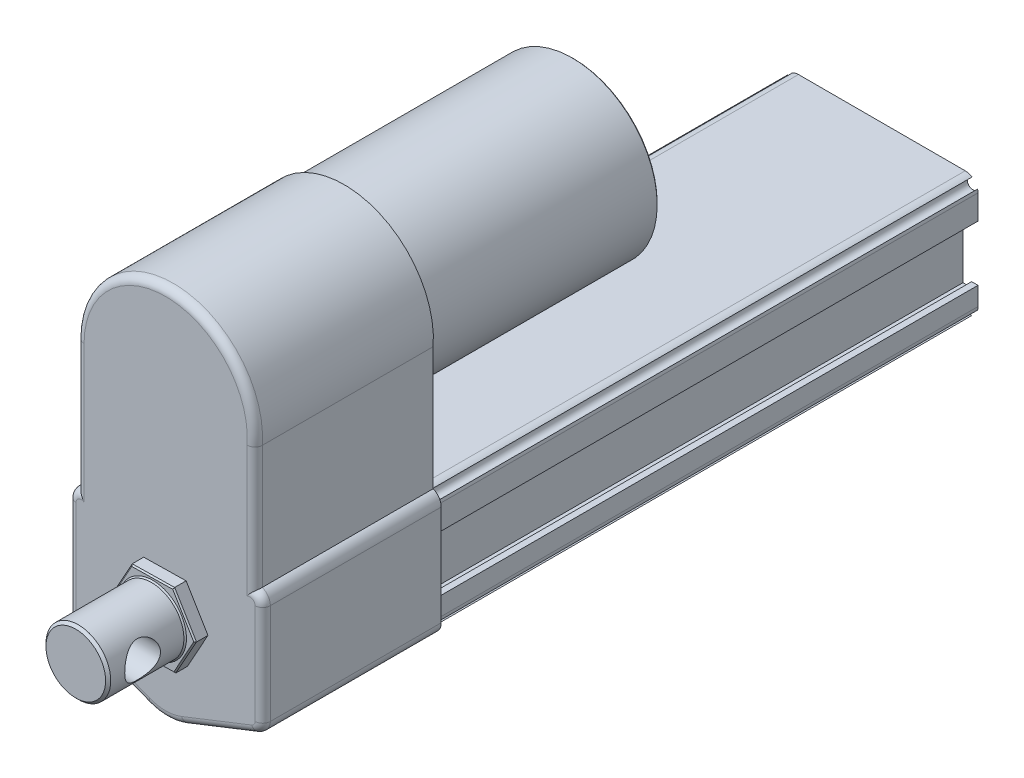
ISO-10303-21;
HEADER;
FILE_DESCRIPTION(('STEP AP214'),'2;1');
FILE_NAME('part.step','',(''),(''),'','','');
FILE_SCHEMA(('AUTOMOTIVE_DESIGN { 1 0 10303 214 1 1 1 1 }'));
ENDSEC;
DATA;
#1=APPLICATION_CONTEXT('core data for automotive mechanical design processes');
#2=APPLICATION_PROTOCOL_DEFINITION('international standard','automotive_design',2000,#1);
#3=PRODUCT_CONTEXT('',#1,'mechanical');
#4=PRODUCT('Part','Part','',(#3));
#5=PRODUCT_RELATED_PRODUCT_CATEGORY('part','',(#4));
#6=PRODUCT_DEFINITION_FORMATION('','',#4);
#7=PRODUCT_DEFINITION_CONTEXT('part definition',#1,'design');
#8=PRODUCT_DEFINITION('design','',#6,#7);
#9=PRODUCT_DEFINITION_SHAPE('','',#8);
#10=(LENGTH_UNIT() NAMED_UNIT(*) SI_UNIT(.MILLI.,.METRE.));
#11=(NAMED_UNIT(*) PLANE_ANGLE_UNIT() SI_UNIT($,.RADIAN.));
#12=(NAMED_UNIT(*) SI_UNIT($,.STERADIAN.) SOLID_ANGLE_UNIT());
#13=UNCERTAINTY_MEASURE_WITH_UNIT(LENGTH_MEASURE(1.E-05),#10,'distance_accuracy_value','');
#14=(GEOMETRIC_REPRESENTATION_CONTEXT(3) GLOBAL_UNCERTAINTY_ASSIGNED_CONTEXT((#13)) GLOBAL_UNIT_ASSIGNED_CONTEXT((#10,
#11,#12)) REPRESENTATION_CONTEXT('',''));
#15=CARTESIAN_POINT('',(0.,0.,0.));
#16=DIRECTION('',(0.,0.,1.));
#17=DIRECTION('',(1.,0.,0.));
#18=AXIS2_PLACEMENT_3D('',#15,#16,#17);
#19=CARTESIAN_POINT('',(0.0340091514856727,-16.605810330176,0.));
#20=DIRECTION('',(0.,0.,-1.));
#21=DIRECTION('',(-1.,0.,0.));
#22=AXIS2_PLACEMENT_3D('',#19,#20,#21);
#23=PLANE('',#22);
#24=DIRECTION('',(0.,1.,0.));
#25=VECTOR('',#24,1.);
#26=CARTESIAN_POINT('',(-35.6,-13.2,0.));
#27=LINE('',#26,#25);
#28=CARTESIAN_POINT('',(-35.6,-13.2,0.));
#29=VERTEX_POINT('',#28);
#30=CARTESIAN_POINT('',(-35.6,-11.1354707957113,0.));
#31=VERTEX_POINT('',#30);
#32=EDGE_CURVE('E564',#29,#31,#27,.T.);
#33=ORIENTED_EDGE('',*,*,#32,.T.);
#34=DIRECTION('',(1.,0.,0.));
#35=VECTOR('',#34,1.);
#36=CARTESIAN_POINT('',(-38.1,-11.1354707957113,0.));
#37=LINE('',#36,#35);
#38=CARTESIAN_POINT('',(-38.1,-11.1354707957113,0.));
#39=VERTEX_POINT('',#38);
#40=EDGE_CURVE('E567',#39,#31,#37,.T.);
#41=ORIENTED_EDGE('',*,*,#40,.F.);
#42=DIRECTION('',(0.,-1.,0.));
#43=VECTOR('',#42,1.);
#44=CARTESIAN_POINT('',(-38.1,19.5930533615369,0.));
#45=LINE('',#44,#43);
#46=CARTESIAN_POINT('',(-38.1,10.6645292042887,0.));
#47=VERTEX_POINT('',#46);
#48=EDGE_CURVE('E1068',#47,#39,#45,.T.);
#49=ORIENTED_EDGE('',*,*,#48,.F.);
#50=DIRECTION('',(-1.,0.,0.));
#51=VECTOR('',#50,1.);
#52=CARTESIAN_POINT('',(-35.6,10.6645292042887,0.));
#53=LINE('',#52,#51);
#54=CARTESIAN_POINT('',(-35.6,10.6645292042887,0.));
#55=VERTEX_POINT('',#54);
#56=EDGE_CURVE('E554',#55,#47,#53,.T.);
#57=ORIENTED_EDGE('',*,*,#56,.F.);
#58=DIRECTION('',(0.,-1.,0.));
#59=VECTOR('',#58,1.);
#60=CARTESIAN_POINT('',(-35.6,13.2,0.));
#61=LINE('',#60,#59);
#62=CARTESIAN_POINT('',(-35.6,13.2,0.));
#63=VERTEX_POINT('',#62);
#64=EDGE_CURVE('E556',#63,#55,#61,.T.);
#65=ORIENTED_EDGE('',*,*,#64,.F.);
#66=DIRECTION('',(-1.,0.,0.));
#67=VECTOR('',#66,1.);
#68=CARTESIAN_POINT('',(-32.2,13.2,0.));
#69=LINE('',#68,#67);
#70=CARTESIAN_POINT('',(-32.2,13.2,0.));
#71=VERTEX_POINT('',#70);
#72=EDGE_CURVE('E558',#71,#63,#69,.T.);
#73=ORIENTED_EDGE('',*,*,#72,.F.);
#74=DIRECTION('',(0.,1.,0.));
#75=VECTOR('',#74,1.);
#76=CARTESIAN_POINT('',(-32.2,-13.2,0.));
#77=LINE('',#76,#75);
#78=CARTESIAN_POINT('',(-32.2,-13.2,0.));
#79=VERTEX_POINT('',#78);
#80=EDGE_CURVE('E560',#79,#71,#77,.T.);
#81=ORIENTED_EDGE('',*,*,#80,.F.);
#82=DIRECTION('',(1.,0.,0.));
#83=VECTOR('',#82,1.);
#84=CARTESIAN_POINT('',(-35.6,-13.2,0.));
#85=LINE('',#84,#83);
#86=EDGE_CURVE('E562',#29,#79,#85,.T.);
#87=ORIENTED_EDGE('',*,*,#86,.F.);
#88=EDGE_LOOP('',(#33,#41,#49,#57,#65,#73,#81,#87));
#89=FACE_BOUND('',#88,.T.);
#90=ADVANCED_FACE('F28',(#89),#23,.T.);
#91=CARTESIAN_POINT('',(0.0421061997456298,75.1,0.));
#92=DIRECTION('',(0.,0.,-1.));
#93=DIRECTION('',(-1.,0.,0.));
#94=AXIS2_PLACEMENT_3D('',#91,#92,#93);
#95=CIRCLE('',#94,33.25);
#96=CARTESIAN_POINT('',(33.2921061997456,75.1,0.));
#97=VERTEX_POINT('',#96);
#98=EDGE_CURVE('E870',#97,#97,#95,.T.);
#99=ORIENTED_EDGE('',*,*,#98,.F.);
#100=EDGE_LOOP('',(#99));
#101=FACE_BOUND('',#100,.T.);
#102=DIRECTION('',(-1.,0.,0.));
#103=VECTOR('',#102,1.);
#104=CARTESIAN_POINT('',(32.2972300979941,25.2548863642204,0.));
#105=LINE('',#104,#103);
#106=CARTESIAN_POINT('',(32.2972300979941,25.2548863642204,0.));
#107=VERTEX_POINT('',#106);
#108=CARTESIAN_POINT('',(-33.1,25.2548863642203,0.));
#109=VERTEX_POINT('',#108);
#110=EDGE_CURVE('E537',#107,#109,#105,.T.);
#111=ORIENTED_EDGE('',*,*,#110,.T.);
#112=CARTESIAN_POINT('',(-33.1,20.2548863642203,0.));
#113=DIRECTION('',(0.,0.,-1.));
#114=DIRECTION('',(-1.,0.,0.));
#115=AXIS2_PLACEMENT_3D('',#112,#113,#114);
#116=CIRCLE('',#115,5.);
#117=CARTESIAN_POINT('',(-34.9578938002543,24.8968935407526,0.));
#118=VERTEX_POINT('',#117);
#119=EDGE_CURVE('E540',#118,#109,#116,.T.);
#120=ORIENTED_EDGE('',*,*,#119,.F.);
#121=DIRECTION('',(0.,1.,0.));
#122=VECTOR('',#121,1.);
#123=CARTESIAN_POINT('',(-34.9578938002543,24.2350605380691,0.));
#124=LINE('',#123,#122);
#125=CARTESIAN_POINT('',(-34.9578938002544,75.1,0.));
#126=VERTEX_POINT('',#125);
#127=EDGE_CURVE('E1076',#118,#126,#124,.T.);
#128=ORIENTED_EDGE('',*,*,#127,.T.);
#129=CARTESIAN_POINT('',(0.0421061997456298,75.1,0.));
#130=DIRECTION('',(0.,0.,1.));
#131=DIRECTION('',(1.,0.,0.));
#132=AXIS2_PLACEMENT_3D('',#129,#130,#131);
#133=CIRCLE('',#132,35.);
#134=CARTESIAN_POINT('',(34.9446403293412,72.4898062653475,0.));
#135=VERTEX_POINT('',#134);
#136=EDGE_CURVE('E1084',#135,#126,#133,.T.);
#137=ORIENTED_EDGE('',*,*,#136,.F.);
#138=DIRECTION('',(-0.000222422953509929,0.999999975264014,0.));
#139=VECTOR('',#138,1.);
#140=CARTESIAN_POINT('',(34.9553685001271,24.2566075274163,0.));
#141=LINE('',#140,#139);
#142=CARTESIAN_POINT('',(34.9553166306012,24.4898097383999,0.));
#143=VERTEX_POINT('',#142);
#144=EDGE_CURVE('E1087',#143,#135,#141,.T.);
#145=ORIENTED_EDGE('',*,*,#144,.F.);
#146=CARTESIAN_POINT('',(32.2972300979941,20.2548863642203,0.));
#147=DIRECTION('',(0.,0.,1.));
#148=DIRECTION('',(1.,0.,0.));
#149=AXIS2_PLACEMENT_3D('',#146,#147,#148);
#150=CIRCLE('',#149,5.);
#151=EDGE_CURVE('E522',#143,#107,#150,.T.);
#152=ORIENTED_EDGE('',*,*,#151,.T.);
#153=EDGE_LOOP('',(#111,#120,#128,#137,#145,#152));
#154=FACE_BOUND('',#153,.T.);
#155=ADVANCED_FACE('F1043',(#101,#154),#23,.T.);
#156=CARTESIAN_POINT('',(-35.1,22.610153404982,0.));
#157=DIRECTION('',(0.,0.,-1.));
#158=DIRECTION('',(-1.,0.,0.));
#159=AXIS2_PLACEMENT_3D('',#156,#157,#158);
#160=CIRCLE('',#159,2.1);
#161=CARTESIAN_POINT('',(-34.9578938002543,24.7053397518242,0.));
#162=VERTEX_POINT('',#161);
#163=CARTESIAN_POINT('',(-37.1947900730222,22.4623205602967,0.));
#164=VERTEX_POINT('',#163);
#165=EDGE_CURVE('E549',#162,#164,#160,.T.);
#166=ORIENTED_EDGE('',*,*,#165,.T.);
#167=CARTESIAN_POINT('',(-33.1,19.5930533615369,0.));
#168=DIRECTION('',(0.,0.,1.));
#169=DIRECTION('',(1.,0.,0.));
#170=AXIS2_PLACEMENT_3D('',#167,#168,#169);
#171=CIRCLE('',#170,5.);
#172=CARTESIAN_POINT('',(-34.9578938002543,24.2350605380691,0.));
#173=VERTEX_POINT('',#172);
#174=EDGE_CURVE('E1072',#173,#164,#171,.T.);
#175=ORIENTED_EDGE('',*,*,#174,.F.);
#176=EDGE_CURVE('E1081',#173,#162,#124,.T.);
#177=ORIENTED_EDGE('',*,*,#176,.T.);
#178=EDGE_LOOP('',(#166,#175,#177));
#179=FACE_BOUND('',#178,.T.);
#180=ADVANCED_FACE('F994',(#179),#23,.T.);
#181=CARTESIAN_POINT('',(-33.1,-18.3484101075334,0.));
#182=DIRECTION('',(0.,0.,1.));
#183=DIRECTION('',(1.,0.,0.));
#184=AXIS2_PLACEMENT_3D('',#181,#182,#183);
#185=CIRCLE('',#184,5.);
#186=CARTESIAN_POINT('',(-38.1,-18.3484101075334,0.));
#187=VERTEX_POINT('',#186);
#188=CARTESIAN_POINT('',(-37.4766093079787,-20.7661137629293,0.));
#189=VERTEX_POINT('',#188);
#190=EDGE_CURVE('E43',#187,#189,#185,.T.);
#191=ORIENTED_EDGE('',*,*,#190,.T.);
#192=CARTESIAN_POINT('',(-35.4157657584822,-20.3624754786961,0.));
#193=DIRECTION('',(0.,0.,-1.));
#194=DIRECTION('',(-1.,0.,0.));
#195=AXIS2_PLACEMENT_3D('',#192,#193,#194);
#196=CIRCLE('',#195,2.1);
#197=CARTESIAN_POINT('',(-36.1013128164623,-22.3474251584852,0.));
#198=VERTEX_POINT('',#197);
#199=EDGE_CURVE('E571',#189,#198,#196,.T.);
#200=ORIENTED_EDGE('',*,*,#199,.T.);
#201=CARTESIAN_POINT('',(-33.1,-18.3484101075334,0.));
#202=DIRECTION('',(0.,0.,1.));
#203=DIRECTION('',(1.,0.,0.));
#204=AXIS2_PLACEMENT_3D('',#201,#202,#203);
#205=CIRCLE('',#204,5.);
#206=CARTESIAN_POINT('',(-33.1,-23.3484101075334,0.));
#207=VERTEX_POINT('',#206);
#208=EDGE_CURVE('E574',#198,#207,#205,.T.);
#209=ORIENTED_EDGE('',*,*,#208,.T.);
#210=DIRECTION('',(1.,0.,0.));
#211=VECTOR('',#210,1.);
#212=CARTESIAN_POINT('',(-33.1,-23.3484101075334,0.));
#213=LINE('',#212,#211);
#214=CARTESIAN_POINT('',(-18.6130825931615,-23.3484101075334,0.));
#215=VERTEX_POINT('',#214);
#216=EDGE_CURVE('E577',#207,#215,#213,.T.);
#217=ORIENTED_EDGE('',*,*,#216,.T.);
#218=CARTESIAN_POINT('',(-18.6130825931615,-26.3484101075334,0.));
#219=DIRECTION('',(0.,0.,-1.));
#220=DIRECTION('',(-1.,0.,0.));
#221=AXIS2_PLACEMENT_3D('',#218,#219,#220);
#222=CIRCLE('',#221,3.);
#223=CARTESIAN_POINT('',(-15.8543479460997,-25.1696891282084,0.));
#224=VERTEX_POINT('',#223);
#225=EDGE_CURVE('E580',#215,#224,#222,.T.);
#226=ORIENTED_EDGE('',*,*,#225,.T.);
#227=DIRECTION('',(0.392906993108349,-0.919578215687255,0.));
#228=VECTOR('',#227,1.);
#229=CARTESIAN_POINT('',(-15.8543479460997,-25.1696891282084,0.));
#230=LINE('',#229,#228);
#231=CARTESIAN_POINT('',(-13.2,-31.382051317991,0.));
#232=VERTEX_POINT('',#231);
#233=EDGE_CURVE('E583',#224,#232,#230,.T.);
#234=ORIENTED_EDGE('',*,*,#233,.T.);
#235=DIRECTION('',(-1.,0.,0.));
#236=VECTOR('',#235,1.);
#237=CARTESIAN_POINT('',(-10.6966655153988,-31.382051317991,0.));
#238=LINE('',#237,#236);
#239=CARTESIAN_POINT('',(-10.6966655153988,-31.382051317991,0.));
#240=VERTEX_POINT('',#239);
#241=EDGE_CURVE('E586',#240,#232,#238,.T.);
#242=ORIENTED_EDGE('',*,*,#241,.F.);
#243=DIRECTION('',(2.32809448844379E-13,-1.,0.));
#244=VECTOR('',#243,1.);
#245=CARTESIAN_POINT('',(-10.6966655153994,-28.9603921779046,0.));
#246=LINE('',#245,#244);
#247=CARTESIAN_POINT('',(-10.6966655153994,-28.9603921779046,0.));
#248=VERTEX_POINT('',#247);
#249=EDGE_CURVE('E589',#248,#240,#246,.T.);
#250=ORIENTED_EDGE('',*,*,#249,.F.);
#251=DIRECTION('',(1.,0.,0.));
#252=VECTOR('',#251,1.);
#253=CARTESIAN_POINT('',(-13.2,-28.9603921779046,0.));
#254=LINE('',#253,#252);
#255=CARTESIAN_POINT('',(-13.2,-28.9603921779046,0.));
#256=VERTEX_POINT('',#255);
#257=EDGE_CURVE('E591',#256,#248,#254,.T.);
#258=ORIENTED_EDGE('',*,*,#257,.F.);
#259=DIRECTION('',(0.,-1.,0.));
#260=VECTOR('',#259,1.);
#261=CARTESIAN_POINT('',(-13.2,-25.5603921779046,0.));
#262=LINE('',#261,#260);
#263=CARTESIAN_POINT('',(-13.2,-25.5603921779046,0.));
#264=VERTEX_POINT('',#263);
#265=EDGE_CURVE('E593',#264,#256,#262,.T.);
#266=ORIENTED_EDGE('',*,*,#265,.F.);
#267=DIRECTION('',(-1.,0.,0.));
#268=VECTOR('',#267,1.);
#269=CARTESIAN_POINT('',(13.2,-25.5603921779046,0.));
#270=LINE('',#269,#268);
#271=CARTESIAN_POINT('',(13.2,-25.5603921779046,0.));
#272=VERTEX_POINT('',#271);
#273=EDGE_CURVE('E595',#272,#264,#270,.T.);
#274=ORIENTED_EDGE('',*,*,#273,.F.);
#275=DIRECTION('',(0.,1.,0.));
#276=VECTOR('',#275,1.);
#277=CARTESIAN_POINT('',(13.2,-28.9603921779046,0.));
#278=LINE('',#277,#276);
#279=CARTESIAN_POINT('',(13.2,-28.9603921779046,0.));
#280=VERTEX_POINT('',#279);
#281=EDGE_CURVE('E597',#280,#272,#278,.T.);
#282=ORIENTED_EDGE('',*,*,#281,.F.);
#283=DIRECTION('',(1.,0.,0.));
#284=VECTOR('',#283,1.);
#285=CARTESIAN_POINT('',(11.1033344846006,-28.9603921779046,0.));
#286=LINE('',#285,#284);
#287=CARTESIAN_POINT('',(11.1033344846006,-28.9603921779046,0.));
#288=VERTEX_POINT('',#287);
#289=EDGE_CURVE('E599',#288,#280,#286,.T.);
#290=ORIENTED_EDGE('',*,*,#289,.F.);
#291=DIRECTION('',(2.23497070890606E-13,-1.,0.));
#292=VECTOR('',#291,1.);
#293=CARTESIAN_POINT('',(11.1033344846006,-28.9603921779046,0.));
#294=LINE('',#293,#292);
#295=CARTESIAN_POINT('',(11.1033344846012,-31.3820513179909,0.));
#296=VERTEX_POINT('',#295);
#297=EDGE_CURVE('E601',#288,#296,#294,.T.);
#298=ORIENTED_EDGE('',*,*,#297,.T.);
#299=DIRECTION('',(-1.,0.,0.));
#300=VECTOR('',#299,1.);
#301=CARTESIAN_POINT('',(14.6339781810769,-31.3820513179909,0.));
#302=LINE('',#301,#300);
#303=CARTESIAN_POINT('',(14.6339781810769,-31.3820513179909,0.));
#304=VERTEX_POINT('',#303);
#305=EDGE_CURVE('E604',#304,#296,#302,.T.);
#306=ORIENTED_EDGE('',*,*,#305,.F.);
#307=DIRECTION('',(-0.2414139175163,-0.970422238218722,0.));
#308=VECTOR('',#307,1.);
#309=CARTESIAN_POINT('',(16.0663784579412,-25.6241683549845,0.));
#310=LINE('',#309,#308);
#311=CARTESIAN_POINT('',(16.0663784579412,-25.6241683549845,0.));
#312=VERTEX_POINT('',#311);
#313=EDGE_CURVE('E607',#312,#304,#310,.T.);
#314=ORIENTED_EDGE('',*,*,#313,.F.);
#315=CARTESIAN_POINT('',(18.9776451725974,-26.3484101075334,0.));
#316=DIRECTION('',(0.,0.,1.));
#317=DIRECTION('',(1.,0.,0.));
#318=AXIS2_PLACEMENT_3D('',#315,#316,#317);
#319=CIRCLE('',#318,3.);
#320=CARTESIAN_POINT('',(18.9776451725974,-23.3484101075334,0.));
#321=VERTEX_POINT('',#320);
#322=EDGE_CURVE('E609',#321,#312,#319,.T.);
#323=ORIENTED_EDGE('',*,*,#322,.F.);
#324=DIRECTION('',(1.,0.,0.));
#325=VECTOR('',#324,1.);
#326=CARTESIAN_POINT('',(18.9776451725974,-23.3484101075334,0.));
#327=LINE('',#326,#325);
#328=CARTESIAN_POINT('',(32.2972300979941,-23.3484101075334,0.));
#329=VERTEX_POINT('',#328);
#330=EDGE_CURVE('E611',#321,#329,#327,.T.);
#331=ORIENTED_EDGE('',*,*,#330,.T.);
#332=CARTESIAN_POINT('',(32.2972300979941,-18.3484101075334,0.));
#333=DIRECTION('',(0.,0.,1.));
#334=DIRECTION('',(1.,0.,0.));
#335=AXIS2_PLACEMENT_3D('',#332,#333,#334);
#336=CIRCLE('',#335,5.);
#337=CARTESIAN_POINT('',(34.8093713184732,-22.6715046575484,0.));
#338=VERTEX_POINT('',#337);
#339=EDGE_CURVE('E614',#329,#338,#336,.T.);
#340=ORIENTED_EDGE('',*,*,#339,.T.);
#341=CARTESIAN_POINT('',(35.2456396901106,-20.6173211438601,0.));
#342=DIRECTION('',(0.,0.,-1.));
#343=DIRECTION('',(-1.,0.,0.));
#344=AXIS2_PLACEMENT_3D('',#341,#342,#343);
#345=CIRCLE('',#344,2.1);
#346=CARTESIAN_POINT('',(37.1195557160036,-19.6694610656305,0.));
#347=VERTEX_POINT('',#346);
#348=EDGE_CURVE('E617',#338,#347,#345,.T.);
#349=ORIENTED_EDGE('',*,*,#348,.T.);
#350=CARTESIAN_POINT('',(32.2972300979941,-18.3484101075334,0.));
#351=DIRECTION('',(0.,0.,1.));
#352=DIRECTION('',(1.,0.,0.));
#353=AXIS2_PLACEMENT_3D('',#350,#351,#352);
#354=CIRCLE('',#353,5.);
#355=CARTESIAN_POINT('',(37.2972300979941,-18.3484101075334,0.));
#356=VERTEX_POINT('',#355);
#357=EDGE_CURVE('E620',#347,#356,#354,.T.);
#358=ORIENTED_EDGE('',*,*,#357,.T.);
#359=DIRECTION('',(0.,-1.,0.));
#360=VECTOR('',#359,1.);
#361=CARTESIAN_POINT('',(37.2972300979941,-11.1354707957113,0.));
#362=LINE('',#361,#360);
#363=CARTESIAN_POINT('',(37.2972300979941,-11.1354707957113,0.));
#364=VERTEX_POINT('',#363);
#365=EDGE_CURVE('E623',#364,#356,#362,.T.);
#366=ORIENTED_EDGE('',*,*,#365,.F.);
#367=DIRECTION('',(1.,0.,0.));
#368=VECTOR('',#367,1.);
#369=CARTESIAN_POINT('',(34.7972300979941,-11.1354707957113,0.));
#370=LINE('',#369,#368);
#371=CARTESIAN_POINT('',(34.7972300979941,-11.1354707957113,0.));
#372=VERTEX_POINT('',#371);
#373=EDGE_CURVE('E626',#372,#364,#370,.T.);
#374=ORIENTED_EDGE('',*,*,#373,.F.);
#375=DIRECTION('',(0.,1.,0.));
#376=VECTOR('',#375,1.);
#377=CARTESIAN_POINT('',(34.7972300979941,-13.2,0.));
#378=LINE('',#377,#376);
#379=CARTESIAN_POINT('',(34.7972300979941,-13.2,0.));
#380=VERTEX_POINT('',#379);
#381=EDGE_CURVE('E628',#380,#372,#378,.T.);
#382=ORIENTED_EDGE('',*,*,#381,.F.);
#383=DIRECTION('',(1.,0.,0.));
#384=VECTOR('',#383,1.);
#385=CARTESIAN_POINT('',(31.3972300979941,-13.2,0.));
#386=LINE('',#385,#384);
#387=CARTESIAN_POINT('',(31.3972300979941,-13.2,0.));
#388=VERTEX_POINT('',#387);
#389=EDGE_CURVE('E630',#388,#380,#386,.T.);
#390=ORIENTED_EDGE('',*,*,#389,.F.);
#391=DIRECTION('',(0.,-1.,0.));
#392=VECTOR('',#391,1.);
#393=CARTESIAN_POINT('',(31.3972300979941,13.2,0.));
#394=LINE('',#393,#392);
#395=CARTESIAN_POINT('',(31.3972300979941,13.2,0.));
#396=VERTEX_POINT('',#395);
#397=EDGE_CURVE('E632',#396,#388,#394,.T.);
#398=ORIENTED_EDGE('',*,*,#397,.F.);
#399=DIRECTION('',(-1.,0.,0.));
#400=VECTOR('',#399,1.);
#401=CARTESIAN_POINT('',(34.7972300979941,13.2,0.));
#402=LINE('',#401,#400);
#403=CARTESIAN_POINT('',(34.7972300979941,13.2,0.));
#404=VERTEX_POINT('',#403);
#405=EDGE_CURVE('E634',#404,#396,#402,.T.);
#406=ORIENTED_EDGE('',*,*,#405,.F.);
#407=DIRECTION('',(0.,1.,0.));
#408=VECTOR('',#407,1.);
#409=CARTESIAN_POINT('',(34.7972300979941,10.6645292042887,0.));
#410=LINE('',#409,#408);
#411=CARTESIAN_POINT('',(34.7972300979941,10.6645292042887,0.));
#412=VERTEX_POINT('',#411);
#413=EDGE_CURVE('E636',#412,#404,#410,.T.);
#414=ORIENTED_EDGE('',*,*,#413,.F.);
#415=DIRECTION('',(-1.,0.,0.));
#416=VECTOR('',#415,1.);
#417=CARTESIAN_POINT('',(37.2972300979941,10.6645292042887,0.));
#418=LINE('',#417,#416);
#419=CARTESIAN_POINT('',(37.2972300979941,10.6645292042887,0.));
#420=VERTEX_POINT('',#419);
#421=EDGE_CURVE('E638',#420,#412,#418,.T.);
#422=ORIENTED_EDGE('',*,*,#421,.F.);
#423=DIRECTION('',(0.,-1.,0.));
#424=VECTOR('',#423,1.);
#425=CARTESIAN_POINT('',(37.2972300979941,20.2548863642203,0.));
#426=LINE('',#425,#424);
#427=CARTESIAN_POINT('',(37.2972300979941,20.2548863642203,0.));
#428=VERTEX_POINT('',#427);
#429=EDGE_CURVE('E526',#428,#420,#426,.T.);
#430=ORIENTED_EDGE('',*,*,#429,.F.);
#431=CARTESIAN_POINT('',(32.2972300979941,20.2548863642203,0.));
#432=DIRECTION('',(0.,0.,1.));
#433=DIRECTION('',(1.,0.,0.));
#434=AXIS2_PLACEMENT_3D('',#431,#432,#433);
#435=CIRCLE('',#434,5.00000000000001);
#436=CARTESIAN_POINT('',(37.1413192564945,21.4937569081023,0.));
#437=VERTEX_POINT('',#436);
#438=EDGE_CURVE('E503',#428,#437,#435,.T.);
#439=ORIENTED_EDGE('',*,*,#438,.T.);
#440=CARTESIAN_POINT('',(35.2456396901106,22.3973049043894,0.));
#441=DIRECTION('',(0.,0.,-1.));
#442=DIRECTION('',(-1.,0.,0.));
#443=AXIS2_PLACEMENT_3D('',#440,#441,#442);
#444=CIRCLE('',#443,2.1);
#445=CARTESIAN_POINT('',(34.9553194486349,24.4771400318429,0.));
#446=VERTEX_POINT('',#445);
#447=EDGE_CURVE('E515',#437,#446,#444,.T.);
#448=ORIENTED_EDGE('',*,*,#447,.T.);
#449=CARTESIAN_POINT('',(34.9553685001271,24.2566075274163,0.));
#450=VERTEX_POINT('',#449);
#451=EDGE_CURVE('E1088',#450,#446,#141,.T.);
#452=ORIENTED_EDGE('',*,*,#451,.F.);
#453=CARTESIAN_POINT('',(33.1,19.6135904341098,0.));
#454=DIRECTION('',(0.,0.,1.));
#455=DIRECTION('',(1.,0.,0.));
#456=AXIS2_PLACEMENT_3D('',#453,#454,#455);
#457=CIRCLE('',#456,5.);
#458=CARTESIAN_POINT('',(38.1,19.6135904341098,0.));
#459=VERTEX_POINT('',#458);
#460=EDGE_CURVE('E1090',#459,#450,#457,.T.);
#461=ORIENTED_EDGE('',*,*,#460,.F.);
#462=DIRECTION('',(0.,1.,0.));
#463=VECTOR('',#462,1.);
#464=CARTESIAN_POINT('',(38.1,-19.6963365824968,0.));
#465=LINE('',#464,#463);
#466=CARTESIAN_POINT('',(38.1,-19.6963365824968,0.));
#467=VERTEX_POINT('',#466);
#468=EDGE_CURVE('E1093',#467,#459,#465,.T.);
#469=ORIENTED_EDGE('',*,*,#468,.F.);
#470=CARTESIAN_POINT('',(33.1,-19.6963365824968,0.));
#471=DIRECTION('',(0.,0.,-1.));
#472=DIRECTION('',(-1.,0.,0.));
#473=AXIS2_PLACEMENT_3D('',#470,#471,#472);
#474=CIRCLE('',#473,5.);
#475=CARTESIAN_POINT('',(34.9334157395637,-24.3480660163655,0.));
#476=VERTEX_POINT('',#475);
#477=EDGE_CURVE('E1096',#467,#476,#474,.T.);
#478=ORIENTED_EDGE('',*,*,#477,.T.);
#479=DIRECTION('',(0.930345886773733,0.36668314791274,0.));
#480=VECTOR('',#479,1.);
#481=CARTESIAN_POINT('',(7.36767210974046,-35.2127280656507,0.));
#482=LINE('',#481,#480);
#483=CARTESIAN_POINT('',(7.36767210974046,-35.2127280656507,0.));
#484=VERTEX_POINT('',#483);
#485=EDGE_CURVE('E1099',#484,#476,#482,.T.);
#486=ORIENTED_EDGE('',*,*,#485,.F.);
#487=CARTESIAN_POINT('',(0.0340091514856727,-16.605810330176,0.));
#488=DIRECTION('',(0.,0.,-1.));
#489=DIRECTION('',(-1.,0.,0.));
#490=AXIS2_PLACEMENT_3D('',#487,#488,#489);
#491=CIRCLE('',#490,20.);
#492=CARTESIAN_POINT('',(-7.28563295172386,-35.2182480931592,0.));
#493=VERTEX_POINT('',#492);
#494=EDGE_CURVE('E985',#484,#493,#491,.T.);
#495=ORIENTED_EDGE('',*,*,#494,.T.);
#496=DIRECTION('',(0.930621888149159,-0.365982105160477,0.));
#497=VECTOR('',#496,1.);
#498=CARTESIAN_POINT('',(-34.9299105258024,-24.3466889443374,0.));
#499=LINE('',#498,#497);
#500=CARTESIAN_POINT('',(-34.9299105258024,-24.3466889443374,0.));
#501=VERTEX_POINT('',#500);
#502=EDGE_CURVE('E1826',#501,#493,#499,.T.);
#503=ORIENTED_EDGE('',*,*,#502,.F.);
#504=CARTESIAN_POINT('',(-33.1,-19.6935795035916,0.));
#505=DIRECTION('',(0.,0.,-1.));
#506=DIRECTION('',(-1.,0.,0.));
#507=AXIS2_PLACEMENT_3D('',#504,#505,#506);
#508=CIRCLE('',#507,5.);
#509=CARTESIAN_POINT('',(-38.1,-19.6935795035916,0.));
#510=VERTEX_POINT('',#509);
#511=EDGE_CURVE('E1078',#501,#510,#508,.T.);
#512=ORIENTED_EDGE('',*,*,#511,.T.);
#513=EDGE_CURVE('E1073',#187,#510,#45,.T.);
#514=ORIENTED_EDGE('',*,*,#513,.F.);
#515=EDGE_LOOP('',(#191,#200,#209,#217,#226,#234,#242,#250,#258,#266,#274,#282,#290,#298,#306,
#314,#323,#331,#340,#349,#358,#366,#374,#382,#390,#398,#406,#414,#422,#430,#439,#448,#452,#461,
#469,#478,#486,#495,#503,#512,#514));
#516=FACE_BOUND('',#515,.T.);
#517=ADVANCED_FACE('F524',(#516),#23,.T.);
#518=CARTESIAN_POINT('',(0.0340091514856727,-16.605810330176,70.));
#519=DIRECTION('',(0.,0.,-1.));
#520=DIRECTION('',(-1.,0.,0.));
#521=AXIS2_PLACEMENT_3D('',#518,#519,#520);
#522=PLANE('',#521);
#523=CARTESIAN_POINT('',(-33.1,-19.6935795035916,70.));
#524=DIRECTION('',(0.,0.,-1.));
#525=DIRECTION('',(-1.,0.,0.));
#526=AXIS2_PLACEMENT_3D('',#523,#524,#525);
#527=CIRCLE('',#526,2.);
#528=CARTESIAN_POINT('',(-35.1,-19.6935795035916,70.));
#529=VERTEX_POINT('',#528);
#530=CARTESIAN_POINT('',(-33.831964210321,-21.5548232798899,70.));
#531=VERTEX_POINT('',#530);
#532=EDGE_CURVE('E1150',#529,#531,#527,.F.);
#533=ORIENTED_EDGE('',*,*,#532,.T.);
#534=DIRECTION('',(0.930621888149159,-0.365982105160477,0.));
#535=VECTOR('',#534,1.);
#536=CARTESIAN_POINT('',(-6.18768663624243,-32.4263824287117,70.));
#537=LINE('',#536,#535);
#538=CARTESIAN_POINT('',(-6.18768663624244,-32.4263824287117,70.));
#539=VERTEX_POINT('',#538);
#540=EDGE_CURVE('E1152',#531,#539,#537,.T.);
#541=ORIENTED_EDGE('',*,*,#540,.T.);
#542=CARTESIAN_POINT('',(0.0340091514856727,-16.605810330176,70.));
#543=DIRECTION('',(0.,0.,-1.));
#544=DIRECTION('',(-1.,0.,0.));
#545=AXIS2_PLACEMENT_3D('',#542,#543,#544);
#546=CIRCLE('',#545,17.);
#547=CARTESIAN_POINT('',(6.26762266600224,-32.4216904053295,70.));
#548=VERTEX_POINT('',#547);
#549=EDGE_CURVE('E1105',#539,#548,#546,.F.);
#550=ORIENTED_EDGE('',*,*,#549,.T.);
#551=DIRECTION('',(0.930345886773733,0.36668314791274,0.));
#552=VECTOR('',#551,1.);
#553=CARTESIAN_POINT('',(6.26762266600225,-32.4216904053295,70.));
#554=LINE('',#553,#552);
#555=CARTESIAN_POINT('',(33.8333662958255,-21.5570283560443,70.));
#556=VERTEX_POINT('',#555);
#557=EDGE_CURVE('E1132',#548,#556,#554,.T.);
#558=ORIENTED_EDGE('',*,*,#557,.T.);
#559=CARTESIAN_POINT('',(33.1,-19.6963365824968,70.));
#560=DIRECTION('',(0.,0.,-1.));
#561=DIRECTION('',(-1.,0.,0.));
#562=AXIS2_PLACEMENT_3D('',#559,#560,#561);
#563=CIRCLE('',#562,2.);
#564=CARTESIAN_POINT('',(35.1,-19.6963365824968,70.));
#565=VERTEX_POINT('',#564);
#566=EDGE_CURVE('E1134',#556,#565,#563,.F.);
#567=ORIENTED_EDGE('',*,*,#566,.T.);
#568=DIRECTION('',(0.,1.,0.));
#569=VECTOR('',#568,1.);
#570=CARTESIAN_POINT('',(35.1,-16.605810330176,70.));
#571=LINE('',#570,#569);
#572=CARTESIAN_POINT('',(35.1,19.6135904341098,70.));
#573=VERTEX_POINT('',#572);
#574=EDGE_CURVE('E1136',#565,#573,#571,.T.);
#575=ORIENTED_EDGE('',*,*,#574,.T.);
#576=CARTESIAN_POINT('',(33.1,19.6135904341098,70.));
#577=DIRECTION('',(0.,0.,-1.));
#578=DIRECTION('',(-1.,0.,0.));
#579=AXIS2_PLACEMENT_3D('',#576,#577,#578);
#580=CIRCLE('',#579,2.);
#581=CARTESIAN_POINT('',(31.9560362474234,21.2541229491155,70.));
#582=VERTEX_POINT('',#581);
#583=EDGE_CURVE('E1138',#573,#582,#580,.F.);
#584=ORIENTED_EDGE('',*,*,#583,.T.);
#585=DIRECTION('',(-0.000222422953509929,0.999999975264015,0.));
#586=VECTOR('',#585,1.);
#587=CARTESIAN_POINT('',(31.9644555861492,-16.5987082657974,70.));
#588=LINE('',#587,#586);
#589=CARTESIAN_POINT('',(31.9446148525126,72.6040148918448,70.));
#590=VERTEX_POINT('',#589);
#591=EDGE_CURVE('E1140',#582,#590,#588,.T.);
#592=ORIENTED_EDGE('',*,*,#591,.T.);
#593=CARTESIAN_POINT('',(0.0421061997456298,75.1,70.));
#594=DIRECTION('',(0.,0.,-1.));
#595=DIRECTION('',(-1.,0.,0.));
#596=AXIS2_PLACEMENT_3D('',#593,#594,#595);
#597=CIRCLE('',#596,32.);
#598=CARTESIAN_POINT('',(-31.9578938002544,75.1,70.));
#599=VERTEX_POINT('',#598);
#600=EDGE_CURVE('E1142',#590,#599,#597,.F.);
#601=ORIENTED_EDGE('',*,*,#600,.T.);
#602=DIRECTION('',(0.,1.,0.));
#603=VECTOR('',#602,1.);
#604=CARTESIAN_POINT('',(-31.9578938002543,24.2350605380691,70.));
#605=LINE('',#604,#603);
#606=CARTESIAN_POINT('',(-31.9578938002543,21.2348796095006,70.));
#607=VERTEX_POINT('',#606);
#608=EDGE_CURVE('E1144',#599,#607,#605,.F.);
#609=ORIENTED_EDGE('',*,*,#608,.T.);
#610=CARTESIAN_POINT('',(-33.1,19.5930533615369,70.));
#611=DIRECTION('',(0.,0.,-1.));
#612=DIRECTION('',(-1.,0.,0.));
#613=AXIS2_PLACEMENT_3D('',#610,#611,#612);
#614=CIRCLE('',#613,2.);
#615=CARTESIAN_POINT('',(-35.1,19.5930533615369,70.));
#616=VERTEX_POINT('',#615);
#617=EDGE_CURVE('E1146',#607,#616,#614,.F.);
#618=ORIENTED_EDGE('',*,*,#617,.T.);
#619=DIRECTION('',(0.,-1.,0.));
#620=VECTOR('',#619,1.);
#621=CARTESIAN_POINT('',(-35.1,-16.605810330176,70.));
#622=LINE('',#621,#620);
#623=EDGE_CURVE('E1148',#616,#529,#622,.T.);
#624=ORIENTED_EDGE('',*,*,#623,.T.);
#625=EDGE_LOOP('',(#533,#541,#550,#558,#567,#575,#584,#592,#601,#609,#618,#624));
#626=FACE_BOUND('',#625,.T.);
#627=DIRECTION('',(0.485136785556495,0.874438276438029,0.));
#628=VECTOR('',#627,1.);
#629=CARTESIAN_POINT('',(8.56229749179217,-14.2621390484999,69.9999999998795));
#630=LINE('',#629,#628);
#631=CARTESIAN_POINT('',(8.56229749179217,-14.2621390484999,69.9999999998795));
#632=VERTEX_POINT('',#631);
#633=CARTESIAN_POINT('',(16.632523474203,0.284097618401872,70.));
#634=VERTEX_POINT('',#633);
#635=EDGE_CURVE('E891',#632,#634,#630,.T.);
#636=ORIENTED_EDGE('',*,*,#635,.F.);
#637=DIRECTION('',(0.99985415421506,0.017078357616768,0.));
#638=VECTOR('',#637,1.);
#639=CARTESIAN_POINT('',(-8.07022598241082,-14.5462366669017,69.9999999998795));
#640=LINE('',#639,#638);
#641=CARTESIAN_POINT('',(-8.07022598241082,-14.5462366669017,70.));
#642=VERTEX_POINT('',#641);
#643=EDGE_CURVE('E906',#642,#632,#640,.T.);
#644=ORIENTED_EDGE('',*,*,#643,.F.);
#645=DIRECTION('',(0.514717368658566,-0.857359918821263,0.));
#646=VECTOR('',#645,1.);
#647=CARTESIAN_POINT('',(-16.632523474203,-0.284097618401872,69.9999999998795));
#648=LINE('',#647,#646);
#649=CARTESIAN_POINT('',(-16.632523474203,-0.284097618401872,70.));
#650=VERTEX_POINT('',#649);
#651=EDGE_CURVE('E903',#650,#642,#648,.T.);
#652=ORIENTED_EDGE('',*,*,#651,.F.);
#653=DIRECTION('',(-0.485136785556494,-0.87443827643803,0.));
#654=VECTOR('',#653,1.);
#655=CARTESIAN_POINT('',(-8.56229749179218,14.2621390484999,69.9999999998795));
#656=LINE('',#655,#654);
#657=CARTESIAN_POINT('',(-8.56229749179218,14.2621390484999,70.));
#658=VERTEX_POINT('',#657);
#659=EDGE_CURVE('E900',#658,#650,#656,.T.);
#660=ORIENTED_EDGE('',*,*,#659,.F.);
#661=DIRECTION('',(-0.99985415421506,-0.0170783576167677,0.));
#662=VECTOR('',#661,1.);
#663=CARTESIAN_POINT('',(8.07022598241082,14.5462366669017,69.9999999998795));
#664=LINE('',#663,#662);
#665=CARTESIAN_POINT('',(8.07022598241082,14.5462366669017,70.));
#666=VERTEX_POINT('',#665);
#667=EDGE_CURVE('E897',#666,#658,#664,.T.);
#668=ORIENTED_EDGE('',*,*,#667,.F.);
#669=DIRECTION('',(-0.514717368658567,0.857359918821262,0.));
#670=VECTOR('',#669,1.);
#671=CARTESIAN_POINT('',(16.632523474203,0.284097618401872,69.9999999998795));
#672=LINE('',#671,#670);
#673=EDGE_CURVE('E894',#634,#666,#672,.T.);
#674=ORIENTED_EDGE('',*,*,#673,.F.);
#675=EDGE_LOOP('',(#636,#644,#652,#660,#668,#674));
#676=FACE_BOUND('',#675,.T.);
#677=ADVANCED_FACE('F993',(#626,#676),#522,.F.);
#678=CARTESIAN_POINT('',(0.0340091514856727,-16.605810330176,70.));
#679=DIRECTION('',(0.,0.,-1.));
#680=DIRECTION('',(-1.,0.,0.));
#681=AXIS2_PLACEMENT_3D('',#678,#679,#680);
#682=CYLINDRICAL_SURFACE('',#681,20.);
#683=DIRECTION('',(0.,0.,-1.));
#684=VECTOR('',#683,1.);
#685=CARTESIAN_POINT('',(7.36767210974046,-35.2127280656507,70.));
#686=LINE('',#685,#684);
#687=CARTESIAN_POINT('',(7.36767210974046,-35.2127280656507,67.));
#688=VERTEX_POINT('',#687);
#689=EDGE_CURVE('E1103',#688,#484,#686,.T.);
#690=ORIENTED_EDGE('',*,*,#689,.F.);
#691=CARTESIAN_POINT('',(0.0340091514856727,-16.605810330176,67.));
#692=DIRECTION('',(0.,0.,-1.));
#693=DIRECTION('',(-1.,0.,0.));
#694=AXIS2_PLACEMENT_3D('',#691,#692,#693);
#695=CIRCLE('',#694,20.);
#696=CARTESIAN_POINT('',(-7.28563295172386,-35.2182480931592,67.));
#697=VERTEX_POINT('',#696);
#698=EDGE_CURVE('E1178',#688,#697,#695,.T.);
#699=ORIENTED_EDGE('',*,*,#698,.T.);
#700=DIRECTION('',(0.,0.,-1.));
#701=VECTOR('',#700,1.);
#702=CARTESIAN_POINT('',(-7.28563295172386,-35.2182480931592,70.));
#703=LINE('',#702,#701);
#704=EDGE_CURVE('E1102',#697,#493,#703,.T.);
#705=ORIENTED_EDGE('',*,*,#704,.T.);
#706=ORIENTED_EDGE('',*,*,#494,.F.);
#707=EDGE_LOOP('',(#690,#699,#705,#706));
#708=FACE_BOUND('',#707,.T.);
#709=ADVANCED_FACE('F30',(#708),#682,.T.);
#710=CARTESIAN_POINT('',(7.36767210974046,-35.2127280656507,70.));
#711=DIRECTION('',(-0.36668314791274,0.930345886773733,0.));
#712=DIRECTION('',(-0.930345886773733,-0.36668314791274,0.));
#713=AXIS2_PLACEMENT_3D('',#710,#711,#712);
#714=PLANE('',#713);
#715=DIRECTION('',(0.,0.,-1.));
#716=VECTOR('',#715,1.);
#717=CARTESIAN_POINT('',(34.9334157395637,-24.3480660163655,70.));
#718=LINE('',#717,#716);
#719=CARTESIAN_POINT('',(34.9334157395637,-24.3480660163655,67.));
#720=VERTEX_POINT('',#719);
#721=EDGE_CURVE('E1106',#720,#476,#718,.T.);
#722=ORIENTED_EDGE('',*,*,#721,.F.);
#723=DIRECTION('',(0.930345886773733,0.36668314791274,0.));
#724=VECTOR('',#723,1.);
#725=CARTESIAN_POINT('',(7.36767210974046,-35.2127280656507,67.));
#726=LINE('',#725,#724);
#727=EDGE_CURVE('E1176',#720,#688,#726,.F.);
#728=ORIENTED_EDGE('',*,*,#727,.T.);
#729=ORIENTED_EDGE('',*,*,#689,.T.);
#730=ORIENTED_EDGE('',*,*,#485,.T.);
#731=EDGE_LOOP('',(#722,#728,#729,#730));
#732=FACE_BOUND('',#731,.T.);
#733=ADVANCED_FACE('F998',(#732),#714,.F.);
#734=CARTESIAN_POINT('',(33.1,-19.6963365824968,70.));
#735=DIRECTION('',(0.,0.,-1.));
#736=DIRECTION('',(-1.,0.,0.));
#737=AXIS2_PLACEMENT_3D('',#734,#735,#736);
#738=CYLINDRICAL_SURFACE('',#737,5.);
#739=DIRECTION('',(0.,0.,-1.));
#740=VECTOR('',#739,1.);
#741=CARTESIAN_POINT('',(38.1,-19.6963365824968,70.));
#742=LINE('',#741,#740);
#743=CARTESIAN_POINT('',(38.1,-19.6963365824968,67.));
#744=VERTEX_POINT('',#743);
#745=EDGE_CURVE('E1108',#744,#467,#742,.T.);
#746=ORIENTED_EDGE('',*,*,#745,.F.);
#747=CARTESIAN_POINT('',(33.1,-19.6963365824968,67.));
#748=DIRECTION('',(0.,0.,-1.));
#749=DIRECTION('',(-1.,0.,0.));
#750=AXIS2_PLACEMENT_3D('',#747,#748,#749);
#751=CIRCLE('',#750,5.);
#752=EDGE_CURVE('E1174',#744,#720,#751,.T.);
#753=ORIENTED_EDGE('',*,*,#752,.T.);
#754=ORIENTED_EDGE('',*,*,#721,.T.);
#755=ORIENTED_EDGE('',*,*,#477,.F.);
#756=EDGE_LOOP('',(#746,#753,#754,#755));
#757=FACE_BOUND('',#756,.T.);
#758=ADVANCED_FACE('F1001',(#757),#738,.T.);
#759=CARTESIAN_POINT('',(38.1,-19.6963365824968,70.));
#760=DIRECTION('',(-1.,0.,0.));
#761=DIRECTION('',(0.,-1.,0.));
#762=AXIS2_PLACEMENT_3D('',#759,#760,#761);
#763=PLANE('',#762);
#764=DIRECTION('',(0.,0.,-1.));
#765=VECTOR('',#764,1.);
#766=CARTESIAN_POINT('',(38.1,19.6135904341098,70.));
#767=LINE('',#766,#765);
#768=CARTESIAN_POINT('',(38.1,19.6135904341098,67.));
#769=VERTEX_POINT('',#768);
#770=EDGE_CURVE('E1110',#769,#459,#767,.T.);
#771=ORIENTED_EDGE('',*,*,#770,.F.);
#772=DIRECTION('',(0.,1.,0.));
#773=VECTOR('',#772,1.);
#774=CARTESIAN_POINT('',(38.1,-19.6963365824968,67.));
#775=LINE('',#774,#773);
#776=EDGE_CURVE('E1172',#769,#744,#775,.F.);
#777=ORIENTED_EDGE('',*,*,#776,.T.);
#778=ORIENTED_EDGE('',*,*,#745,.T.);
#779=ORIENTED_EDGE('',*,*,#468,.T.);
#780=EDGE_LOOP('',(#771,#777,#778,#779));
#781=FACE_BOUND('',#780,.T.);
#782=ADVANCED_FACE('F1005',(#781),#763,.F.);
#783=CARTESIAN_POINT('',(33.1,19.6135904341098,70.));
#784=DIRECTION('',(0.,0.,-1.));
#785=DIRECTION('',(-1.,0.,0.));
#786=AXIS2_PLACEMENT_3D('',#783,#784,#785);
#787=CYLINDRICAL_SURFACE('',#786,5.);
#788=DIRECTION('',(0.,0.,-1.));
#789=VECTOR('',#788,1.);
#790=CARTESIAN_POINT('',(34.9553685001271,24.2566075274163,70.));
#791=LINE('',#790,#789);
#792=CARTESIAN_POINT('',(34.9553685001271,24.2566075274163,67.));
#793=VERTEX_POINT('',#792);
#794=EDGE_CURVE('E1112',#793,#450,#791,.T.);
#795=ORIENTED_EDGE('',*,*,#794,.F.);
#796=CARTESIAN_POINT('',(33.1,19.6135904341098,67.));
#797=DIRECTION('',(0.,0.,-1.));
#798=DIRECTION('',(-1.,0.,0.));
#799=AXIS2_PLACEMENT_3D('',#796,#797,#798);
#800=CIRCLE('',#799,5.);
#801=EDGE_CURVE('E1170',#793,#769,#800,.T.);
#802=ORIENTED_EDGE('',*,*,#801,.T.);
#803=ORIENTED_EDGE('',*,*,#770,.T.);
#804=ORIENTED_EDGE('',*,*,#460,.T.);
#805=EDGE_LOOP('',(#795,#802,#803,#804));
#806=FACE_BOUND('',#805,.T.);
#807=ADVANCED_FACE('F1009',(#806),#787,.T.);
#808=CARTESIAN_POINT('',(34.9553685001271,24.2566075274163,70.));
#809=DIRECTION('',(-0.999999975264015,-0.000222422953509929,0.));
#810=DIRECTION('',(0.000222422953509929,-0.999999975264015,0.));
#811=AXIS2_PLACEMENT_3D('',#808,#809,#810);
#812=PLANE('',#811);
#813=DIRECTION('',(0.,0.,-1.));
#814=VECTOR('',#813,1.);
#815=CARTESIAN_POINT('',(34.9446403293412,72.4898062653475,70.));
#816=LINE('',#815,#814);
#817=CARTESIAN_POINT('',(34.9446403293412,72.4898062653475,67.));
#818=VERTEX_POINT('',#817);
#819=EDGE_CURVE('E1114',#818,#135,#816,.T.);
#820=ORIENTED_EDGE('',*,*,#819,.F.);
#821=DIRECTION('',(-0.000222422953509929,0.999999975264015,0.));
#822=VECTOR('',#821,1.);
#823=CARTESIAN_POINT('',(34.9553685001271,24.2566075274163,67.));
#824=LINE('',#823,#822);
#825=EDGE_CURVE('E1168',#818,#793,#824,.F.);
#826=ORIENTED_EDGE('',*,*,#825,.T.);
#827=ORIENTED_EDGE('',*,*,#794,.T.);
#828=ORIENTED_EDGE('',*,*,#451,.T.);
#829=DIRECTION('',(-0.000222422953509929,0.999999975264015,0.));
#830=VECTOR('',#829,1.);
#831=CARTESIAN_POINT('',(34.9553685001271,24.2566075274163,0.));
#832=LINE('',#831,#830);
#833=EDGE_CURVE('E864',#446,#143,#832,.T.);
#834=ORIENTED_EDGE('',*,*,#833,.T.);
#835=ORIENTED_EDGE('',*,*,#144,.T.);
#836=EDGE_LOOP('',(#820,#826,#827,#828,#834,#835));
#837=FACE_BOUND('',#836,.T.);
#838=ADVANCED_FACE('F1013',(#837),#812,.F.);
#839=CARTESIAN_POINT('',(0.0421061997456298,75.1,70.));
#840=DIRECTION('',(0.,0.,-1.));
#841=DIRECTION('',(-1.,0.,0.));
#842=AXIS2_PLACEMENT_3D('',#839,#840,#841);
#843=CYLINDRICAL_SURFACE('',#842,35.);
#844=DIRECTION('',(0.,0.,-1.));
#845=VECTOR('',#844,1.);
#846=CARTESIAN_POINT('',(-34.9578938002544,75.1,70.));
#847=LINE('',#846,#845);
#848=CARTESIAN_POINT('',(-34.9578938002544,75.1,67.));
#849=VERTEX_POINT('',#848);
#850=EDGE_CURVE('E1117',#849,#126,#847,.T.);
#851=ORIENTED_EDGE('',*,*,#850,.F.);
#852=CARTESIAN_POINT('',(0.0421061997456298,75.1,67.));
#853=DIRECTION('',(0.,0.,-1.));
#854=DIRECTION('',(-1.,0.,0.));
#855=AXIS2_PLACEMENT_3D('',#852,#853,#854);
#856=CIRCLE('',#855,35.);
#857=EDGE_CURVE('E1166',#849,#818,#856,.T.);
#858=ORIENTED_EDGE('',*,*,#857,.T.);
#859=ORIENTED_EDGE('',*,*,#819,.T.);
#860=ORIENTED_EDGE('',*,*,#136,.T.);
#861=EDGE_LOOP('',(#851,#858,#859,#860));
#862=FACE_BOUND('',#861,.T.);
#863=ADVANCED_FACE('F1017',(#862),#843,.T.);
#864=CARTESIAN_POINT('',(-34.9578938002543,24.2350605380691,70.));
#865=DIRECTION('',(-1.,0.,0.));
#866=DIRECTION('',(0.,-1.,0.));
#867=AXIS2_PLACEMENT_3D('',#864,#865,#866);
#868=PLANE('',#867);
#869=DIRECTION('',(0.,0.,-1.));
#870=VECTOR('',#869,1.);
#871=CARTESIAN_POINT('',(-34.9578938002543,24.2350605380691,70.));
#872=LINE('',#871,#870);
#873=CARTESIAN_POINT('',(-34.9578938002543,24.2350605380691,67.));
#874=VERTEX_POINT('',#873);
#875=EDGE_CURVE('E1120',#874,#173,#872,.T.);
#876=ORIENTED_EDGE('',*,*,#875,.F.);
#877=DIRECTION('',(0.,1.,0.));
#878=VECTOR('',#877,1.);
#879=CARTESIAN_POINT('',(-34.9578938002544,75.1,67.));
#880=LINE('',#879,#878);
#881=EDGE_CURVE('E1164',#874,#849,#880,.T.);
#882=ORIENTED_EDGE('',*,*,#881,.T.);
#883=ORIENTED_EDGE('',*,*,#850,.T.);
#884=ORIENTED_EDGE('',*,*,#127,.F.);
#885=DIRECTION('',(0.,1.,0.));
#886=VECTOR('',#885,1.);
#887=CARTESIAN_POINT('',(-34.9578938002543,24.2350605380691,0.));
#888=LINE('',#887,#886);
#889=EDGE_CURVE('E862',#162,#118,#888,.T.);
#890=ORIENTED_EDGE('',*,*,#889,.F.);
#891=ORIENTED_EDGE('',*,*,#176,.F.);
#892=EDGE_LOOP('',(#876,#882,#883,#884,#890,#891));
#893=FACE_BOUND('',#892,.T.);
#894=ADVANCED_FACE('F1021',(#893),#868,.T.);
#895=CARTESIAN_POINT('',(-33.1,19.5930533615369,70.));
#896=DIRECTION('',(0.,0.,-1.));
#897=DIRECTION('',(-1.,0.,0.));
#898=AXIS2_PLACEMENT_3D('',#895,#896,#897);
#899=CYLINDRICAL_SURFACE('',#898,5.);
#900=DIRECTION('',(0.,0.,-1.));
#901=VECTOR('',#900,1.);
#902=CARTESIAN_POINT('',(-38.1,19.5930533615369,70.));
#903=LINE('',#902,#901);
#904=CARTESIAN_POINT('',(-38.1,19.5930533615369,67.));
#905=VERTEX_POINT('',#904);
#906=CARTESIAN_POINT('',(-38.1,19.5930533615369,0.));
#907=VERTEX_POINT('',#906);
#908=EDGE_CURVE('E1122',#905,#907,#903,.T.);
#909=ORIENTED_EDGE('',*,*,#908,.F.);
#910=CARTESIAN_POINT('',(-33.1,19.5930533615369,67.));
#911=DIRECTION('',(0.,0.,-1.));
#912=DIRECTION('',(-1.,0.,0.));
#913=AXIS2_PLACEMENT_3D('',#910,#911,#912);
#914=CIRCLE('',#913,5.);
#915=EDGE_CURVE('E1162',#905,#874,#914,.T.);
#916=ORIENTED_EDGE('',*,*,#915,.T.);
#917=ORIENTED_EDGE('',*,*,#875,.T.);
#918=ORIENTED_EDGE('',*,*,#174,.T.);
#919=CARTESIAN_POINT('',(-33.1,19.5930533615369,0.));
#920=DIRECTION('',(0.,0.,1.));
#921=DIRECTION('',(1.,0.,0.));
#922=AXIS2_PLACEMENT_3D('',#919,#920,#921);
#923=CIRCLE('',#922,5.);
#924=EDGE_CURVE('E748',#164,#907,#923,.T.);
#925=ORIENTED_EDGE('',*,*,#924,.T.);
#926=EDGE_LOOP('',(#909,#916,#917,#918,#925));
#927=FACE_BOUND('',#926,.T.);
#928=ADVANCED_FACE('F1025',(#927),#899,.T.);
#929=CARTESIAN_POINT('',(-38.1,19.5930533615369,70.));
#930=DIRECTION('',(1.,0.,0.));
#931=DIRECTION('',(0.,1.,0.));
#932=AXIS2_PLACEMENT_3D('',#929,#930,#931);
#933=PLANE('',#932);
#934=DIRECTION('',(0.,0.,-1.));
#935=VECTOR('',#934,1.);
#936=CARTESIAN_POINT('',(-38.1,-19.6935795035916,70.));
#937=LINE('',#936,#935);
#938=CARTESIAN_POINT('',(-38.1,-19.6935795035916,67.));
#939=VERTEX_POINT('',#938);
#940=EDGE_CURVE('E1125',#939,#510,#937,.T.);
#941=ORIENTED_EDGE('',*,*,#940,.F.);
#942=DIRECTION('',(0.,-1.,0.));
#943=VECTOR('',#942,1.);
#944=CARTESIAN_POINT('',(-38.1,19.5930533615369,67.));
#945=LINE('',#944,#943);
#946=EDGE_CURVE('E1160',#939,#905,#945,.F.);
#947=ORIENTED_EDGE('',*,*,#946,.T.);
#948=ORIENTED_EDGE('',*,*,#908,.T.);
#949=DIRECTION('',(0.,1.,0.));
#950=VECTOR('',#949,1.);
#951=CARTESIAN_POINT('',(-38.1,10.6645292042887,0.));
#952=LINE('',#951,#950);
#953=CARTESIAN_POINT('',(-38.1,20.2548863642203,0.));
#954=VERTEX_POINT('',#953);
#955=EDGE_CURVE('E552',#907,#954,#952,.T.);
#956=ORIENTED_EDGE('',*,*,#955,.T.);
#957=DIRECTION('',(0.,0.,1.));
#958=VECTOR('',#957,1.);
#959=CARTESIAN_POINT('',(-38.1,20.2548863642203,-211.3));
#960=LINE('',#959,#958);
#961=CARTESIAN_POINT('',(-38.1,20.2548863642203,-211.3));
#962=VERTEX_POINT('',#961);
#963=EDGE_CURVE('E846',#962,#954,#960,.T.);
#964=ORIENTED_EDGE('',*,*,#963,.F.);
#965=DIRECTION('',(0.,1.,0.));
#966=VECTOR('',#965,1.);
#967=CARTESIAN_POINT('',(-38.1,10.6645292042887,-211.3));
#968=LINE('',#967,#966);
#969=CARTESIAN_POINT('',(-38.1,10.6645292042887,-211.3));
#970=VERTEX_POINT('',#969);
#971=EDGE_CURVE('E657',#970,#962,#968,.T.);
#972=ORIENTED_EDGE('',*,*,#971,.F.);
#973=DIRECTION('',(0.,0.,1.));
#974=VECTOR('',#973,1.);
#975=CARTESIAN_POINT('',(-38.1,10.6645292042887,-211.3));
#976=LINE('',#975,#974);
#977=EDGE_CURVE('E843',#970,#47,#976,.T.);
#978=ORIENTED_EDGE('',*,*,#977,.T.);
#979=ORIENTED_EDGE('',*,*,#48,.T.);
#980=DIRECTION('',(0.,0.,1.));
#981=VECTOR('',#980,1.);
#982=CARTESIAN_POINT('',(-38.1,-11.1354707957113,-211.3));
#983=LINE('',#982,#981);
#984=CARTESIAN_POINT('',(-38.1,-11.1354707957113,-211.3));
#985=VERTEX_POINT('',#984);
#986=EDGE_CURVE('E825',#985,#39,#983,.T.);
#987=ORIENTED_EDGE('',*,*,#986,.F.);
#988=DIRECTION('',(0.,1.,0.));
#989=VECTOR('',#988,1.);
#990=CARTESIAN_POINT('',(-38.1,-18.3484101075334,-211.3));
#991=LINE('',#990,#989);
#992=CARTESIAN_POINT('',(-38.1,-18.3484101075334,-211.3));
#993=VERTEX_POINT('',#992);
#994=EDGE_CURVE('E674',#993,#985,#991,.T.);
#995=ORIENTED_EDGE('',*,*,#994,.F.);
#996=DIRECTION('',(0.,0.,1.));
#997=VECTOR('',#996,1.);
#998=CARTESIAN_POINT('',(-38.1,-18.3484101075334,-211.3));
#999=LINE('',#998,#997);
#1000=EDGE_CURVE('E823',#993,#187,#999,.T.);
#1001=ORIENTED_EDGE('',*,*,#1000,.T.);
#1002=ORIENTED_EDGE('',*,*,#513,.T.);
#1003=EDGE_LOOP('',(#941,#947,#948,#956,#964,#972,#978,#979,#987,#995,#1001,#1002));
#1004=FACE_BOUND('',#1003,.T.);
#1005=ADVANCED_FACE('F1029',(#1004),#933,.F.);
#1006=CARTESIAN_POINT('',(-33.1,-19.6935795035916,70.));
#1007=DIRECTION('',(0.,0.,-1.));
#1008=DIRECTION('',(-1.,0.,0.));
#1009=AXIS2_PLACEMENT_3D('',#1006,#1007,#1008);
#1010=CYLINDRICAL_SURFACE('',#1009,5.);
#1011=DIRECTION('',(0.,0.,-1.));
#1012=VECTOR('',#1011,1.);
#1013=CARTESIAN_POINT('',(-34.9299105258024,-24.3466889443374,70.));
#1014=LINE('',#1013,#1012);
#1015=CARTESIAN_POINT('',(-34.9299105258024,-24.3466889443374,67.));
#1016=VERTEX_POINT('',#1015);
#1017=EDGE_CURVE('E1128',#1016,#501,#1014,.T.);
#1018=ORIENTED_EDGE('',*,*,#1017,.F.);
#1019=CARTESIAN_POINT('',(-33.1,-19.6935795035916,67.));
#1020=DIRECTION('',(0.,0.,-1.));
#1021=DIRECTION('',(-1.,0.,0.));
#1022=AXIS2_PLACEMENT_3D('',#1019,#1020,#1021);
#1023=CIRCLE('',#1022,5.);
#1024=EDGE_CURVE('E1158',#1016,#939,#1023,.T.);
#1025=ORIENTED_EDGE('',*,*,#1024,.T.);
#1026=ORIENTED_EDGE('',*,*,#940,.T.);
#1027=ORIENTED_EDGE('',*,*,#511,.F.);
#1028=EDGE_LOOP('',(#1018,#1025,#1026,#1027));
#1029=FACE_BOUND('',#1028,.T.);
#1030=ADVANCED_FACE('F1033',(#1029),#1010,.T.);
#1031=CARTESIAN_POINT('',(-34.9299105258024,-24.3466889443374,70.));
#1032=DIRECTION('',(0.365982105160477,0.930621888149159,0.));
#1033=DIRECTION('',(-0.930621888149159,0.365982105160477,0.));
#1034=AXIS2_PLACEMENT_3D('',#1031,#1032,#1033);
#1035=PLANE('',#1034);
#1036=ORIENTED_EDGE('',*,*,#704,.F.);
#1037=DIRECTION('',(0.930621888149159,-0.365982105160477,0.));
#1038=VECTOR('',#1037,1.);
#1039=CARTESIAN_POINT('',(-34.9299105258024,-24.3466889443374,67.));
#1040=LINE('',#1039,#1038);
#1041=EDGE_CURVE('E1155',#697,#1016,#1040,.F.);
#1042=ORIENTED_EDGE('',*,*,#1041,.T.);
#1043=ORIENTED_EDGE('',*,*,#1017,.T.);
#1044=ORIENTED_EDGE('',*,*,#502,.T.);
#1045=EDGE_LOOP('',(#1036,#1042,#1043,#1044));
#1046=FACE_BOUND('',#1045,.T.);
#1047=ADVANCED_FACE('F968',(#1046),#1035,.F.);
#1048=CARTESIAN_POINT('',(31.9644555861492,-16.5987082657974,67.));
#1049=DIRECTION('',(-0.000222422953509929,0.999999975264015,0.));
#1050=DIRECTION('',(-0.999999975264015,-0.000222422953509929,0.));
#1051=AXIS2_PLACEMENT_3D('',#1048,#1049,#1050);
#1052=CYLINDRICAL_SURFACE('',#1051,3.);
#1053=CARTESIAN_POINT('',(34.9553685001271,24.2566075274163,67.));
#1054=CARTESIAN_POINT('',(34.9553818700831,24.2566121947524,67.0729917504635));
#1055=CARTESIAN_POINT('',(34.9527053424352,24.2548032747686,67.145976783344));
#1056=CARTESIAN_POINT('',(34.9420741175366,24.2475951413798,67.2913613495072));
#1057=CARTESIAN_POINT('',(34.9341210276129,24.2421970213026,67.3637610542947));
#1058=CARTESIAN_POINT('',(34.9130813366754,24.2278766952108,67.5071539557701));
#1059=CARTESIAN_POINT('',(34.9000158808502,24.2189690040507,67.5781516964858));
#1060=CARTESIAN_POINT('',(34.8689550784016,24.1977058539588,67.7185157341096));
#1061=CARTESIAN_POINT('',(34.8509595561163,24.1853502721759,67.7878819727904));
#1062=CARTESIAN_POINT('',(34.7899580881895,24.1432541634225,67.9927073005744));
#1063=CARTESIAN_POINT('',(34.7399014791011,24.1084604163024,68.125130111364));
#1064=CARTESIAN_POINT('',(34.6236369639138,24.0263513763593,68.3784421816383));
#1065=CARTESIAN_POINT('',(34.5574179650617,23.9790274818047,68.4993234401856));
#1066=CARTESIAN_POINT('',(34.4086914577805,23.8705510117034,68.7325084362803));
#1067=CARTESIAN_POINT('',(34.3255875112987,23.8088742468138,68.844186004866));
#1068=CARTESIAN_POINT('',(34.1489175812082,23.6742636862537,69.0512102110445));
#1069=CARTESIAN_POINT('',(34.0553479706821,23.6013259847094,69.1465511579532));
#1070=CARTESIAN_POINT('',(33.848009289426,23.4345305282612,69.3325031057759));
#1071=CARTESIAN_POINT('',(33.7332351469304,23.3391747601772,69.4206428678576));
#1072=CARTESIAN_POINT('',(33.4999147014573,23.1367091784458,69.5758142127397));
#1073=CARTESIAN_POINT('',(33.3813662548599,23.0295925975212,69.6428335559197));
#1074=CARTESIAN_POINT('',(33.1230676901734,22.783685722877,69.7679372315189));
#1075=CARTESIAN_POINT('',(32.9834767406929,22.6427104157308,69.822039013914));
#1076=CARTESIAN_POINT('',(32.7122874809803,22.3466939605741,69.906527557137));
#1077=CARTESIAN_POINT('',(32.5806923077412,22.1916473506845,69.9369050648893));
#1078=CARTESIAN_POINT('',(32.3640738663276,21.909718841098,69.9735810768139));
#1079=CARTESIAN_POINT('',(32.2757765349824,21.7858470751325,69.9840627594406));
#1080=CARTESIAN_POINT('',(32.1099287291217,21.5307510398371,69.9971997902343));
#1081=CARTESIAN_POINT('',(32.032368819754,21.3995333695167,69.999862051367));
#1082=CARTESIAN_POINT('',(31.9597701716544,21.261269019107,69.9999982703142));
#1083=CARTESIAN_POINT('',(31.9579007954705,21.2576972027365,70.0000000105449));
#1084=CARTESIAN_POINT('',(31.9560362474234,21.2541229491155,70.));
#1085=B_SPLINE_CURVE_WITH_KNOTS('',3,(#1053,#1054,#1055,#1056,#1057,#1058,#1059,#1060,#1061,
#1062,#1063,#1064,#1065,#1066,#1067,#1068,#1069,#1070,#1071,#1072,#1073,#1074,#1075,#1076,#1077,
#1078,#1079,#1080,#1081,#1082,#1083,#1084),.UNSPECIFIED.,.F.,.F.,(4,2,2,2,2,2,2,2,2,2,2,2,2,2,2,
4),(0.,0.218892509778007,0.43771837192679,0.655648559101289,0.873586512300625,1.30874879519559,
1.74421058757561,2.199164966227,2.65427750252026,3.17223709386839,3.69049630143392,
4.30518288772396,4.92010909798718,5.37690634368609,5.83329962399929,5.84539390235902),.UNSPECIFIED.);
#1086=EDGE_CURVE('E974',#793,#582,#1085,.T.);
#1087=ORIENTED_EDGE('',*,*,#1086,.F.);
#1088=ORIENTED_EDGE('',*,*,#825,.F.);
#1089=CARTESIAN_POINT('',(34.9446403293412,72.4898062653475,67.));
#1090=CARTESIAN_POINT('',(34.9446484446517,72.4898060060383,67.0843335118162));
#1091=CARTESIAN_POINT('',(34.9410842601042,72.4899386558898,67.1686631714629));
#1092=CARTESIAN_POINT('',(34.9268740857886,72.4904677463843,67.3367188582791));
#1093=CARTESIAN_POINT('',(34.9162284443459,72.4908641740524,67.4204449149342));
#1094=CARTESIAN_POINT('',(34.8879281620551,72.49191841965,67.5866470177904));
#1095=CARTESIAN_POINT('',(34.8702784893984,72.4925760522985,67.669123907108));
#1096=CARTESIAN_POINT('',(34.8281138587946,72.4941479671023,67.8322764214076));
#1097=CARTESIAN_POINT('',(34.8035989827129,72.4950622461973,67.9129520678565));
#1098=CARTESIAN_POINT('',(34.7199562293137,72.4981837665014,68.1514971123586));
#1099=CARTESIAN_POINT('',(34.6507183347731,72.5007701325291,68.3059540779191));
#1100=CARTESIAN_POINT('',(34.4873699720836,72.5068846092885,68.6009261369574));
#1101=CARTESIAN_POINT('',(34.3932652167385,72.5104125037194,68.7414444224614));
#1102=CARTESIAN_POINT('',(34.1827991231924,72.5183230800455,69.0047477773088));
#1103=CARTESIAN_POINT('',(34.0664321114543,72.5227059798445,69.1275283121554));
#1104=CARTESIAN_POINT('',(33.8147231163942,72.5322152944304,69.351847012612));
#1105=CARTESIAN_POINT('',(33.6793748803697,72.5373419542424,69.4533781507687));
#1106=CARTESIAN_POINT('',(33.3934652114,72.548208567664,69.6323665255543));
#1107=CARTESIAN_POINT('',(33.2428897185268,72.5539490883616,69.7098012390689));
#1108=CARTESIAN_POINT('',(32.9309483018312,72.5658858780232,69.8382303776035));
#1109=CARTESIAN_POINT('',(32.7695916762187,72.5720817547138,69.8892472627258));
#1110=CARTESIAN_POINT('',(32.5032113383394,72.5823504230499,69.9493991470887));
#1111=CARTESIAN_POINT('',(32.400025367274,72.5863374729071,69.9670797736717));
#1112=CARTESIAN_POINT('',(32.1924757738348,72.5943767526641,69.9915625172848));
#1113=CARTESIAN_POINT('',(32.0881142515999,72.5984288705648,69.998381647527));
#1114=CARTESIAN_POINT('',(31.9707064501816,72.602998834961,69.9999150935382));
#1115=CARTESIAN_POINT('',(31.9576599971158,72.6035068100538,70.0000002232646));
#1116=CARTESIAN_POINT('',(31.9446148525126,72.604014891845,70.));
#1117=B_SPLINE_CURVE_WITH_KNOTS('',3,(#1089,#1090,#1091,#1092,#1093,#1094,#1095,#1096,#1097,
#1098,#1099,#1100,#1101,#1102,#1103,#1104,#1105,#1106,#1107,#1108,#1109,#1110,#1111,#1112,#1113,
#1114,#1115,#1116),.UNSPECIFIED.,.F.,.F.,(4,2,2,2,2,2,2,2,2,2,2,2,2,4),(0.,0.252918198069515,
0.50582395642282,0.75855064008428,1.01127431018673,1.51651289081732,2.02163550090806,
2.52688701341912,3.03230535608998,3.53819470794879,4.04365325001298,4.35746268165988,
4.67078008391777,4.70994862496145),.UNSPECIFIED.);
#1118=EDGE_CURVE('E979',#590,#818,#1117,.F.);
#1119=ORIENTED_EDGE('',*,*,#1118,.F.);
#1120=ORIENTED_EDGE('',*,*,#591,.F.);
#1121=EDGE_LOOP('',(#1087,#1088,#1119,#1120));
#1122=FACE_BOUND('',#1121,.T.);
#1123=ADVANCED_FACE('F963',(#1122),#1052,.T.);
#1124=CARTESIAN_POINT('',(0.0421061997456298,75.1,67.));
#1125=DIRECTION('',(0.,0.,-1.));
#1126=DIRECTION('',(-1.,0.,0.));
#1127=AXIS2_PLACEMENT_3D('',#1124,#1125,#1126);
#1128=TOROIDAL_SURFACE('',#1127,32.,3.);
#1129=ORIENTED_EDGE('',*,*,#1118,.T.);
#1130=ORIENTED_EDGE('',*,*,#857,.F.);
#1131=CARTESIAN_POINT('',(-31.9578938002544,75.1,67.));
#1132=DIRECTION('',(0.,-1.,0.));
#1133=DIRECTION('',(0.,0.,-1.));
#1134=AXIS2_PLACEMENT_3D('',#1131,#1132,#1133);
#1135=CIRCLE('',#1134,3.);
#1136=EDGE_CURVE('E1858',#599,#849,#1135,.T.);
#1137=ORIENTED_EDGE('',*,*,#1136,.F.);
#1138=ORIENTED_EDGE('',*,*,#600,.F.);
#1139=EDGE_LOOP('',(#1129,#1130,#1137,#1138));
#1140=FACE_BOUND('',#1139,.T.);
#1141=ADVANCED_FACE('F967',(#1140),#1128,.T.);
#1142=CARTESIAN_POINT('',(33.1,19.6135904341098,67.));
#1143=DIRECTION('',(0.,0.,-1.));
#1144=DIRECTION('',(-1.,0.,0.));
#1145=AXIS2_PLACEMENT_3D('',#1142,#1143,#1144);
#1146=DEGENERATE_TOROIDAL_SURFACE('',#1145,2.,3.,.T.);
#1147=ORIENTED_EDGE('',*,*,#1086,.T.);
#1148=ORIENTED_EDGE('',*,*,#583,.F.);
#1149=CARTESIAN_POINT('',(35.1,19.6135904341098,67.));
#1150=DIRECTION('',(0.,-1.,0.));
#1151=DIRECTION('',(1.,0.,0.));
#1152=AXIS2_PLACEMENT_3D('',#1149,#1150,#1151);
#1153=CIRCLE('',#1152,3.);
#1154=EDGE_CURVE('E948',#769,#573,#1153,.T.);
#1155=ORIENTED_EDGE('',*,*,#1154,.F.);
#1156=ORIENTED_EDGE('',*,*,#801,.F.);
#1157=EDGE_LOOP('',(#1147,#1148,#1155,#1156));
#1158=FACE_BOUND('',#1157,.T.);
#1159=ADVANCED_FACE('F958',(#1158),#1146,.T.);
#1160=CARTESIAN_POINT('',(-31.9578938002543,24.2350605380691,67.));
#1161=DIRECTION('',(0.,-1.,0.));
#1162=DIRECTION('',(1.,0.,0.));
#1163=AXIS2_PLACEMENT_3D('',#1160,#1161,#1162);
#1164=CYLINDRICAL_SURFACE('',#1163,3.);
#1165=ORIENTED_EDGE('',*,*,#1136,.T.);
#1166=ORIENTED_EDGE('',*,*,#881,.F.);
#1167=CARTESIAN_POINT('',(-34.9578938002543,24.2350605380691,67.));
#1168=CARTESIAN_POINT('',(-34.9579071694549,24.2350651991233,67.0729975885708));
#1169=CARTESIAN_POINT('',(-34.9552298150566,24.2332572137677,67.145988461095));
#1170=CARTESIAN_POINT('',(-34.9445952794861,24.2260527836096,67.291384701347));
#1171=CARTESIAN_POINT('',(-34.9366397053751,24.2206574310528,67.3637902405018));
#1172=CARTESIAN_POINT('',(-34.9155933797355,24.2063443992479,67.5071948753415));
#1173=CARTESIAN_POINT('',(-34.9025237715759,24.197441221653,67.5781985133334));
#1174=CARTESIAN_POINT('',(-34.8714529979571,24.1761887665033,67.7185742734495));
#1175=CARTESIAN_POINT('',(-34.8534516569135,24.1638393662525,67.7879463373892));
#1176=CARTESIAN_POINT('',(-34.7924302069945,24.1217641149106,67.9927890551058));
#1177=CARTESIAN_POINT('',(-34.7423569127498,24.0869873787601,68.1252232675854));
#1178=CARTESIAN_POINT('',(-34.6260524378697,24.004917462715,68.3785570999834));
#1179=CARTESIAN_POINT('',(-34.559810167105,23.9576156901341,68.4994487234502));
#1180=CARTESIAN_POINT('',(-34.4110307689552,23.8491891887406,68.7326513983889));
#1181=CARTESIAN_POINT('',(-34.3278971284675,23.78754063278,68.8443364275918));
#1182=CARTESIAN_POINT('',(-34.1511618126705,23.6529895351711,69.0513733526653));
#1183=CARTESIAN_POINT('',(-34.0575565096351,23.5800830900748,69.1467195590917));
#1184=CARTESIAN_POINT('',(-33.8501422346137,23.4133614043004,69.3326738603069));
#1185=CARTESIAN_POINT('',(-33.7353279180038,23.3180491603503,69.4208115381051));
#1186=CARTESIAN_POINT('',(-33.5019216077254,23.1156722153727,69.5759765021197));
#1187=CARTESIAN_POINT('',(-33.3833274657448,23.0086007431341,69.6429915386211));
#1188=CARTESIAN_POINT('',(-33.1249332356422,22.7628013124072,69.7680779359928));
#1189=CARTESIAN_POINT('',(-32.9852912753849,22.621889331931,69.8221679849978));
#1190=CARTESIAN_POINT('',(-32.7139934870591,22.3259986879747,69.9066310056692));
#1191=CARTESIAN_POINT('',(-32.5823407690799,22.1710146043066,69.936994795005));
#1192=CARTESIAN_POINT('',(-32.3657393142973,21.889350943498,69.9736240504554));
#1193=CARTESIAN_POINT('',(-32.2775071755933,21.7656922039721,69.9840868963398));
#1194=CARTESIAN_POINT('',(-32.1117545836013,21.5110377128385,69.9972024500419));
#1195=CARTESIAN_POINT('',(-32.0342247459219,21.3800485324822,69.999862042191));
#1196=CARTESIAN_POINT('',(-31.9616313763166,21.2420208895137,69.9999982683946));
#1197=CARTESIAN_POINT('',(-31.9597601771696,21.2384514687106,70.0000000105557));
#1198=CARTESIAN_POINT('',(-31.9578938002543,21.2348796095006,70.));
#1199=B_SPLINE_CURVE_WITH_KNOTS('',3,(#1167,#1168,#1169,#1170,#1171,#1172,#1173,#1174,#1175,
#1176,#1177,#1178,#1179,#1180,#1181,#1182,#1183,#1184,#1185,#1186,#1187,#1188,#1189,#1190,#1191,
#1192,#1193,#1194,#1195,#1196,#1197,#1198),.UNSPECIFIED.,.F.,.F.,(4,2,2,2,2,2,2,2,2,2,2,2,2,2,2,
4),(0.,0.218910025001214,0.43775342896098,0.655701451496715,0.873657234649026,1.30885541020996,
1.74435292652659,2.19933780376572,2.65448079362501,3.1724450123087,3.69070906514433,
4.30536007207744,4.92024883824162,5.3764125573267,5.83217370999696,5.84426415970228),.UNSPECIFIED.);
#1200=EDGE_CURVE('E940',#607,#874,#1199,.F.);
#1201=ORIENTED_EDGE('',*,*,#1200,.F.);
#1202=ORIENTED_EDGE('',*,*,#608,.F.);
#1203=EDGE_LOOP('',(#1165,#1166,#1201,#1202));
#1204=FACE_BOUND('',#1203,.T.);
#1205=ADVANCED_FACE('F953',(#1204),#1164,.T.);
#1206=CARTESIAN_POINT('',(35.1,-16.605810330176,67.));
#1207=DIRECTION('',(0.,1.,0.));
#1208=DIRECTION('',(-1.,0.,0.));
#1209=AXIS2_PLACEMENT_3D('',#1206,#1207,#1208);
#1210=CYLINDRICAL_SURFACE('',#1209,3.);
#1211=ORIENTED_EDGE('',*,*,#1154,.T.);
#1212=ORIENTED_EDGE('',*,*,#574,.F.);
#1213=CARTESIAN_POINT('',(35.1,-19.6963365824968,67.));
#1214=DIRECTION('',(0.,-1.,0.));
#1215=DIRECTION('',(0.,0.,-1.));
#1216=AXIS2_PLACEMENT_3D('',#1213,#1214,#1215);
#1217=CIRCLE('',#1216,3.);
#1218=EDGE_CURVE('E937',#744,#565,#1217,.T.);
#1219=ORIENTED_EDGE('',*,*,#1218,.F.);
#1220=ORIENTED_EDGE('',*,*,#776,.F.);
#1221=EDGE_LOOP('',(#1211,#1212,#1219,#1220));
#1222=FACE_BOUND('',#1221,.T.);
#1223=ADVANCED_FACE('F957',(#1222),#1210,.T.);
#1224=CARTESIAN_POINT('',(-33.1,19.5930533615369,67.));
#1225=DIRECTION('',(0.,0.,-1.));
#1226=DIRECTION('',(-1.,0.,0.));
#1227=AXIS2_PLACEMENT_3D('',#1224,#1225,#1226);
#1228=DEGENERATE_TOROIDAL_SURFACE('',#1227,2.,3.,.T.);
#1229=ORIENTED_EDGE('',*,*,#1200,.T.);
#1230=ORIENTED_EDGE('',*,*,#915,.F.);
#1231=CARTESIAN_POINT('',(-35.1,19.5930533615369,67.));
#1232=DIRECTION('',(0.,-1.,0.));
#1233=DIRECTION('',(0.,0.,-1.));
#1234=AXIS2_PLACEMENT_3D('',#1231,#1232,#1233);
#1235=CIRCLE('',#1234,3.);
#1236=EDGE_CURVE('E934',#616,#905,#1235,.T.);
#1237=ORIENTED_EDGE('',*,*,#1236,.F.);
#1238=ORIENTED_EDGE('',*,*,#617,.F.);
#1239=EDGE_LOOP('',(#1229,#1230,#1237,#1238));
#1240=FACE_BOUND('',#1239,.T.);
#1241=ADVANCED_FACE('F950',(#1240),#1228,.T.);
#1242=CARTESIAN_POINT('',(33.1,-19.6963365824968,67.));
#1243=DIRECTION('',(0.,0.,-1.));
#1244=DIRECTION('',(-1.,0.,0.));
#1245=AXIS2_PLACEMENT_3D('',#1242,#1243,#1244);
#1246=DEGENERATE_TOROIDAL_SURFACE('',#1245,2.,3.,.T.);
#1247=ORIENTED_EDGE('',*,*,#1218,.T.);
#1248=ORIENTED_EDGE('',*,*,#566,.F.);
#1249=CARTESIAN_POINT('',(33.8333662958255,-21.5570283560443,67.));
#1250=DIRECTION('',(-0.930345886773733,-0.366683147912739,0.));
#1251=DIRECTION('',(0.366683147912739,-0.930345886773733,0.));
#1252=AXIS2_PLACEMENT_3D('',#1249,#1250,#1251);
#1253=CIRCLE('',#1252,3.);
#1254=EDGE_CURVE('E931',#720,#556,#1253,.T.);
#1255=ORIENTED_EDGE('',*,*,#1254,.F.);
#1256=ORIENTED_EDGE('',*,*,#752,.F.);
#1257=EDGE_LOOP('',(#1247,#1248,#1255,#1256));
#1258=FACE_BOUND('',#1257,.T.);
#1259=ADVANCED_FACE('F1812',(#1258),#1246,.T.);
#1260=CARTESIAN_POINT('',(-35.1,-16.605810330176,67.));
#1261=DIRECTION('',(0.,-1.,0.));
#1262=DIRECTION('',(1.,0.,0.));
#1263=AXIS2_PLACEMENT_3D('',#1260,#1261,#1262);
#1264=CYLINDRICAL_SURFACE('',#1263,3.);
#1265=ORIENTED_EDGE('',*,*,#1236,.T.);
#1266=ORIENTED_EDGE('',*,*,#946,.F.);
#1267=CARTESIAN_POINT('',(-35.1,-19.6935795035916,67.));
#1268=DIRECTION('',(0.,-1.,0.));
#1269=DIRECTION('',(0.,0.,-1.));
#1270=AXIS2_PLACEMENT_3D('',#1267,#1268,#1269);
#1271=CIRCLE('',#1270,3.);
#1272=EDGE_CURVE('E928',#529,#939,#1271,.T.);
#1273=ORIENTED_EDGE('',*,*,#1272,.F.);
#1274=ORIENTED_EDGE('',*,*,#623,.F.);
#1275=EDGE_LOOP('',(#1265,#1266,#1273,#1274));
#1276=FACE_BOUND('',#1275,.T.);
#1277=ADVANCED_FACE('F1836',(#1276),#1264,.T.);
#1278=CARTESIAN_POINT('',(6.26762266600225,-32.4216904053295,67.));
#1279=DIRECTION('',(0.930345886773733,0.36668314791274,0.));
#1280=DIRECTION('',(-0.36668314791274,0.930345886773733,0.));
#1281=AXIS2_PLACEMENT_3D('',#1278,#1279,#1280);
#1282=CYLINDRICAL_SURFACE('',#1281,3.);
#1283=ORIENTED_EDGE('',*,*,#1254,.T.);
#1284=ORIENTED_EDGE('',*,*,#557,.F.);
#1285=CARTESIAN_POINT('',(6.26762266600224,-32.4216904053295,67.));
#1286=DIRECTION('',(-0.930345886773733,-0.36668314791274,0.));
#1287=DIRECTION('',(0.36668314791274,-0.930345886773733,0.));
#1288=AXIS2_PLACEMENT_3D('',#1285,#1286,#1287);
#1289=CIRCLE('',#1288,3.);
#1290=EDGE_CURVE('E925',#688,#548,#1289,.T.);
#1291=ORIENTED_EDGE('',*,*,#1290,.F.);
#1292=ORIENTED_EDGE('',*,*,#727,.F.);
#1293=EDGE_LOOP('',(#1283,#1284,#1291,#1292));
#1294=FACE_BOUND('',#1293,.T.);
#1295=ADVANCED_FACE('F1817',(#1294),#1282,.T.);
#1296=CARTESIAN_POINT('',(-33.1,-19.6935795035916,67.));
#1297=DIRECTION('',(0.,0.,-1.));
#1298=DIRECTION('',(-1.,0.,0.));
#1299=AXIS2_PLACEMENT_3D('',#1296,#1297,#1298);
#1300=DEGENERATE_TOROIDAL_SURFACE('',#1299,2.,3.,.T.);
#1301=ORIENTED_EDGE('',*,*,#1272,.T.);
#1302=ORIENTED_EDGE('',*,*,#1024,.F.);
#1303=CARTESIAN_POINT('',(-33.831964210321,-21.5548232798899,67.));
#1304=DIRECTION('',(0.930621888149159,-0.365982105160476,0.));
#1305=DIRECTION('',(0.365982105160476,0.930621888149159,0.));
#1306=AXIS2_PLACEMENT_3D('',#1303,#1304,#1305);
#1307=CIRCLE('',#1306,3.);
#1308=EDGE_CURVE('E923',#531,#1016,#1307,.T.);
#1309=ORIENTED_EDGE('',*,*,#1308,.F.);
#1310=ORIENTED_EDGE('',*,*,#532,.F.);
#1311=EDGE_LOOP('',(#1301,#1302,#1309,#1310));
#1312=FACE_BOUND('',#1311,.T.);
#1313=ADVANCED_FACE('F1841',(#1312),#1300,.T.);
#1314=CARTESIAN_POINT('',(0.0340091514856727,-16.605810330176,67.));
#1315=DIRECTION('',(0.,0.,-1.));
#1316=DIRECTION('',(-1.,0.,0.));
#1317=AXIS2_PLACEMENT_3D('',#1314,#1315,#1316);
#1318=TOROIDAL_SURFACE('',#1317,17.,3.);
#1319=ORIENTED_EDGE('',*,*,#1290,.T.);
#1320=ORIENTED_EDGE('',*,*,#549,.F.);
#1321=CARTESIAN_POINT('',(-6.18768663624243,-32.4263824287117,67.));
#1322=DIRECTION('',(-0.930621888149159,0.365982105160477,0.));
#1323=DIRECTION('',(-0.365982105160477,-0.930621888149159,0.));
#1324=AXIS2_PLACEMENT_3D('',#1321,#1322,#1323);
#1325=CIRCLE('',#1324,3.);
#1326=EDGE_CURVE('E921',#697,#539,#1325,.T.);
#1327=ORIENTED_EDGE('',*,*,#1326,.F.);
#1328=ORIENTED_EDGE('',*,*,#698,.F.);
#1329=EDGE_LOOP('',(#1319,#1320,#1327,#1328));
#1330=FACE_BOUND('',#1329,.T.);
#1331=ADVANCED_FACE('F1966',(#1330),#1318,.T.);
#1332=CARTESIAN_POINT('',(-6.18768663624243,-32.4263824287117,67.));
#1333=DIRECTION('',(0.930621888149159,-0.365982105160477,0.));
#1334=DIRECTION('',(0.365982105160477,0.930621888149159,0.));
#1335=AXIS2_PLACEMENT_3D('',#1332,#1333,#1334);
#1336=CYLINDRICAL_SURFACE('',#1335,3.);
#1337=ORIENTED_EDGE('',*,*,#1308,.T.);
#1338=ORIENTED_EDGE('',*,*,#1041,.F.);
#1339=ORIENTED_EDGE('',*,*,#1326,.T.);
#1340=ORIENTED_EDGE('',*,*,#540,.F.);
#1341=EDGE_LOOP('',(#1337,#1338,#1339,#1340));
#1342=FACE_BOUND('',#1341,.T.);
#1343=ADVANCED_FACE('F1276',(#1342),#1336,.T.);
#1344=CARTESIAN_POINT('',(16.632523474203,0.284097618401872,74.9999999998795));
#1345=DIRECTION('',(0.,0.,1.));
#1346=DIRECTION('',(1.,0.,0.));
#1347=AXIS2_PLACEMENT_3D('',#1344,#1345,#1346);
#1348=PLANE('',#1347);
#1349=CARTESIAN_POINT('',(0.,0.,74.9999999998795));
#1350=DIRECTION('',(0.,0.,1.));
#1351=DIRECTION('',(1.,0.,0.));
#1352=AXIS2_PLACEMENT_3D('',#1349,#1350,#1351);
#1353=CIRCLE('',#1352,13.2);
#1354=CARTESIAN_POINT('',(13.2,0.,74.9999999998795));
#1355=VERTEX_POINT('',#1354);
#1356=EDGE_CURVE('E1196',#1355,#1355,#1353,.F.);
#1357=ORIENTED_EDGE('',*,*,#1356,.T.);
#1358=EDGE_LOOP('',(#1357));
#1359=FACE_BOUND('',#1358,.T.);
#1360=DIRECTION('',(0.514717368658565,-0.857359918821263,0.));
#1361=VECTOR('',#1360,1.);
#1362=CARTESIAN_POINT('',(-7.64154602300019,-14.2888779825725,74.9999999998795));
#1363=LINE('',#1362,#1361);
#1364=CARTESIAN_POINT('',(-16.0552574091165,-0.274237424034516,74.9999999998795));
#1365=VERTEX_POINT('',#1364);
#1366=CARTESIAN_POINT('',(-7.79013212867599,-14.0413794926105,74.9999999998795));
#1367=VERTEX_POINT('',#1366);
#1368=EDGE_CURVE('E1191',#1365,#1367,#1363,.T.);
#1369=ORIENTED_EDGE('',*,*,#1368,.T.);
#1370=DIRECTION('',(0.99985415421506,0.017078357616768,0.));
#1371=VECTOR('',#1370,1.);
#1372=CARTESIAN_POINT('',(8.55375831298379,-13.7622119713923,74.9999999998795));
#1373=LINE('',#1372,#1371);
#1374=CARTESIAN_POINT('',(8.26512528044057,-13.767142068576,74.9999999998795));
#1375=VERTEX_POINT('',#1374);
#1376=EDGE_CURVE('E1193',#1367,#1375,#1373,.T.);
#1377=ORIENTED_EDGE('',*,*,#1376,.T.);
#1378=DIRECTION('',(0.485136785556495,0.874438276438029,0.));
#1379=VECTOR('',#1378,1.);
#1380=CARTESIAN_POINT('',(16.195304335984,0.526666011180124,74.9999999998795));
#1381=LINE('',#1380,#1379);
#1382=CARTESIAN_POINT('',(16.0552574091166,0.274237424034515,74.9999999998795));
#1383=VERTEX_POINT('',#1382);
#1384=EDGE_CURVE('E1183',#1375,#1383,#1381,.T.);
#1385=ORIENTED_EDGE('',*,*,#1384,.T.);
#1386=DIRECTION('',(-0.514717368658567,0.857359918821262,0.));
#1387=VECTOR('',#1386,1.);
#1388=CARTESIAN_POINT('',(7.64154602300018,14.2888779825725,74.9999999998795));
#1389=LINE('',#1388,#1387);
#1390=CARTESIAN_POINT('',(7.79013212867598,14.0413794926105,74.9999999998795));
#1391=VERTEX_POINT('',#1390);
#1392=EDGE_CURVE('E1185',#1383,#1391,#1389,.T.);
#1393=ORIENTED_EDGE('',*,*,#1392,.T.);
#1394=DIRECTION('',(-0.99985415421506,-0.0170783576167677,0.));
#1395=VECTOR('',#1394,1.);
#1396=CARTESIAN_POINT('',(-8.55375831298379,13.7622119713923,74.9999999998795));
#1397=LINE('',#1396,#1395);
#1398=CARTESIAN_POINT('',(-8.26512528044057,13.767142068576,74.9999999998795));
#1399=VERTEX_POINT('',#1398);
#1400=EDGE_CURVE('E1187',#1391,#1399,#1397,.T.);
#1401=ORIENTED_EDGE('',*,*,#1400,.T.);
#1402=DIRECTION('',(-0.485136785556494,-0.87443827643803,0.));
#1403=VECTOR('',#1402,1.);
#1404=CARTESIAN_POINT('',(-16.195304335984,-0.526666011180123,74.9999999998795));
#1405=LINE('',#1404,#1403);
#1406=EDGE_CURVE('E1189',#1399,#1365,#1405,.T.);
#1407=ORIENTED_EDGE('',*,*,#1406,.T.);
#1408=EDGE_LOOP('',(#1369,#1377,#1385,#1393,#1401,#1407));
#1409=FACE_BOUND('',#1408,.T.);
#1410=ADVANCED_FACE('F1272',(#1359,#1409),#1348,.T.);
#1411=CARTESIAN_POINT('',(8.56229749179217,-14.2621390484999,74.9999999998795));
#1412=DIRECTION('',(-0.874438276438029,0.485136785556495,0.));
#1413=DIRECTION('',(-0.485136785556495,-0.874438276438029,0.));
#1414=AXIS2_PLACEMENT_3D('',#1411,#1412,#1413);
#1415=PLANE('',#1414);
#1416=DIRECTION('',(0.,0.,-1.));
#1417=VECTOR('',#1416,1.);
#1418=CARTESIAN_POINT('',(16.632523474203,0.284097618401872,74.9999999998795));
#1419=LINE('',#1418,#1417);
#1420=CARTESIAN_POINT('',(16.632523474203,0.284097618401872,74.4999999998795));
#1421=VERTEX_POINT('',#1420);
#1422=EDGE_CURVE('E919',#1421,#634,#1419,.T.);
#1423=ORIENTED_EDGE('',*,*,#1422,.F.);
#1424=DIRECTION('',(-0.485136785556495,-0.874438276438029,0.));
#1425=VECTOR('',#1424,1.);
#1426=CARTESIAN_POINT('',(8.56229749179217,-14.2621390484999,74.4999999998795));
#1427=LINE('',#1426,#1425);
#1428=CARTESIAN_POINT('',(8.56229749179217,-14.2621390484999,74.4999999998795));
#1429=VERTEX_POINT('',#1428);
#1430=EDGE_CURVE('E1209',#1421,#1429,#1427,.T.);
#1431=ORIENTED_EDGE('',*,*,#1430,.T.);
#1432=DIRECTION('',(0.,0.,-1.));
#1433=VECTOR('',#1432,1.);
#1434=CARTESIAN_POINT('',(8.56229749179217,-14.2621390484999,74.9999999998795));
#1435=LINE('',#1434,#1433);
#1436=EDGE_CURVE('E909',#1429,#632,#1435,.T.);
#1437=ORIENTED_EDGE('',*,*,#1436,.T.);
#1438=ORIENTED_EDGE('',*,*,#635,.T.);
#1439=EDGE_LOOP('',(#1423,#1431,#1437,#1438));
#1440=FACE_BOUND('',#1439,.T.);
#1441=ADVANCED_FACE('F1275',(#1440),#1415,.F.);
#1442=CARTESIAN_POINT('',(16.632523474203,0.284097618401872,74.9999999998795));
#1443=DIRECTION('',(-0.857359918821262,-0.514717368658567,0.));
#1444=DIRECTION('',(0.514717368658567,-0.857359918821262,0.));
#1445=AXIS2_PLACEMENT_3D('',#1442,#1443,#1444);
#1446=PLANE('',#1445);
#1447=DIRECTION('',(0.,0.,-1.));
#1448=VECTOR('',#1447,1.);
#1449=CARTESIAN_POINT('',(8.07022598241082,14.5462366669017,74.9999999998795));
#1450=LINE('',#1449,#1448);
#1451=CARTESIAN_POINT('',(8.07022598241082,14.5462366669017,74.4999999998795));
#1452=VERTEX_POINT('',#1451);
#1453=EDGE_CURVE('E917',#1452,#666,#1450,.T.);
#1454=ORIENTED_EDGE('',*,*,#1453,.F.);
#1455=DIRECTION('',(0.514717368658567,-0.857359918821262,0.));
#1456=VECTOR('',#1455,1.);
#1457=CARTESIAN_POINT('',(16.632523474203,0.284097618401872,74.4999999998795));
#1458=LINE('',#1457,#1456);
#1459=EDGE_CURVE('E51',#1452,#1421,#1458,.T.);
#1460=ORIENTED_EDGE('',*,*,#1459,.T.);
#1461=ORIENTED_EDGE('',*,*,#1422,.T.);
#1462=ORIENTED_EDGE('',*,*,#673,.T.);
#1463=EDGE_LOOP('',(#1454,#1460,#1461,#1462));
#1464=FACE_BOUND('',#1463,.T.);
#1465=ADVANCED_FACE('F1294',(#1464),#1446,.F.);
#1466=CARTESIAN_POINT('',(8.07022598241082,14.5462366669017,74.9999999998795));
#1467=DIRECTION('',(0.0170783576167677,-0.99985415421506,0.));
#1468=DIRECTION('',(0.99985415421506,0.0170783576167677,0.));
#1469=AXIS2_PLACEMENT_3D('',#1466,#1467,#1468);
#1470=PLANE('',#1469);
#1471=DIRECTION('',(0.,0.,-1.));
#1472=VECTOR('',#1471,1.);
#1473=CARTESIAN_POINT('',(-8.56229749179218,14.2621390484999,74.9999999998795));
#1474=LINE('',#1473,#1472);
#1475=CARTESIAN_POINT('',(-8.56229749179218,14.2621390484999,74.4999999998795));
#1476=VERTEX_POINT('',#1475);
#1477=EDGE_CURVE('E915',#1476,#658,#1474,.T.);
#1478=ORIENTED_EDGE('',*,*,#1477,.F.);
#1479=DIRECTION('',(0.99985415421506,0.0170783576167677,0.));
#1480=VECTOR('',#1479,1.);
#1481=CARTESIAN_POINT('',(8.07022598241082,14.5462366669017,74.4999999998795));
#1482=LINE('',#1481,#1480);
#1483=EDGE_CURVE('E1206',#1476,#1452,#1482,.T.);
#1484=ORIENTED_EDGE('',*,*,#1483,.T.);
#1485=ORIENTED_EDGE('',*,*,#1453,.T.);
#1486=ORIENTED_EDGE('',*,*,#667,.T.);
#1487=EDGE_LOOP('',(#1478,#1484,#1485,#1486));
#1488=FACE_BOUND('',#1487,.T.);
#1489=ADVANCED_FACE('F1290',(#1488),#1470,.F.);
#1490=CARTESIAN_POINT('',(-8.56229749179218,14.2621390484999,74.9999999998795));
#1491=DIRECTION('',(0.87443827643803,-0.485136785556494,0.));
#1492=DIRECTION('',(0.485136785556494,0.87443827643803,0.));
#1493=AXIS2_PLACEMENT_3D('',#1490,#1491,#1492);
#1494=PLANE('',#1493);
#1495=DIRECTION('',(0.,0.,-1.));
#1496=VECTOR('',#1495,1.);
#1497=CARTESIAN_POINT('',(-16.632523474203,-0.284097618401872,74.9999999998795));
#1498=LINE('',#1497,#1496);
#1499=CARTESIAN_POINT('',(-16.632523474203,-0.284097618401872,74.4999999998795));
#1500=VERTEX_POINT('',#1499);
#1501=EDGE_CURVE('E913',#1500,#650,#1498,.T.);
#1502=ORIENTED_EDGE('',*,*,#1501,.F.);
#1503=DIRECTION('',(0.485136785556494,0.87443827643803,0.));
#1504=VECTOR('',#1503,1.);
#1505=CARTESIAN_POINT('',(-8.56229749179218,14.2621390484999,74.4999999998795));
#1506=LINE('',#1505,#1504);
#1507=EDGE_CURVE('E1204',#1500,#1476,#1506,.T.);
#1508=ORIENTED_EDGE('',*,*,#1507,.T.);
#1509=ORIENTED_EDGE('',*,*,#1477,.T.);
#1510=ORIENTED_EDGE('',*,*,#659,.T.);
#1511=EDGE_LOOP('',(#1502,#1508,#1509,#1510));
#1512=FACE_BOUND('',#1511,.T.);
#1513=ADVANCED_FACE('F1286',(#1512),#1494,.F.);
#1514=CARTESIAN_POINT('',(-16.632523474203,-0.284097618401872,74.9999999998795));
#1515=DIRECTION('',(0.857359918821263,0.514717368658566,0.));
#1516=DIRECTION('',(-0.514717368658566,0.857359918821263,0.));
#1517=AXIS2_PLACEMENT_3D('',#1514,#1515,#1516);
#1518=PLANE('',#1517);
#1519=DIRECTION('',(0.,0.,-1.));
#1520=VECTOR('',#1519,1.);
#1521=CARTESIAN_POINT('',(-8.07022598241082,-14.5462366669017,74.9999999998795));
#1522=LINE('',#1521,#1520);
#1523=CARTESIAN_POINT('',(-8.07022598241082,-14.5462366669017,74.4999999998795));
#1524=VERTEX_POINT('',#1523);
#1525=EDGE_CURVE('E911',#1524,#642,#1522,.T.);
#1526=ORIENTED_EDGE('',*,*,#1525,.F.);
#1527=DIRECTION('',(-0.514717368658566,0.857359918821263,0.));
#1528=VECTOR('',#1527,1.);
#1529=CARTESIAN_POINT('',(-16.632523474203,-0.284097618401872,74.4999999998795));
#1530=LINE('',#1529,#1528);
#1531=EDGE_CURVE('E1202',#1524,#1500,#1530,.T.);
#1532=ORIENTED_EDGE('',*,*,#1531,.T.);
#1533=ORIENTED_EDGE('',*,*,#1501,.T.);
#1534=ORIENTED_EDGE('',*,*,#651,.T.);
#1535=EDGE_LOOP('',(#1526,#1532,#1533,#1534));
#1536=FACE_BOUND('',#1535,.T.);
#1537=ADVANCED_FACE('F1282',(#1536),#1518,.F.);
#1538=CARTESIAN_POINT('',(-8.07022598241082,-14.5462366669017,74.9999999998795));
#1539=DIRECTION('',(-0.017078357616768,0.99985415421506,0.));
#1540=DIRECTION('',(-0.99985415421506,-0.017078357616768,0.));
#1541=AXIS2_PLACEMENT_3D('',#1538,#1539,#1540);
#1542=PLANE('',#1541);
#1543=ORIENTED_EDGE('',*,*,#1436,.F.);
#1544=DIRECTION('',(-0.99985415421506,-0.017078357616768,0.));
#1545=VECTOR('',#1544,1.);
#1546=CARTESIAN_POINT('',(-8.07022598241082,-14.5462366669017,74.4999999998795));
#1547=LINE('',#1546,#1545);
#1548=EDGE_CURVE('E1199',#1429,#1524,#1547,.T.);
#1549=ORIENTED_EDGE('',*,*,#1548,.T.);
#1550=ORIENTED_EDGE('',*,*,#1525,.T.);
#1551=ORIENTED_EDGE('',*,*,#643,.T.);
#1552=EDGE_LOOP('',(#1543,#1549,#1550,#1551));
#1553=FACE_BOUND('',#1552,.T.);
#1554=ADVANCED_FACE('F1278',(#1553),#1542,.F.);
#1555=CARTESIAN_POINT('',(0.,0.,105.2));
#1556=DIRECTION('',(0.,0.,1.));
#1557=DIRECTION('',(1.,0.,0.));
#1558=AXIS2_PLACEMENT_3D('',#1555,#1556,#1557);
#1559=PLANE('',#1558);
#1560=CARTESIAN_POINT('',(0.,0.,105.2));
#1561=DIRECTION('',(0.,0.,1.));
#1562=DIRECTION('',(1.,0.,0.));
#1563=AXIS2_PLACEMENT_3D('',#1560,#1561,#1562);
#1564=CIRCLE('',#1563,11.7);
#1565=CARTESIAN_POINT('',(11.7,0.,105.2));
#1566=VERTEX_POINT('',#1565);
#1567=EDGE_CURVE('E1211',#1566,#1566,#1564,.T.);
#1568=ORIENTED_EDGE('',*,*,#1567,.T.);
#1569=EDGE_LOOP('',(#1568));
#1570=FACE_BOUND('',#1569,.T.);
#1571=ADVANCED_FACE('F1281',(#1570),#1559,.T.);
#1572=CARTESIAN_POINT('',(0.,0.,105.2));
#1573=DIRECTION('',(0.,0.,-1.));
#1574=DIRECTION('',(-1.,0.,0.));
#1575=AXIS2_PLACEMENT_3D('',#1572,#1573,#1574);
#1576=CYLINDRICAL_SURFACE('',#1575,12.7);
#1577=CARTESIAN_POINT('',(-12.7,0.,98.7));
#1578=CARTESIAN_POINT('',(-12.7000017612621,-0.18174291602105,98.7000019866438));
#1579=CARTESIAN_POINT('',(-12.696091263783,-0.363462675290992,98.692915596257));
#1580=CARTESIAN_POINT('',(-12.680553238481,-0.725534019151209,98.6646660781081));
#1581=CARTESIAN_POINT('',(-12.6689234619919,-0.905885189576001,98.6434988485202));
#1582=CARTESIAN_POINT('',(-12.638226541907,-1.26394402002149,98.5873305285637));
#1583=CARTESIAN_POINT('',(-12.6191523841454,-1.44164902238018,98.5523163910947));
#1584=CARTESIAN_POINT('',(-12.5740364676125,-1.79304346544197,98.4688716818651));
#1585=CARTESIAN_POINT('',(-12.5479918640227,-1.96673123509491,98.4204356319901));
#1586=CARTESIAN_POINT('',(-12.4896949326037,-2.30810684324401,98.3109468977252));
#1587=CARTESIAN_POINT('',(-12.4574716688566,-2.47581857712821,98.2499531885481));
#1588=CARTESIAN_POINT('',(-12.3874763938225,-2.80514305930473,98.1158265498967));
#1589=CARTESIAN_POINT('',(-12.3497022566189,-2.96675344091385,98.0426889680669));
#1590=CARTESIAN_POINT('',(-12.2292895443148,-3.44100943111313,97.806068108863));
#1591=CARTESIAN_POINT('',(-12.1395015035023,-3.74341208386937,97.625268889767));
#1592=CARTESIAN_POINT('',(-11.9416328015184,-4.33491927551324,97.2089421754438));
#1593=CARTESIAN_POINT('',(-11.8327175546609,-4.62166766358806,96.9704998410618));
#1594=CARTESIAN_POINT('',(-11.6109702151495,-5.15347958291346,96.4518001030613));
#1595=CARTESIAN_POINT('',(-11.498134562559,-5.39850396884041,96.1715038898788));
#1596=CARTESIAN_POINT('',(-11.3285883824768,-5.74209516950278,95.7087663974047));
#1597=CARTESIAN_POINT('',(-11.2694714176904,-5.8569493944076,95.5390525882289));
#1598=CARTESIAN_POINT('',(-11.1551263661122,-6.07189858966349,95.1891522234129));
#1599=CARTESIAN_POINT('',(-11.0998991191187,-6.1719903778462,95.0089634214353));
#1600=CARTESIAN_POINT('',(-10.9953247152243,-6.35642068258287,94.639149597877));
#1601=CARTESIAN_POINT('',(-10.9459752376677,-6.4407654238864,94.4495283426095));
#1602=CARTESIAN_POINT('',(-10.8551189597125,-6.5927410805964,94.0619986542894));
#1603=CARTESIAN_POINT('',(-10.8136070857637,-6.66038281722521,93.8640956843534));
#1604=CARTESIAN_POINT('',(-10.742563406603,-6.77433086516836,93.4740056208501));
#1605=CARTESIAN_POINT('',(-10.7124429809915,-6.82171025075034,93.2822400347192));
#1606=CARTESIAN_POINT('',(-10.6620328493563,-6.90023505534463,92.8941275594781));
#1607=CARTESIAN_POINT('',(-10.6417426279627,-6.93138132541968,92.6977809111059));
#1608=CARTESIAN_POINT('',(-10.6119896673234,-6.9768487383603,92.3025742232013));
#1609=CARTESIAN_POINT('',(-10.6025135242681,-6.99119071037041,92.1037176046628));
#1610=CARTESIAN_POINT('',(-10.5948281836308,-7.00283317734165,91.7053000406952));
#1611=CARTESIAN_POINT('',(-10.596617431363,-7.00013602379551,91.5057391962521));
#1612=CARTESIAN_POINT('',(-10.6102252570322,-6.97948612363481,91.13855505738));
#1613=CARTESIAN_POINT('',(-10.6204625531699,-6.96393808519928,90.9707304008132));
#1614=CARTESIAN_POINT('',(-10.6485635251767,-6.92089283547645,90.6372120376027));
#1615=CARTESIAN_POINT('',(-10.6664296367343,-6.89339180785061,90.4715190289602));
#1616=CARTESIAN_POINT('',(-10.7091774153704,-6.82679125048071,90.1434178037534));
#1617=CARTESIAN_POINT('',(-10.734059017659,-6.78769182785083,89.9810095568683));
#1618=CARTESIAN_POINT('',(-10.7900543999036,-6.69832098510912,89.6603392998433));
#1619=CARTESIAN_POINT('',(-10.8211707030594,-6.64804504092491,89.5020789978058));
#1620=CARTESIAN_POINT('',(-10.8894336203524,-6.53564418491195,89.1872575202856));
#1621=CARTESIAN_POINT('',(-10.9266932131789,-6.47329248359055,89.0308019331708));
#1622=CARTESIAN_POINT('',(-11.0057375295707,-6.33797137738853,88.7237115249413));
#1623=CARTESIAN_POINT('',(-11.0475237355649,-6.26499849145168,88.5730786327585));
#1624=CARTESIAN_POINT('',(-11.1781004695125,-6.03091964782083,88.1307895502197));
#1625=CARTESIAN_POINT('',(-11.2721410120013,-5.85460307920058,87.8486031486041));
#1626=CARTESIAN_POINT('',(-11.4814889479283,-5.43403986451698,87.2707389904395));
#1627=CARTESIAN_POINT('',(-11.5978039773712,-5.18345485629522,86.9800177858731));
#1628=CARTESIAN_POINT('',(-11.7694384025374,-4.77413410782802,86.5770716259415));
#1629=CARTESIAN_POINT('',(-11.8262158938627,-4.63200793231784,86.4481996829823));
#1630=CARTESIAN_POINT('',(-11.9375311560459,-4.33706817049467,86.2021178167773));
#1631=CARTESIAN_POINT('',(-11.992068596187,-4.18425301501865,86.0849096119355));
#1632=CARTESIAN_POINT('',(-12.101164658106,-3.85790092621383,85.8554249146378));
#1633=CARTESIAN_POINT('',(-12.1554723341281,-3.68366153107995,85.7440263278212));
#1634=CARTESIAN_POINT('',(-12.2584816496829,-3.32482267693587,85.5365203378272));
#1635=CARTESIAN_POINT('',(-12.3071858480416,-3.14022800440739,85.4404059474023));
#1636=CARTESIAN_POINT('',(-12.3975765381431,-2.76186615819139,85.264505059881));
#1637=CARTESIAN_POINT('',(-12.4392664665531,-2.56810353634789,85.1847105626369));
#1638=CARTESIAN_POINT('',(-12.5143720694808,-2.17277442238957,85.0424356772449));
#1639=CARTESIAN_POINT('',(-12.5477889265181,-1.97120905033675,84.9799528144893));
#1640=CARTESIAN_POINT('',(-12.6025856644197,-1.58111799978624,84.8782097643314));
#1641=CARTESIAN_POINT('',(-12.6247980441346,-1.39313175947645,84.8373261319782));
#1642=CARTESIAN_POINT('',(-12.6609172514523,-1.01365073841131,84.7711040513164));
#1643=CARTESIAN_POINT('',(-12.6748245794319,-0.822156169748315,84.7457646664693));
#1644=CARTESIAN_POINT('',(-12.6939263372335,-0.437398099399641,84.7110103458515));
#1645=CARTESIAN_POINT('',(-12.6991254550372,-0.244135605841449,84.7015868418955));
#1646=CARTESIAN_POINT('',(-12.7006713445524,0.142535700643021,84.6987818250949));
#1647=CARTESIAN_POINT('',(-12.6970186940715,0.335944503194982,84.7053992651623));
#1648=CARTESIAN_POINT('',(-12.6817650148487,0.70217619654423,84.7331299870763));
#1649=CARTESIAN_POINT('',(-12.6709829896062,0.875148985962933,84.7527500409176));
#1650=CARTESIAN_POINT('',(-12.6425697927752,1.21866226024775,84.8047084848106));
#1651=CARTESIAN_POINT('',(-12.6249363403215,1.38920191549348,84.8370511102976));
#1652=CARTESIAN_POINT('',(-12.583232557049,1.72659988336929,84.9140742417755));
#1653=CARTESIAN_POINT('',(-12.5591643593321,1.893459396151,84.9587506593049));
#1654=CARTESIAN_POINT('',(-12.505112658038,2.22260882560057,85.0599944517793));
#1655=CARTESIAN_POINT('',(-12.4751268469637,2.38489693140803,85.1165664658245));
#1656=CARTESIAN_POINT('',(-12.4091657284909,2.7074498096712,85.2424205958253));
#1657=CARTESIAN_POINT('',(-12.3730738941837,2.86759294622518,85.3119533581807));
#1658=CARTESIAN_POINT('',(-12.2961435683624,3.18134992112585,85.4622678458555));
#1659=CARTESIAN_POINT('',(-12.2553034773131,3.33496153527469,85.5430533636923));
#1660=CARTESIAN_POINT('',(-12.1268978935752,3.78489585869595,85.8013492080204));
#1661=CARTESIAN_POINT('',(-12.0334079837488,4.07050214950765,85.9948713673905));
#1662=CARTESIAN_POINT('',(-11.8268125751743,4.63874104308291,86.4438066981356));
#1663=CARTESIAN_POINT('',(-11.7126831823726,4.91744231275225,86.7037284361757));
#1664=CARTESIAN_POINT('',(-11.541548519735,5.30117059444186,87.1246585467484));
#1665=CARTESIAN_POINT('',(-11.4844643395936,5.42345000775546,87.2702821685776));
#1666=CARTESIAN_POINT('',(-11.3717094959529,5.65604987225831,87.5714071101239));
#1667=CARTESIAN_POINT('',(-11.3160390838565,5.7663682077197,87.7269101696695));
#1668=CARTESIAN_POINT('',(-11.2033444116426,5.98256597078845,88.059761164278));
#1669=CARTESIAN_POINT('',(-11.1465596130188,6.08740923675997,88.237864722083));
#1670=CARTESIAN_POINT('',(-11.0383675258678,6.28146330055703,88.6038586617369));
#1671=CARTESIAN_POINT('',(-10.9869576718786,6.37068157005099,88.7917443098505));
#1672=CARTESIAN_POINT('',(-10.8915184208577,6.5325073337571,89.1761551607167));
#1673=CARTESIAN_POINT('',(-10.8474822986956,6.6051299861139,89.3726722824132));
#1674=CARTESIAN_POINT('',(-10.7686747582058,6.73285164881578,89.7731243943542));
#1675=CARTESIAN_POINT('',(-10.7339016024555,6.7879539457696,89.9770579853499));
#1676=CARTESIAN_POINT('',(-10.6781647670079,6.87526096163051,90.370569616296));
#1677=CARTESIAN_POINT('',(-10.656190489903,6.90916527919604,90.5596275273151));
#1678=CARTESIAN_POINT('',(-10.6221662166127,6.96136231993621,90.9407766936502));
#1679=CARTESIAN_POINT('',(-10.6101154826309,6.97965620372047,91.1328677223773));
#1680=CARTESIAN_POINT('',(-10.5965107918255,7.00029379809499,91.5181343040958));
#1681=CARTESIAN_POINT('',(-10.5949490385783,7.00264935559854,91.711308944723));
#1682=CARTESIAN_POINT('',(-10.6023785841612,6.99139586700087,92.0969780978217));
#1683=CARTESIAN_POINT('',(-10.6113689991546,6.9777881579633,92.289472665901));
#1684=CARTESIAN_POINT('',(-10.6375312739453,6.93782378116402,92.6455973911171));
#1685=CARTESIAN_POINT('',(-10.6534071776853,6.91347896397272,92.809554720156));
#1686=CARTESIAN_POINT('',(-10.6921458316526,6.85341490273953,93.1345823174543));
#1687=CARTESIAN_POINT('',(-10.7150108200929,6.81769201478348,93.295651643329));
#1688=CARTESIAN_POINT('',(-10.7670058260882,6.73527669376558,93.6139123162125));
#1689=CARTESIAN_POINT('',(-10.7961354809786,6.68858489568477,93.7711038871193));
#1690=CARTESIAN_POINT('',(-10.8598105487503,6.5846965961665,94.080861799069));
#1691=CARTESIAN_POINT('',(-10.8943581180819,6.52749591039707,94.2334262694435));
#1692=CARTESIAN_POINT('',(-11.0092456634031,6.33324603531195,94.7013928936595));
#1693=CARTESIAN_POINT('',(-11.0975373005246,6.17851808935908,95.0077999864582));
#1694=CARTESIAN_POINT('',(-11.2384094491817,5.91591455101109,95.445808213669));
#1695=CARTESIAN_POINT('',(-11.2868019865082,5.82323449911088,95.5882840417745));
#1696=CARTESIAN_POINT('',(-11.3853802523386,5.62806029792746,95.8657737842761));
#1697=CARTESIAN_POINT('',(-11.4355661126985,5.52556542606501,96.0007871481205));
#1698=CARTESIAN_POINT('',(-11.5446695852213,5.29428285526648,96.2835587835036));
#1699=CARTESIAN_POINT('',(-11.6037146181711,5.16389902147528,96.4299629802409));
#1700=CARTESIAN_POINT('',(-11.7212710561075,4.89120134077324,96.7114412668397));
#1701=CARTESIAN_POINT('',(-11.7797824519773,4.7488872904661,96.8465151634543));
#1702=CARTESIAN_POINT('',(-11.8948464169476,4.45284884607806,97.1046957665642));
#1703=CARTESIAN_POINT('',(-11.9513975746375,4.29911647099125,97.2277939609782));
#1704=CARTESIAN_POINT('',(-12.061093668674,3.98099610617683,97.4611269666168));
#1705=CARTESIAN_POINT('',(-12.114238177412,3.81660678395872,97.5713601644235));
#1706=CARTESIAN_POINT('',(-12.2175913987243,3.47188477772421,97.7817959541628));
#1707=CARTESIAN_POINT('',(-12.2676256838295,3.29119126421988,97.8814949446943));
#1708=CARTESIAN_POINT('',(-12.361138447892,2.92040896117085,98.0650592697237));
#1709=CARTESIAN_POINT('',(-12.4046201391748,2.73032483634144,98.1489323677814));
#1710=CARTESIAN_POINT('',(-12.48368400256,2.34237830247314,98.2997335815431));
#1711=CARTESIAN_POINT('',(-12.5192811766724,2.14453152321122,98.3666939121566));
#1712=CARTESIAN_POINT('',(-12.5815455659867,1.74243346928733,98.4828972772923));
#1713=CARTESIAN_POINT('',(-12.6082174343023,1.53818559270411,98.5321495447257));
#1714=CARTESIAN_POINT('',(-12.6530258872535,1.11317752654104,98.614501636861));
#1715=CARTESIAN_POINT('',(-12.6705837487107,0.892143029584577,98.6465103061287));
#1716=CARTESIAN_POINT('',(-12.694069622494,0.447393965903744,98.6892580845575));
#1717=CARTESIAN_POINT('',(-12.699997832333,0.223679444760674,98.6999975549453));
#1718=CARTESIAN_POINT('',(-12.7,0.,98.7));
#1719=B_SPLINE_CURVE_WITH_KNOTS('',3,(#1577,#1578,#1579,#1580,#1581,#1582,#1583,#1584,#1585,
#1586,#1587,#1588,#1589,#1590,#1591,#1592,#1593,#1594,#1595,#1596,#1597,#1598,#1599,#1600,#1601,
#1602,#1603,#1604,#1605,#1606,#1607,#1608,#1609,#1610,#1611,#1612,#1613,#1614,#1615,#1616,#1617,
#1618,#1619,#1620,#1621,#1622,#1623,#1624,#1625,#1626,#1627,#1628,#1629,#1630,#1631,#1632,#1633,
#1634,#1635,#1636,#1637,#1638,#1639,#1640,#1641,#1642,#1643,#1644,#1645,#1646,#1647,#1648,#1649,
#1650,#1651,#1652,#1653,#1654,#1655,#1656,#1657,#1658,#1659,#1660,#1661,#1662,#1663,#1664,#1665,
#1666,#1667,#1668,#1669,#1670,#1671,#1672,#1673,#1674,#1675,#1676,#1677,#1678,#1679,#1680,#1681,
#1682,#1683,#1684,#1685,#1686,#1687,#1688,#1689,#1690,#1691,#1692,#1693,#1694,#1695,#1696,#1697,
#1698,#1699,#1700,#1701,#1702,#1703,#1704,#1705,#1706,#1707,#1708,#1709,#1710,#1711,#1712,#1713,
#1714,#1715,#1716,#1717,#1718),.UNSPECIFIED.,.T.,.F.,(4,2,2,2,2,2,2,2,2,2,2,2,2,2,2,2,2,2,2,2,2,
2,2,2,2,2,2,2,2,2,2,2,2,2,2,2,2,2,2,2,2,2,2,2,2,2,2,2,2,2,2,2,2,2,2,2,2,2,2,2,2,2,2,2,2,2,2,2,2,
2,4),(0.,0.545009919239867,1.09017867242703,1.63586233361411,2.18176904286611,2.72516818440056,
3.26877598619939,4.35494089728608,5.5160283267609,6.67819915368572,7.31737649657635,
7.95669141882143,8.59575308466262,9.23439963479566,9.83294028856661,10.4314495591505,
11.0292161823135,11.6269003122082,12.1328613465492,12.6389840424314,13.1451020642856,
13.6514253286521,14.1683882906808,14.6855210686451,15.7193350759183,16.9170871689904,
17.5168096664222,18.1166203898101,18.7572348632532,19.3975556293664,20.0375617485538,
20.677476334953,21.2576494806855,21.8377876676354,22.4176134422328,22.9974013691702,
23.5200367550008,24.0428462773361,24.5654827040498,25.0883233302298,25.6225849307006,
26.1570270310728,27.2253125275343,28.4134952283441,29.0086137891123,29.6038374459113,
30.2460018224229,30.8878582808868,31.5291261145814,32.1702735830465,32.7493875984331,
33.3284585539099,33.9070990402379,34.4856910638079,34.984670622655,35.4838101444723,
35.9829207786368,36.4822305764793,37.5407572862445,38.0706125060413,38.600506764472,
39.2140764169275,39.8276565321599,40.4416696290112,41.0557596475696,41.6919445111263,
42.327816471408,42.9624679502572,43.596788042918,44.2675684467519,44.9383374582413),.UNSPECIFIED.);
#1720=CARTESIAN_POINT('',(-12.7,0.,98.7));
#1721=VERTEX_POINT('',#1720);
#1722=EDGE_CURVE('E877',#1721,#1721,#1719,.T.);
#1723=ORIENTED_EDGE('',*,*,#1722,.T.);
#1724=EDGE_LOOP('',(#1723));
#1725=FACE_BOUND('',#1724,.T.);
#1726=CARTESIAN_POINT('',(12.7,0.,84.7));
#1727=CARTESIAN_POINT('',(12.7000017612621,-0.181742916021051,84.6999980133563));
#1728=CARTESIAN_POINT('',(12.696091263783,-0.363462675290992,84.707084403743));
#1729=CARTESIAN_POINT('',(12.680553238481,-0.725534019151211,84.7353339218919));
#1730=CARTESIAN_POINT('',(12.6689234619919,-0.905885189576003,84.7565011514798));
#1731=CARTESIAN_POINT('',(12.638226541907,-1.2639440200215,84.8126694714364));
#1732=CARTESIAN_POINT('',(12.6191523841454,-1.44164902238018,84.8476836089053));
#1733=CARTESIAN_POINT('',(12.5740364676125,-1.79304346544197,84.931128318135));
#1734=CARTESIAN_POINT('',(12.5479918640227,-1.96673123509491,84.9795643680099));
#1735=CARTESIAN_POINT('',(12.4896949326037,-2.30810684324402,85.0890531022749));
#1736=CARTESIAN_POINT('',(12.4574716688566,-2.47581857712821,85.1500468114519));
#1737=CARTESIAN_POINT('',(12.3874763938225,-2.80514305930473,85.2841734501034));
#1738=CARTESIAN_POINT('',(12.3497022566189,-2.96675344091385,85.3573110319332));
#1739=CARTESIAN_POINT('',(12.2292895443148,-3.44100943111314,85.593931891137));
#1740=CARTESIAN_POINT('',(12.1395015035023,-3.74341208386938,85.774731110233));
#1741=CARTESIAN_POINT('',(11.9416328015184,-4.33491927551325,86.1910578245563));
#1742=CARTESIAN_POINT('',(11.8327175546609,-4.62166766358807,86.4295001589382));
#1743=CARTESIAN_POINT('',(11.6109702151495,-5.15347958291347,86.9481998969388));
#1744=CARTESIAN_POINT('',(11.498134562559,-5.39850396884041,87.2284961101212));
#1745=CARTESIAN_POINT('',(11.3285883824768,-5.74209516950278,87.6912336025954));
#1746=CARTESIAN_POINT('',(11.2694714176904,-5.8569493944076,87.8609474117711));
#1747=CARTESIAN_POINT('',(11.1551263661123,-6.07189858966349,88.2108477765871));
#1748=CARTESIAN_POINT('',(11.0998991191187,-6.1719903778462,88.3910365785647));
#1749=CARTESIAN_POINT('',(10.9953247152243,-6.35642068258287,88.7608504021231));
#1750=CARTESIAN_POINT('',(10.9459752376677,-6.4407654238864,88.9504716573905));
#1751=CARTESIAN_POINT('',(10.8551189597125,-6.59274108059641,89.3380013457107));
#1752=CARTESIAN_POINT('',(10.8136070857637,-6.66038281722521,89.5359043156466));
#1753=CARTESIAN_POINT('',(10.742563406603,-6.77433086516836,89.9259943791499));
#1754=CARTESIAN_POINT('',(10.7124429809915,-6.82171025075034,90.1177599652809));
#1755=CARTESIAN_POINT('',(10.6620328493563,-6.90023505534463,90.505872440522));
#1756=CARTESIAN_POINT('',(10.6417426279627,-6.93138132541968,90.7022190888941));
#1757=CARTESIAN_POINT('',(10.6119896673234,-6.9768487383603,91.0974257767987));
#1758=CARTESIAN_POINT('',(10.6025135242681,-6.99119071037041,91.2962823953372));
#1759=CARTESIAN_POINT('',(10.5948281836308,-7.00283317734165,91.6946999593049));
#1760=CARTESIAN_POINT('',(10.596617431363,-7.00013602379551,91.894260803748));
#1761=CARTESIAN_POINT('',(10.6102252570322,-6.97948612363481,92.26144494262));
#1762=CARTESIAN_POINT('',(10.6204625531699,-6.96393808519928,92.4292695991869));
#1763=CARTESIAN_POINT('',(10.6485635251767,-6.92089283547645,92.7627879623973));
#1764=CARTESIAN_POINT('',(10.6664296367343,-6.89339180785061,92.9284809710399));
#1765=CARTESIAN_POINT('',(10.7091774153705,-6.82679125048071,93.2565821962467));
#1766=CARTESIAN_POINT('',(10.734059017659,-6.78769182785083,93.4189904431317));
#1767=CARTESIAN_POINT('',(10.7900543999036,-6.69832098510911,93.7396607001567));
#1768=CARTESIAN_POINT('',(10.8211707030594,-6.64804504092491,93.8979210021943));
#1769=CARTESIAN_POINT('',(10.8894336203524,-6.53564418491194,94.2127424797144));
#1770=CARTESIAN_POINT('',(10.9266932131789,-6.47329248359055,94.3691980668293));
#1771=CARTESIAN_POINT('',(11.0057375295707,-6.33797137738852,94.6762884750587));
#1772=CARTESIAN_POINT('',(11.0475237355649,-6.26499849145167,94.8269213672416));
#1773=CARTESIAN_POINT('',(11.1781004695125,-6.03091964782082,95.2692104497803));
#1774=CARTESIAN_POINT('',(11.2721410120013,-5.85460307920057,95.5513968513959));
#1775=CARTESIAN_POINT('',(11.4814889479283,-5.43403986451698,96.1292610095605));
#1776=CARTESIAN_POINT('',(11.5978039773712,-5.18345485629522,96.4199822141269));
#1777=CARTESIAN_POINT('',(11.7694384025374,-4.77413410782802,96.8229283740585));
#1778=CARTESIAN_POINT('',(11.8262158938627,-4.63200793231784,96.9518003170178));
#1779=CARTESIAN_POINT('',(11.9375311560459,-4.33706817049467,97.1978821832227));
#1780=CARTESIAN_POINT('',(11.992068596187,-4.18425301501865,97.3150903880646));
#1781=CARTESIAN_POINT('',(12.101164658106,-3.85790092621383,97.5445750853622));
#1782=CARTESIAN_POINT('',(12.1554723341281,-3.68366153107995,97.6559736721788));
#1783=CARTESIAN_POINT('',(12.2584816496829,-3.32482267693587,97.8634796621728));
#1784=CARTESIAN_POINT('',(12.3071858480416,-3.14022800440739,97.9595940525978));
#1785=CARTESIAN_POINT('',(12.3975765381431,-2.76186615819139,98.135494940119));
#1786=CARTESIAN_POINT('',(12.4392664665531,-2.56810353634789,98.2152894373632));
#1787=CARTESIAN_POINT('',(12.5143720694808,-2.17277442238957,98.3575643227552));
#1788=CARTESIAN_POINT('',(12.5477889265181,-1.97120905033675,98.4200471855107));
#1789=CARTESIAN_POINT('',(12.6025856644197,-1.58111799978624,98.5217902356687));
#1790=CARTESIAN_POINT('',(12.6247980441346,-1.39313175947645,98.5626738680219));
#1791=CARTESIAN_POINT('',(12.6609172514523,-1.01365073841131,98.6288959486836));
#1792=CARTESIAN_POINT('',(12.6748245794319,-0.822156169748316,98.6542353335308));
#1793=CARTESIAN_POINT('',(12.6939263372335,-0.437398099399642,98.6889896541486));
#1794=CARTESIAN_POINT('',(12.6991254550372,-0.244135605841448,98.6984131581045));
#1795=CARTESIAN_POINT('',(12.7006713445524,0.142535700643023,98.7012181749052));
#1796=CARTESIAN_POINT('',(12.6970186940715,0.335944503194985,98.6946007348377));
#1797=CARTESIAN_POINT('',(12.6817650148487,0.702176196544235,98.6668700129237));
#1798=CARTESIAN_POINT('',(12.6709829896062,0.875148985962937,98.6472499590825));
#1799=CARTESIAN_POINT('',(12.6425697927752,1.21866226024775,98.5952915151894));
#1800=CARTESIAN_POINT('',(12.6249363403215,1.38920191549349,98.5629488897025));
#1801=CARTESIAN_POINT('',(12.583232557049,1.72659988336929,98.4859257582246));
#1802=CARTESIAN_POINT('',(12.5591643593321,1.893459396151,98.4412493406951));
#1803=CARTESIAN_POINT('',(12.505112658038,2.22260882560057,98.3400055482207));
#1804=CARTESIAN_POINT('',(12.4751268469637,2.38489693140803,98.2834335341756));
#1805=CARTESIAN_POINT('',(12.4091657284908,2.7074498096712,98.1575794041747));
#1806=CARTESIAN_POINT('',(12.3730738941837,2.86759294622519,98.0880466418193));
#1807=CARTESIAN_POINT('',(12.2961435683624,3.18134992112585,97.9377321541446));
#1808=CARTESIAN_POINT('',(12.2553034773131,3.33496153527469,97.8569466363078));
#1809=CARTESIAN_POINT('',(12.1268978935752,3.78489585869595,97.5986507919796));
#1810=CARTESIAN_POINT('',(12.0334079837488,4.07050214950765,97.4051286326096));
#1811=CARTESIAN_POINT('',(11.8268125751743,4.63874104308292,96.9561933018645));
#1812=CARTESIAN_POINT('',(11.7126831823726,4.91744231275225,96.6962715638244));
#1813=CARTESIAN_POINT('',(11.541548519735,5.30117059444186,96.2753414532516));
#1814=CARTESIAN_POINT('',(11.4844643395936,5.42345000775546,96.1297178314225));
#1815=CARTESIAN_POINT('',(11.3717094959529,5.65604987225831,95.8285928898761));
#1816=CARTESIAN_POINT('',(11.3160390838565,5.76636820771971,95.6730898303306));
#1817=CARTESIAN_POINT('',(11.2033444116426,5.98256597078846,95.3402388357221));
#1818=CARTESIAN_POINT('',(11.1465596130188,6.08740923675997,95.162135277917));
#1819=CARTESIAN_POINT('',(11.0383675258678,6.28146330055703,94.7961413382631));
#1820=CARTESIAN_POINT('',(10.9869576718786,6.37068157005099,94.6082556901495));
#1821=CARTESIAN_POINT('',(10.8915184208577,6.5325073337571,94.2238448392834));
#1822=CARTESIAN_POINT('',(10.8474822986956,6.6051299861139,94.0273277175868));
#1823=CARTESIAN_POINT('',(10.7686747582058,6.73285164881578,93.6268756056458));
#1824=CARTESIAN_POINT('',(10.7339016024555,6.78795394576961,93.4229420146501));
#1825=CARTESIAN_POINT('',(10.6781647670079,6.87526096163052,93.029430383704));
#1826=CARTESIAN_POINT('',(10.656190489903,6.90916527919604,92.8403724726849));
#1827=CARTESIAN_POINT('',(10.6221662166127,6.96136231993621,92.4592233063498));
#1828=CARTESIAN_POINT('',(10.6101154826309,6.97965620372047,92.2671322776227));
#1829=CARTESIAN_POINT('',(10.5965107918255,7.00029379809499,91.8818656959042));
#1830=CARTESIAN_POINT('',(10.5949490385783,7.00264935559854,91.6886910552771));
#1831=CARTESIAN_POINT('',(10.6023785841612,6.99139586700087,91.3030219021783));
#1832=CARTESIAN_POINT('',(10.6113689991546,6.9777881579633,91.110527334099));
#1833=CARTESIAN_POINT('',(10.6375312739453,6.93782378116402,90.7544026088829));
#1834=CARTESIAN_POINT('',(10.6534071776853,6.91347896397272,90.590445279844));
#1835=CARTESIAN_POINT('',(10.6921458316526,6.85341490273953,90.2654176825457));
#1836=CARTESIAN_POINT('',(10.7150108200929,6.81769201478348,90.104348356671));
#1837=CARTESIAN_POINT('',(10.7670058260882,6.73527669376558,89.7860876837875));
#1838=CARTESIAN_POINT('',(10.7961354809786,6.68858489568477,89.6288961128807));
#1839=CARTESIAN_POINT('',(10.8598105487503,6.5846965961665,89.3191382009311));
#1840=CARTESIAN_POINT('',(10.8943581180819,6.52749591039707,89.1665737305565));
#1841=CARTESIAN_POINT('',(11.0092456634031,6.33324603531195,88.6986071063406));
#1842=CARTESIAN_POINT('',(11.0975373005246,6.17851808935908,88.3922000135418));
#1843=CARTESIAN_POINT('',(11.2384094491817,5.91591455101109,87.9541917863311));
#1844=CARTESIAN_POINT('',(11.2868019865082,5.82323449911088,87.8117159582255));
#1845=CARTESIAN_POINT('',(11.3853802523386,5.62806029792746,87.5342262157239));
#1846=CARTESIAN_POINT('',(11.4355661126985,5.52556542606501,87.3992128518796));
#1847=CARTESIAN_POINT('',(11.5446695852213,5.29428285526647,87.1164412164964));
#1848=CARTESIAN_POINT('',(11.6037146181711,5.16389902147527,86.9700370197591));
#1849=CARTESIAN_POINT('',(11.7212710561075,4.89120134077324,86.6885587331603));
#1850=CARTESIAN_POINT('',(11.7797824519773,4.74888729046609,86.5534848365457));
#1851=CARTESIAN_POINT('',(11.8948464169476,4.45284884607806,86.2953042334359));
#1852=CARTESIAN_POINT('',(11.9513975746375,4.29911647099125,86.1722060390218));
#1853=CARTESIAN_POINT('',(12.061093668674,3.98099610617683,85.9388730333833));
#1854=CARTESIAN_POINT('',(12.114238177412,3.81660678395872,85.8286398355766));
#1855=CARTESIAN_POINT('',(12.2175913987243,3.47188477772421,85.6182040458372));
#1856=CARTESIAN_POINT('',(12.2676256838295,3.29119126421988,85.5185050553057));
#1857=CARTESIAN_POINT('',(12.361138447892,2.92040896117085,85.3349407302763));
#1858=CARTESIAN_POINT('',(12.4046201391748,2.73032483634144,85.2510676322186));
#1859=CARTESIAN_POINT('',(12.48368400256,2.34237830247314,85.100266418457));
#1860=CARTESIAN_POINT('',(12.5192811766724,2.14453152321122,85.0333060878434));
#1861=CARTESIAN_POINT('',(12.5815455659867,1.74243346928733,84.9171027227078));
#1862=CARTESIAN_POINT('',(12.6082174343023,1.53818559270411,84.8678504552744));
#1863=CARTESIAN_POINT('',(12.6530258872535,1.11317752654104,84.7854983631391));
#1864=CARTESIAN_POINT('',(12.6705837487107,0.892143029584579,84.7534896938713));
#1865=CARTESIAN_POINT('',(12.694069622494,0.447393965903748,84.7107419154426));
#1866=CARTESIAN_POINT('',(12.699997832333,0.223679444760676,84.7000024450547));
#1867=CARTESIAN_POINT('',(12.7,0.,84.7));
#1868=B_SPLINE_CURVE_WITH_KNOTS('',3,(#1726,#1727,#1728,#1729,#1730,#1731,#1732,#1733,#1734,
#1735,#1736,#1737,#1738,#1739,#1740,#1741,#1742,#1743,#1744,#1745,#1746,#1747,#1748,#1749,#1750,
#1751,#1752,#1753,#1754,#1755,#1756,#1757,#1758,#1759,#1760,#1761,#1762,#1763,#1764,#1765,#1766,
#1767,#1768,#1769,#1770,#1771,#1772,#1773,#1774,#1775,#1776,#1777,#1778,#1779,#1780,#1781,#1782,
#1783,#1784,#1785,#1786,#1787,#1788,#1789,#1790,#1791,#1792,#1793,#1794,#1795,#1796,#1797,#1798,
#1799,#1800,#1801,#1802,#1803,#1804,#1805,#1806,#1807,#1808,#1809,#1810,#1811,#1812,#1813,#1814,
#1815,#1816,#1817,#1818,#1819,#1820,#1821,#1822,#1823,#1824,#1825,#1826,#1827,#1828,#1829,#1830,
#1831,#1832,#1833,#1834,#1835,#1836,#1837,#1838,#1839,#1840,#1841,#1842,#1843,#1844,#1845,#1846,
#1847,#1848,#1849,#1850,#1851,#1852,#1853,#1854,#1855,#1856,#1857,#1858,#1859,#1860,#1861,#1862,
#1863,#1864,#1865,#1866,#1867),.UNSPECIFIED.,.T.,.F.,(4,2,2,2,2,2,2,2,2,2,2,2,2,2,2,2,2,2,2,2,2,
2,2,2,2,2,2,2,2,2,2,2,2,2,2,2,2,2,2,2,2,2,2,2,2,2,2,2,2,2,2,2,2,2,2,2,2,2,2,2,2,2,2,2,2,2,2,2,2,
2,4),(0.,0.545009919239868,1.09017867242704,1.63586233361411,2.18176904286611,2.72516818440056,
3.2687759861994,4.35494089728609,5.51602832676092,6.67819915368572,7.31737649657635,
7.95669141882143,8.59575308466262,9.23439963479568,9.83294028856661,10.4314495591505,
11.0292161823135,11.6269003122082,12.1328613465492,12.6389840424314,13.1451020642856,
13.6514253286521,14.1683882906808,14.6855210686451,15.7193350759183,16.9170871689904,
17.5168096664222,18.1166203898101,18.7572348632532,19.3975556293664,20.0375617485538,
20.677476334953,21.2576494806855,21.8377876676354,22.4176134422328,22.9974013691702,
23.5200367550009,24.0428462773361,24.5654827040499,25.0883233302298,25.6225849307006,
26.1570270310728,27.2253125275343,28.4134952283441,29.0086137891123,29.6038374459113,
30.2460018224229,30.8878582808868,31.5291261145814,32.1702735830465,32.7493875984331,
33.3284585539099,33.9070990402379,34.4856910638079,34.984670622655,35.4838101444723,
35.9829207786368,36.4822305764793,37.5407572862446,38.0706125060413,38.600506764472,
39.2140764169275,39.8276565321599,40.4416696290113,41.0557596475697,41.6919445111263,
42.3278164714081,42.9624679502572,43.596788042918,44.2675684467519,44.9383374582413),.UNSPECIFIED.);
#1869=CARTESIAN_POINT('',(12.7,0.,84.7));
#1870=VERTEX_POINT('',#1869);
#1871=EDGE_CURVE('E873',#1870,#1870,#1868,.T.);
#1872=ORIENTED_EDGE('',*,*,#1871,.T.);
#1873=EDGE_LOOP('',(#1872));
#1874=FACE_BOUND('',#1873,.T.);
#1875=CARTESIAN_POINT('',(0.,0.,104.2));
#1876=DIRECTION('',(0.,0.,1.));
#1877=DIRECTION('',(1.,0.,0.));
#1878=AXIS2_PLACEMENT_3D('',#1875,#1876,#1877);
#1879=CIRCLE('',#1878,12.7);
#1880=CARTESIAN_POINT('',(12.7,0.,104.2));
#1881=VERTEX_POINT('',#1880);
#1882=EDGE_CURVE('E1214',#1881,#1881,#1879,.F.);
#1883=ORIENTED_EDGE('',*,*,#1882,.T.);
#1884=EDGE_LOOP('',(#1883));
#1885=FACE_BOUND('',#1884,.T.);
#1886=CARTESIAN_POINT('',(0.,0.,75.4999999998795));
#1887=DIRECTION('',(0.,0.,1.));
#1888=DIRECTION('',(1.,0.,0.));
#1889=AXIS2_PLACEMENT_3D('',#1886,#1887,#1888);
#1890=CIRCLE('',#1889,12.7);
#1891=CARTESIAN_POINT('',(12.7,0.,75.4999999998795));
#1892=VERTEX_POINT('',#1891);
#1893=EDGE_CURVE('E1180',#1892,#1892,#1890,.T.);
#1894=ORIENTED_EDGE('',*,*,#1893,.T.);
#1895=EDGE_LOOP('',(#1894));
#1896=FACE_BOUND('',#1895,.T.);
#1897=ADVANCED_FACE('F1227',(#1725,#1874,#1885,#1896),#1576,.T.);
#1898=CARTESIAN_POINT('',(0.,0.,75.4999999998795));
#1899=DIRECTION('',(0.,0.,-1.));
#1900=DIRECTION('',(-1.,0.,0.));
#1901=AXIS2_PLACEMENT_3D('',#1898,#1899,#1900);
#1902=CONICAL_SURFACE('',#1901,12.7,0.785398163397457);
#1903=ORIENTED_EDGE('',*,*,#1356,.F.);
#1904=EDGE_LOOP('',(#1903));
#1905=FACE_BOUND('',#1904,.T.);
#1906=ORIENTED_EDGE('',*,*,#1893,.F.);
#1907=EDGE_LOOP('',(#1906));
#1908=FACE_BOUND('',#1907,.T.);
#1909=ADVANCED_FACE('F1267',(#1905,#1908),#1902,.T.);
#1910=CARTESIAN_POINT('',(16.3950268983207,14.1883583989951,74.9999999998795));
#1911=DIRECTION('',(-0.0120762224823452,0.707003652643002,0.707106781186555));
#1912=DIRECTION('',(0.,-0.707158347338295,0.707055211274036));
#1913=AXIS2_PLACEMENT_3D('',#1910,#1911,#1912);
#1914=PLANE('',#1913);
#1915=DIRECTION('',(-0.366728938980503,-0.661013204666,0.65465367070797));
#1916=VECTOR('',#1915,1.);
#1917=CARTESIAN_POINT('',(5.52436668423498,9.95743432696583,79.0446539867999));
#1918=LINE('',#1917,#1916);
#1919=EDGE_CURVE('E885',#1452,#1391,#1918,.T.);
#1920=ORIENTED_EDGE('',*,*,#1919,.F.);
#1921=ORIENTED_EDGE('',*,*,#1483,.F.);
#1922=DIRECTION('',(0.389089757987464,-0.648103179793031,0.65465367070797));
#1923=VECTOR('',#1922,1.);
#1924=CARTESIAN_POINT('',(-4.63802238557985,7.72551061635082,81.1026952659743));
#1925=LINE('',#1924,#1923);
#1926=EDGE_CURVE('E888',#1399,#1476,#1925,.F.);
#1927=ORIENTED_EDGE('',*,*,#1926,.F.);
#1928=ORIENTED_EDGE('',*,*,#1400,.F.);
#1929=EDGE_LOOP('',(#1920,#1921,#1927,#1928));
#1930=FACE_BOUND('',#1929,.T.);
#1931=ADVANCED_FACE('F1263',(#1930),#1914,.T.);
#1932=CARTESIAN_POINT('',(-8.12507835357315,14.0195706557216,74.9999999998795));
#1933=DIRECTION('',(-0.618321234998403,0.343043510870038,0.707106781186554));
#1934=DIRECTION('',(0.75278621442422,0.,0.658265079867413));
#1935=AXIS2_PLACEMENT_3D('',#1932,#1933,#1934);
#1936=PLANE('',#1935);
#1937=ORIENTED_EDGE('',*,*,#1926,.T.);
#1938=ORIENTED_EDGE('',*,*,#1507,.F.);
#1939=DIRECTION('',(0.755818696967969,0.0129100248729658,0.654653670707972));
#1940=VECTOR('',#1939,1.);
#1941=CARTESIAN_POINT('',(-11.3855744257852,-0.194475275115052,79.0446539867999));
#1942=LINE('',#1941,#1940);
#1943=EDGE_CURVE('E882',#1365,#1500,#1942,.F.);
#1944=ORIENTED_EDGE('',*,*,#1943,.F.);
#1945=ORIENTED_EDGE('',*,*,#1406,.F.);
#1946=EDGE_LOOP('',(#1937,#1938,#1944,#1945));
#1947=FACE_BOUND('',#1946,.T.);
#1948=ADVANCED_FACE('F1259',(#1947),#1936,.T.);
#1949=CARTESIAN_POINT('',(16.2038435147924,0.0267389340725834,74.9999999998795));
#1950=DIRECTION('',(0.606245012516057,0.363960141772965,0.707106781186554));
#1951=DIRECTION('',(0.759175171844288,0.,-0.650886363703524));
#1952=AXIS2_PLACEMENT_3D('',#1949,#1950,#1951);
#1953=PLANE('',#1952);
#1954=ORIENTED_EDGE('',*,*,#1919,.T.);
#1955=ORIENTED_EDGE('',*,*,#1392,.F.);
#1956=DIRECTION('',(-0.75581869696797,-0.0129100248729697,0.65465367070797));
#1957=VECTOR('',#1956,1.);
#1958=CARTESIAN_POINT('',(16.1377239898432,0.27564602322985,74.9285714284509));
#1959=LINE('',#1958,#1957);
#1960=EDGE_CURVE('E879',#1421,#1383,#1959,.T.);
#1961=ORIENTED_EDGE('',*,*,#1960,.F.);
#1962=ORIENTED_EDGE('',*,*,#1459,.F.);
#1963=EDGE_LOOP('',(#1954,#1955,#1961,#1962));
#1964=FACE_BOUND('',#1963,.T.);
#1965=ADVANCED_FACE('F1255',(#1964),#1953,.T.);
#1966=CARTESIAN_POINT('',(-7.6415460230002,-14.2888779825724,74.9999999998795));
#1967=DIRECTION('',(-0.606245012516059,-0.363960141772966,0.707106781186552));
#1968=DIRECTION('',(0.759175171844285,0.,0.650886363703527));
#1969=AXIS2_PLACEMENT_3D('',#1966,#1967,#1968);
#1970=PLANE('',#1969);
#1971=ORIENTED_EDGE('',*,*,#1943,.T.);
#1972=ORIENTED_EDGE('',*,*,#1531,.F.);
#1973=DIRECTION('',(0.366728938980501,0.661013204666,0.654653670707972));
#1974=VECTOR('',#1973,1.);
#1975=CARTESIAN_POINT('',(-7.8301455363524,-14.1135019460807,74.9285714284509));
#1976=LINE('',#1975,#1974);
#1977=EDGE_CURVE('E876',#1367,#1524,#1976,.F.);
#1978=ORIENTED_EDGE('',*,*,#1977,.F.);
#1979=ORIENTED_EDGE('',*,*,#1368,.F.);
#1980=EDGE_LOOP('',(#1971,#1972,#1978,#1979));
#1981=FACE_BOUND('',#1980,.T.);
#1982=ADVANCED_FACE('F1251',(#1981),#1970,.T.);
#1983=CARTESIAN_POINT('',(16.195304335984,0.526666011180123,74.9999999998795));
#1984=DIRECTION('',(0.618321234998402,-0.343043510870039,0.707106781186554));
#1985=DIRECTION('',(0.752786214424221,0.,-0.658265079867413));
#1986=AXIS2_PLACEMENT_3D('',#1983,#1984,#1985);
#1987=PLANE('',#1986);
#1988=ORIENTED_EDGE('',*,*,#1960,.T.);
#1989=ORIENTED_EDGE('',*,*,#1384,.F.);
#1990=DIRECTION('',(0.389089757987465,-0.648103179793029,-0.654653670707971));
#1991=VECTOR('',#1990,1.);
#1992=CARTESIAN_POINT('',(5.86120774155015,-9.76295905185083,79.0446539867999));
#1993=LINE('',#1992,#1991);
#1994=EDGE_CURVE('E874',#1429,#1375,#1993,.F.);
#1995=ORIENTED_EDGE('',*,*,#1994,.F.);
#1996=ORIENTED_EDGE('',*,*,#1430,.F.);
#1997=EDGE_LOOP('',(#1988,#1989,#1995,#1996));
#1998=FACE_BOUND('',#1997,.T.);
#1999=ADVANCED_FACE('F1247',(#1998),#1987,.T.);
#2000=CARTESIAN_POINT('',(16.8700200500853,-13.6201631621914,74.9999999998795));
#2001=DIRECTION('',(0.0120762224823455,-0.707003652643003,0.707106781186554));
#2002=DIRECTION('',(0.,-0.707158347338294,-0.707055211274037));
#2003=AXIS2_PLACEMENT_3D('',#2000,#2001,#2002);
#2004=PLANE('',#2003);
#2005=ORIENTED_EDGE('',*,*,#1977,.T.);
#2006=ORIENTED_EDGE('',*,*,#1548,.F.);
#2007=ORIENTED_EDGE('',*,*,#1994,.T.);
#2008=ORIENTED_EDGE('',*,*,#1376,.F.);
#2009=EDGE_LOOP('',(#2005,#2006,#2007,#2008));
#2010=FACE_BOUND('',#2009,.T.);
#2011=ADVANCED_FACE('F1243',(#2010),#2004,.T.);
#2012=CARTESIAN_POINT('',(0.,0.,105.2));
#2013=DIRECTION('',(0.,0.,-1.));
#2014=DIRECTION('',(-1.,0.,0.));
#2015=AXIS2_PLACEMENT_3D('',#2012,#2013,#2014);
#2016=CONICAL_SURFACE('',#2015,11.7,0.785398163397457);
#2017=ORIENTED_EDGE('',*,*,#1882,.F.);
#2018=EDGE_LOOP('',(#2017));
#2019=FACE_BOUND('',#2018,.T.);
#2020=ORIENTED_EDGE('',*,*,#1567,.F.);
#2021=EDGE_LOOP('',(#2020));
#2022=FACE_BOUND('',#2021,.T.);
#2023=ADVANCED_FACE('F1237',(#2019,#2022),#2016,.T.);
#2024=CARTESIAN_POINT('',(-13.,0.,91.7));
#2025=DIRECTION('',(1.,0.,0.));
#2026=DIRECTION('',(0.,0.,-1.));
#2027=AXIS2_PLACEMENT_3D('',#2024,#2025,#2026);
#2028=CYLINDRICAL_SURFACE('',#2027,7.);
#2029=ORIENTED_EDGE('',*,*,#1871,.F.);
#2030=EDGE_LOOP('',(#2029));
#2031=FACE_BOUND('',#2030,.T.);
#2032=ORIENTED_EDGE('',*,*,#1722,.F.);
#2033=EDGE_LOOP('',(#2032));
#2034=FACE_BOUND('',#2033,.T.);
#2035=ADVANCED_FACE('F1231',(#2031,#2034),#2028,.F.);
#2036=CARTESIAN_POINT('',(0.0421061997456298,75.1,-90.));
#2037=DIRECTION('',(0.,0.,1.));
#2038=DIRECTION('',(1.,0.,0.));
#2039=AXIS2_PLACEMENT_3D('',#2036,#2037,#2038);
#2040=CYLINDRICAL_SURFACE('',#2039,33.25);
#2041=CARTESIAN_POINT('',(0.0421061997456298,75.1,-89.5));
#2042=DIRECTION('',(0.,0.,-1.));
#2043=DIRECTION('',(-1.,0.,0.));
#2044=AXIS2_PLACEMENT_3D('',#2041,#2042,#2043);
#2045=CIRCLE('',#2044,33.25);
#2046=CARTESIAN_POINT('',(33.2921061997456,75.1,-89.5));
#2047=VERTEX_POINT('',#2046);
#2048=EDGE_CURVE('E11',#2047,#2047,#2045,.F.);
#2049=CARTESIAN_POINT('',(33.2921061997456,75.1,-89.5));
#2050=CARTESIAN_POINT('',(33.2921061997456,75.1,-88.5677083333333));
#2051=CARTESIAN_POINT('',(33.2921061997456,75.1,-87.6354166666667));
#2052=CARTESIAN_POINT('',(33.2921061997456,75.1,-85.7708333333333));
#2053=CARTESIAN_POINT('',(33.2921061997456,75.1,-84.8385416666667));
#2054=CARTESIAN_POINT('',(33.2921061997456,75.1,-82.9739583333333));
#2055=CARTESIAN_POINT('',(33.2921061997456,75.1,-82.0416666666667));
#2056=CARTESIAN_POINT('',(33.2921061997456,75.1,-80.1770833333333));
#2057=CARTESIAN_POINT('',(33.2921061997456,75.1,-79.2447916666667));
#2058=CARTESIAN_POINT('',(33.2921061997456,75.1,-77.3802083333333));
#2059=CARTESIAN_POINT('',(33.2921061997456,75.1,-76.4479166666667));
#2060=CARTESIAN_POINT('',(33.2921061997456,75.1,-74.5833333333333));
#2061=CARTESIAN_POINT('',(33.2921061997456,75.1,-73.6510416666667));
#2062=CARTESIAN_POINT('',(33.2921061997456,75.1,-71.7864583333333));
#2063=CARTESIAN_POINT('',(33.2921061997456,75.1,-70.8541666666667));
#2064=CARTESIAN_POINT('',(33.2921061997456,75.1,-68.9895833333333));
#2065=CARTESIAN_POINT('',(33.2921061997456,75.1,-68.0572916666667));
#2066=CARTESIAN_POINT('',(33.2921061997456,75.1,-66.1927083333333));
#2067=CARTESIAN_POINT('',(33.2921061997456,75.1,-65.2604166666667));
#2068=CARTESIAN_POINT('',(33.2921061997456,75.1,-63.3958333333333));
#2069=CARTESIAN_POINT('',(33.2921061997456,75.1,-62.4635416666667));
#2070=CARTESIAN_POINT('',(33.2921061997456,75.1,-60.5989583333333));
#2071=CARTESIAN_POINT('',(33.2921061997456,75.1,-59.6666666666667));
#2072=CARTESIAN_POINT('',(33.2921061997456,75.1,-57.8020833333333));
#2073=CARTESIAN_POINT('',(33.2921061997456,75.1,-56.8697916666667));
#2074=CARTESIAN_POINT('',(33.2921061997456,75.1,-55.0052083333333));
#2075=CARTESIAN_POINT('',(33.2921061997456,75.1,-54.0729166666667));
#2076=CARTESIAN_POINT('',(33.2921061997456,75.1,-52.2083333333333));
#2077=CARTESIAN_POINT('',(33.2921061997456,75.1,-51.2760416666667));
#2078=CARTESIAN_POINT('',(33.2921061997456,75.1,-49.4114583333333));
#2079=CARTESIAN_POINT('',(33.2921061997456,75.1,-48.4791666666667));
#2080=CARTESIAN_POINT('',(33.2921061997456,75.1,-46.6145833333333));
#2081=CARTESIAN_POINT('',(33.2921061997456,75.1,-45.6822916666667));
#2082=CARTESIAN_POINT('',(33.2921061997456,75.1,-43.8177083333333));
#2083=CARTESIAN_POINT('',(33.2921061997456,75.1,-42.8854166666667));
#2084=CARTESIAN_POINT('',(33.2921061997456,75.1,-41.0208333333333));
#2085=CARTESIAN_POINT('',(33.2921061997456,75.1,-40.0885416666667));
#2086=CARTESIAN_POINT('',(33.2921061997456,75.1,-38.2239583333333));
#2087=CARTESIAN_POINT('',(33.2921061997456,75.1,-37.2916666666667));
#2088=CARTESIAN_POINT('',(33.2921061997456,75.1,-35.4270833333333));
#2089=CARTESIAN_POINT('',(33.2921061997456,75.1,-34.4947916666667));
#2090=CARTESIAN_POINT('',(33.2921061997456,75.1,-32.6302083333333));
#2091=CARTESIAN_POINT('',(33.2921061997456,75.1,-31.6979166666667));
#2092=CARTESIAN_POINT('',(33.2921061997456,75.1,-29.8333333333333));
#2093=CARTESIAN_POINT('',(33.2921061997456,75.1,-28.9010416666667));
#2094=CARTESIAN_POINT('',(33.2921061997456,75.1,-27.0364583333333));
#2095=CARTESIAN_POINT('',(33.2921061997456,75.1,-26.1041666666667));
#2096=CARTESIAN_POINT('',(33.2921061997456,75.1,-24.2395833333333));
#2097=CARTESIAN_POINT('',(33.2921061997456,75.1,-23.3072916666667));
#2098=CARTESIAN_POINT('',(33.2921061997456,75.1,-21.4427083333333));
#2099=CARTESIAN_POINT('',(33.2921061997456,75.1,-20.5104166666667));
#2100=CARTESIAN_POINT('',(33.2921061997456,75.1,-18.6458333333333));
#2101=CARTESIAN_POINT('',(33.2921061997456,75.1,-17.7135416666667));
#2102=CARTESIAN_POINT('',(33.2921061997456,75.1,-15.8489583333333));
#2103=CARTESIAN_POINT('',(33.2921061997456,75.1,-14.9166666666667));
#2104=CARTESIAN_POINT('',(33.2921061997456,75.1,-13.0520833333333));
#2105=CARTESIAN_POINT('',(33.2921061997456,75.1,-12.1197916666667));
#2106=CARTESIAN_POINT('',(33.2921061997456,75.1,-10.2552083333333));
#2107=CARTESIAN_POINT('',(33.2921061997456,75.1,-9.32291666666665));
#2108=CARTESIAN_POINT('',(33.2921061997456,75.1,-7.45833333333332));
#2109=CARTESIAN_POINT('',(33.2921061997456,75.1,-6.52604166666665));
#2110=CARTESIAN_POINT('',(33.2921061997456,75.1,-4.66145833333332));
#2111=CARTESIAN_POINT('',(33.2921061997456,75.1,-3.72916666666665));
#2112=CARTESIAN_POINT('',(33.2921061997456,75.1,-1.86458333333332));
#2113=CARTESIAN_POINT('',(33.2921061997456,75.1,-0.932291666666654));
#2114=CARTESIAN_POINT('',(33.2921061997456,75.1,0.));
#2115=B_SPLINE_CURVE_WITH_KNOTS('',3,(#2049,#2050,#2051,#2052,#2053,#2054,#2055,#2056,#2057,
#2058,#2059,#2060,#2061,#2062,#2063,#2064,#2065,#2066,#2067,#2068,#2069,#2070,#2071,#2072,#2073,
#2074,#2075,#2076,#2077,#2078,#2079,#2080,#2081,#2082,#2083,#2084,#2085,#2086,#2087,#2088,#2089,
#2090,#2091,#2092,#2093,#2094,#2095,#2096,#2097,#2098,#2099,#2100,#2101,#2102,#2103,#2104,#2105,
#2106,#2107,#2108,#2109,#2110,#2111,#2112,#2113,#2114),.UNSPECIFIED.,.F.,.F.,(4,2,2,2,2,2,2,2,2,
2,2,2,2,2,2,2,2,2,2,2,2,2,2,2,2,2,2,2,2,2,2,2,4),(0.,2.79687499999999,5.59374999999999,8.390625,
11.1875,13.984375,16.78125,19.578125,22.375,25.171875,27.96875,30.765625,33.5625,36.359375,
39.15625,41.953125,44.75,47.546875,50.34375,53.140625,55.9375,58.734375,61.53125,64.328125,
67.125,69.921875,72.71875,75.515625,78.3125,81.109375,83.90625,86.703125,89.5),.UNSPECIFIED.);
#2116=EDGE_CURVE('BSEAM1236',#2047,#97,#2115,.T.);
#2117=ORIENTED_EDGE('',*,*,#2048,.T.);
#2118=ORIENTED_EDGE('',*,*,#98,.T.);
#2119=ORIENTED_EDGE('',*,*,#2116,.T.);
#2120=ORIENTED_EDGE('',*,*,#2116,.F.);
#2121=EDGE_LOOP('',(#2117,#2119,#2118,#2120));
#2122=FACE_BOUND('',#2121,.T.);
#2123=ADVANCED_FACE('F1236',(#2122),#2040,.T.);
#2124=CARTESIAN_POINT('',(0.0421061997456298,75.1,-90.));
#2125=DIRECTION('',(0.,0.,-1.));
#2126=DIRECTION('',(-1.,0.,0.));
#2127=AXIS2_PLACEMENT_3D('',#2124,#2125,#2126);
#2128=PLANE('',#2127);
#2129=CARTESIAN_POINT('',(0.0421061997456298,75.1,-90.));
#2130=DIRECTION('',(0.,0.,-1.));
#2131=DIRECTION('',(-1.,0.,0.));
#2132=AXIS2_PLACEMENT_3D('',#2129,#2130,#2131);
#2133=CIRCLE('',#2132,32.75);
#2134=CARTESIAN_POINT('',(-32.7078938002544,75.1,-90.));
#2135=VERTEX_POINT('',#2134);
#2136=EDGE_CURVE('E36',#2135,#2135,#2133,.T.);
#2137=ORIENTED_EDGE('',*,*,#2136,.T.);
#2138=EDGE_LOOP('',(#2137));
#2139=FACE_BOUND('',#2138,.T.);
#2140=CARTESIAN_POINT('',(0.,76.8665909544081,-90.));
#2141=DIRECTION('',(0.,0.,-1.));
#2142=DIRECTION('',(-1.,0.,0.));
#2143=AXIS2_PLACEMENT_3D('',#2140,#2141,#2142);
#2144=CIRCLE('',#2143,8.25038025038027);
#2145=CARTESIAN_POINT('',(-8.25038025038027,76.8665909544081,-90.));
#2146=VERTEX_POINT('',#2145);
#2147=EDGE_CURVE('E1217',#2146,#2146,#2144,.T.);
#2148=ORIENTED_EDGE('',*,*,#2147,.F.);
#2149=EDGE_LOOP('',(#2148));
#2150=FACE_BOUND('',#2149,.T.);
#2151=ADVANCED_FACE('F1336',(#2139,#2150),#2128,.T.);
#2152=CARTESIAN_POINT('',(0.,76.8665909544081,-90.));
#2153=DIRECTION('',(0.,0.,1.));
#2154=DIRECTION('',(1.,0.,0.));
#2155=AXIS2_PLACEMENT_3D('',#2152,#2153,#2154);
#2156=CONICAL_SURFACE('',#2155,8.25038025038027,0.38431984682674);
#2157=CARTESIAN_POINT('',(0.,76.8665909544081,-100.));
#2158=DIRECTION('',(0.,0.,1.));
#2159=DIRECTION('',(1.,0.,0.));
#2160=AXIS2_PLACEMENT_3D('',#2157,#2158,#2159);
#2161=CIRCLE('',#2160,4.20607620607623);
#2162=CARTESIAN_POINT('',(4.20607620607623,76.8665909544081,-100.));
#2163=VERTEX_POINT('',#2162);
#2164=EDGE_CURVE('E867',#2163,#2163,#2161,.T.);
#2165=ORIENTED_EDGE('',*,*,#2164,.T.);
#2166=EDGE_LOOP('',(#2165));
#2167=FACE_BOUND('',#2166,.T.);
#2168=ORIENTED_EDGE('',*,*,#2147,.T.);
#2169=EDGE_LOOP('',(#2168));
#2170=FACE_BOUND('',#2169,.T.);
#2171=ADVANCED_FACE('F1331',(#2167,#2170),#2156,.T.);
#2172=CARTESIAN_POINT('',(0.,81.0726671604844,-100.));
#2173=DIRECTION('',(0.,0.,-1.));
#2174=DIRECTION('',(-1.,0.,0.));
#2175=AXIS2_PLACEMENT_3D('',#2172,#2173,#2174);
#2176=PLANE('',#2175);
#2177=ORIENTED_EDGE('',*,*,#2164,.F.);
#2178=EDGE_LOOP('',(#2177));
#2179=FACE_BOUND('',#2178,.T.);
#2180=ADVANCED_FACE('F1335',(#2179),#2176,.T.);
#2181=CARTESIAN_POINT('',(0.0421061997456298,75.1,-90.));
#2182=DIRECTION('',(0.,0.,1.));
#2183=DIRECTION('',(1.,0.,0.));
#2184=AXIS2_PLACEMENT_3D('',#2181,#2182,#2183);
#2185=CONICAL_SURFACE('',#2184,32.75,0.785398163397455);
#2186=ORIENTED_EDGE('',*,*,#2048,.F.);
#2187=EDGE_LOOP('',(#2186));
#2188=FACE_BOUND('',#2187,.T.);
#2189=ORIENTED_EDGE('',*,*,#2136,.F.);
#2190=EDGE_LOOP('',(#2189));
#2191=FACE_BOUND('',#2190,.T.);
#2192=ADVANCED_FACE('F1345',(#2188,#2191),#2185,.T.);
#2193=CARTESIAN_POINT('',(32.2972300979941,20.2548863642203,0.));
#2194=DIRECTION('',(0.,0.,1.));
#2195=DIRECTION('',(1.,0.,0.));
#2196=AXIS2_PLACEMENT_3D('',#2193,#2194,#2195);
#2197=PLANE('',#2196);
#2198=ORIENTED_EDGE('',*,*,#833,.F.);
#2199=CARTESIAN_POINT('',(34.9718587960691,24.4793817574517,0.));
#2200=VERTEX_POINT('',#2199);
#2201=EDGE_CURVE('E518',#446,#2200,#444,.T.);
#2202=ORIENTED_EDGE('',*,*,#2201,.T.);
#2203=EDGE_CURVE('E534',#2200,#143,#150,.T.);
#2204=ORIENTED_EDGE('',*,*,#2203,.T.);
#2205=EDGE_LOOP('',(#2198,#2202,#2204));
#2206=FACE_BOUND('',#2205,.T.);
#2207=ADVANCED_FACE('F1362',(#2206),#2197,.T.);
#2208=ORIENTED_EDGE('',*,*,#924,.F.);
#2209=CARTESIAN_POINT('',(-37.0975033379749,23.2582123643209,0.));
#2210=VERTEX_POINT('',#2209);
#2211=EDGE_CURVE('E544',#164,#2210,#160,.T.);
#2212=ORIENTED_EDGE('',*,*,#2211,.T.);
#2213=CARTESIAN_POINT('',(-33.1,20.2548863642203,0.));
#2214=DIRECTION('',(0.,0.,-1.));
#2215=DIRECTION('',(-1.,0.,0.));
#2216=AXIS2_PLACEMENT_3D('',#2213,#2214,#2215);
#2217=CIRCLE('',#2216,5.);
#2218=EDGE_CURVE('E548',#954,#2210,#2217,.T.);
#2219=ORIENTED_EDGE('',*,*,#2218,.F.);
#2220=ORIENTED_EDGE('',*,*,#955,.F.);
#2221=EDGE_LOOP('',(#2208,#2212,#2219,#2220));
#2222=FACE_BOUND('',#2221,.T.);
#2223=ADVANCED_FACE('F1396',(#2222),#2197,.T.);
#2224=CARTESIAN_POINT('',(32.2972300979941,20.2548863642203,-211.3));
#2225=DIRECTION('',(0.,0.,1.));
#2226=DIRECTION('',(1.,0.,0.));
#2227=AXIS2_PLACEMENT_3D('',#2224,#2225,#2226);
#2228=CYLINDRICAL_SURFACE('',#2227,5.00000000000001);
#2229=ORIENTED_EDGE('',*,*,#438,.F.);
#2230=DIRECTION('',(0.,0.,1.));
#2231=VECTOR('',#2230,1.);
#2232=CARTESIAN_POINT('',(37.2972300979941,20.2548863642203,-211.3));
#2233=LINE('',#2232,#2231);
#2234=CARTESIAN_POINT('',(37.2972300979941,20.2548863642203,-211.3));
#2235=VERTEX_POINT('',#2234);
#2236=EDGE_CURVE('E746',#2235,#428,#2233,.T.);
#2237=ORIENTED_EDGE('',*,*,#2236,.F.);
#2238=CARTESIAN_POINT('',(32.2972300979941,20.2548863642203,-211.3));
#2239=DIRECTION('',(0.,0.,1.));
#2240=DIRECTION('',(1.,0.,0.));
#2241=AXIS2_PLACEMENT_3D('',#2238,#2239,#2240);
#2242=CIRCLE('',#2241,5.00000000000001);
#2243=CARTESIAN_POINT('',(37.1413192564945,21.4937569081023,-211.3));
#2244=VERTEX_POINT('',#2243);
#2245=EDGE_CURVE('E506',#2235,#2244,#2242,.T.);
#2246=ORIENTED_EDGE('',*,*,#2245,.T.);
#2247=DIRECTION('',(0.,0.,1.));
#2248=VECTOR('',#2247,1.);
#2249=CARTESIAN_POINT('',(37.1413192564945,21.4937569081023,-211.3));
#2250=LINE('',#2249,#2248);
#2251=EDGE_CURVE('E499',#2244,#437,#2250,.T.);
#2252=ORIENTED_EDGE('',*,*,#2251,.T.);
#2253=EDGE_LOOP('',(#2229,#2237,#2246,#2252));
#2254=FACE_BOUND('',#2253,.T.);
#2255=ADVANCED_FACE('F501',(#2254),#2228,.T.);
#2256=CARTESIAN_POINT('',(37.2972300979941,20.2548863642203,-211.3));
#2257=DIRECTION('',(-1.,0.,0.));
#2258=DIRECTION('',(0.,-1.,0.));
#2259=AXIS2_PLACEMENT_3D('',#2256,#2257,#2258);
#2260=PLANE('',#2259);
#2261=ORIENTED_EDGE('',*,*,#429,.T.);
#2262=DIRECTION('',(0.,0.,1.));
#2263=VECTOR('',#2262,1.);
#2264=CARTESIAN_POINT('',(37.2972300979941,10.6645292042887,-211.3));
#2265=LINE('',#2264,#2263);
#2266=CARTESIAN_POINT('',(37.2972300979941,10.6645292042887,-211.3));
#2267=VERTEX_POINT('',#2266);
#2268=EDGE_CURVE('E749',#2267,#420,#2265,.T.);
#2269=ORIENTED_EDGE('',*,*,#2268,.F.);
#2270=DIRECTION('',(0.,-1.,0.));
#2271=VECTOR('',#2270,1.);
#2272=CARTESIAN_POINT('',(37.2972300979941,20.2548863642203,-211.3));
#2273=LINE('',#2272,#2271);
#2274=EDGE_CURVE('E511',#2235,#2267,#2273,.T.);
#2275=ORIENTED_EDGE('',*,*,#2274,.F.);
#2276=ORIENTED_EDGE('',*,*,#2236,.T.);
#2277=EDGE_LOOP('',(#2261,#2269,#2275,#2276));
#2278=FACE_BOUND('',#2277,.T.);
#2279=ADVANCED_FACE('F1411',(#2278),#2260,.F.);
#2280=CARTESIAN_POINT('',(37.2972300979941,10.6645292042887,-211.3));
#2281=DIRECTION('',(0.,1.,0.));
#2282=DIRECTION('',(-1.,0.,0.));
#2283=AXIS2_PLACEMENT_3D('',#2280,#2281,#2282);
#2284=PLANE('',#2283);
#2285=ORIENTED_EDGE('',*,*,#421,.T.);
#2286=DIRECTION('',(0.,0.,1.));
#2287=VECTOR('',#2286,1.);
#2288=CARTESIAN_POINT('',(34.7972300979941,10.6645292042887,-211.3));
#2289=LINE('',#2288,#2287);
#2290=CARTESIAN_POINT('',(34.7972300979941,10.6645292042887,-211.3));
#2291=VERTEX_POINT('',#2290);
#2292=EDGE_CURVE('E752',#2291,#412,#2289,.T.);
#2293=ORIENTED_EDGE('',*,*,#2292,.F.);
#2294=DIRECTION('',(-1.,0.,0.));
#2295=VECTOR('',#2294,1.);
#2296=CARTESIAN_POINT('',(37.2972300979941,10.6645292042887,-211.3));
#2297=LINE('',#2296,#2295);
#2298=EDGE_CURVE('E743',#2267,#2291,#2297,.T.);
#2299=ORIENTED_EDGE('',*,*,#2298,.F.);
#2300=ORIENTED_EDGE('',*,*,#2268,.T.);
#2301=EDGE_LOOP('',(#2285,#2293,#2299,#2300));
#2302=FACE_BOUND('',#2301,.T.);
#2303=ADVANCED_FACE('F1418',(#2302),#2284,.F.);
#2304=CARTESIAN_POINT('',(34.7972300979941,10.6645292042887,-211.3));
#2305=DIRECTION('',(1.,0.,0.));
#2306=DIRECTION('',(0.,0.,-1.));
#2307=AXIS2_PLACEMENT_3D('',#2304,#2305,#2306);
#2308=PLANE('',#2307);
#2309=ORIENTED_EDGE('',*,*,#413,.T.);
#2310=DIRECTION('',(0.,0.,1.));
#2311=VECTOR('',#2310,1.);
#2312=CARTESIAN_POINT('',(34.7972300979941,13.2,-211.3));
#2313=LINE('',#2312,#2311);
#2314=CARTESIAN_POINT('',(34.7972300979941,13.2,-211.3));
#2315=VERTEX_POINT('',#2314);
#2316=EDGE_CURVE('E755',#2315,#404,#2313,.T.);
#2317=ORIENTED_EDGE('',*,*,#2316,.F.);
#2318=DIRECTION('',(0.,1.,0.));
#2319=VECTOR('',#2318,1.);
#2320=CARTESIAN_POINT('',(34.7972300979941,10.6645292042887,-211.3));
#2321=LINE('',#2320,#2319);
#2322=EDGE_CURVE('E741',#2291,#2315,#2321,.T.);
#2323=ORIENTED_EDGE('',*,*,#2322,.F.);
#2324=ORIENTED_EDGE('',*,*,#2292,.T.);
#2325=EDGE_LOOP('',(#2309,#2317,#2323,#2324));
#2326=FACE_BOUND('',#2325,.T.);
#2327=ADVANCED_FACE('F1426',(#2326),#2308,.F.);
#2328=CARTESIAN_POINT('',(34.7972300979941,13.2,-211.3));
#2329=DIRECTION('',(0.,1.,0.));
#2330=DIRECTION('',(-1.,0.,0.));
#2331=AXIS2_PLACEMENT_3D('',#2328,#2329,#2330);
#2332=PLANE('',#2331);
#2333=ORIENTED_EDGE('',*,*,#405,.T.);
#2334=DIRECTION('',(0.,0.,1.));
#2335=VECTOR('',#2334,1.);
#2336=CARTESIAN_POINT('',(31.3972300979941,13.2,-211.3));
#2337=LINE('',#2336,#2335);
#2338=CARTESIAN_POINT('',(31.3972300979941,13.2,-211.3));
#2339=VERTEX_POINT('',#2338);
#2340=EDGE_CURVE('E758',#2339,#396,#2337,.T.);
#2341=ORIENTED_EDGE('',*,*,#2340,.F.);
#2342=DIRECTION('',(-1.,0.,0.));
#2343=VECTOR('',#2342,1.);
#2344=CARTESIAN_POINT('',(34.7972300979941,13.2,-211.3));
#2345=LINE('',#2344,#2343);
#2346=EDGE_CURVE('E739',#2315,#2339,#2345,.T.);
#2347=ORIENTED_EDGE('',*,*,#2346,.F.);
#2348=ORIENTED_EDGE('',*,*,#2316,.T.);
#2349=EDGE_LOOP('',(#2333,#2341,#2347,#2348));
#2350=FACE_BOUND('',#2349,.T.);
#2351=ADVANCED_FACE('F1434',(#2350),#2332,.F.);
#2352=CARTESIAN_POINT('',(31.3972300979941,13.2,-211.3));
#2353=DIRECTION('',(-1.,0.,0.));
#2354=DIRECTION('',(0.,0.,1.));
#2355=AXIS2_PLACEMENT_3D('',#2352,#2353,#2354);
#2356=PLANE('',#2355);
#2357=ORIENTED_EDGE('',*,*,#397,.T.);
#2358=DIRECTION('',(0.,0.,1.));
#2359=VECTOR('',#2358,1.);
#2360=CARTESIAN_POINT('',(31.3972300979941,-13.2,-211.3));
#2361=LINE('',#2360,#2359);
#2362=CARTESIAN_POINT('',(31.3972300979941,-13.2,-211.3));
#2363=VERTEX_POINT('',#2362);
#2364=EDGE_CURVE('E761',#2363,#388,#2361,.T.);
#2365=ORIENTED_EDGE('',*,*,#2364,.F.);
#2366=DIRECTION('',(0.,-1.,0.));
#2367=VECTOR('',#2366,1.);
#2368=CARTESIAN_POINT('',(31.3972300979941,13.2,-211.3));
#2369=LINE('',#2368,#2367);
#2370=EDGE_CURVE('E737',#2339,#2363,#2369,.T.);
#2371=ORIENTED_EDGE('',*,*,#2370,.F.);
#2372=ORIENTED_EDGE('',*,*,#2340,.T.);
#2373=EDGE_LOOP('',(#2357,#2365,#2371,#2372));
#2374=FACE_BOUND('',#2373,.T.);
#2375=ADVANCED_FACE('F1442',(#2374),#2356,.F.);
#2376=CARTESIAN_POINT('',(31.3972300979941,-13.2,-211.3));
#2377=DIRECTION('',(0.,-1.,0.));
#2378=DIRECTION('',(0.,0.,-1.));
#2379=AXIS2_PLACEMENT_3D('',#2376,#2377,#2378);
#2380=PLANE('',#2379);
#2381=ORIENTED_EDGE('',*,*,#389,.T.);
#2382=DIRECTION('',(0.,0.,1.));
#2383=VECTOR('',#2382,1.);
#2384=CARTESIAN_POINT('',(34.7972300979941,-13.2,-211.3));
#2385=LINE('',#2384,#2383);
#2386=CARTESIAN_POINT('',(34.7972300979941,-13.2,-211.3));
#2387=VERTEX_POINT('',#2386);
#2388=EDGE_CURVE('E764',#2387,#380,#2385,.T.);
#2389=ORIENTED_EDGE('',*,*,#2388,.F.);
#2390=DIRECTION('',(1.,0.,0.));
#2391=VECTOR('',#2390,1.);
#2392=CARTESIAN_POINT('',(31.3972300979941,-13.2,-211.3));
#2393=LINE('',#2392,#2391);
#2394=EDGE_CURVE('E735',#2363,#2387,#2393,.T.);
#2395=ORIENTED_EDGE('',*,*,#2394,.F.);
#2396=ORIENTED_EDGE('',*,*,#2364,.T.);
#2397=EDGE_LOOP('',(#2381,#2389,#2395,#2396));
#2398=FACE_BOUND('',#2397,.T.);
#2399=ADVANCED_FACE('F1450',(#2398),#2380,.F.);
#2400=CARTESIAN_POINT('',(34.7972300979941,-13.2,-211.3));
#2401=DIRECTION('',(1.,0.,0.));
#2402=DIRECTION('',(0.,0.,-1.));
#2403=AXIS2_PLACEMENT_3D('',#2400,#2401,#2402);
#2404=PLANE('',#2403);
#2405=ORIENTED_EDGE('',*,*,#381,.T.);
#2406=DIRECTION('',(0.,0.,1.));
#2407=VECTOR('',#2406,1.);
#2408=CARTESIAN_POINT('',(34.7972300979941,-11.1354707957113,-211.3));
#2409=LINE('',#2408,#2407);
#2410=CARTESIAN_POINT('',(34.7972300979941,-11.1354707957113,-211.3));
#2411=VERTEX_POINT('',#2410);
#2412=EDGE_CURVE('E767',#2411,#372,#2409,.T.);
#2413=ORIENTED_EDGE('',*,*,#2412,.F.);
#2414=DIRECTION('',(0.,1.,0.));
#2415=VECTOR('',#2414,1.);
#2416=CARTESIAN_POINT('',(34.7972300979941,-13.2,-211.3));
#2417=LINE('',#2416,#2415);
#2418=EDGE_CURVE('E733',#2387,#2411,#2417,.T.);
#2419=ORIENTED_EDGE('',*,*,#2418,.F.);
#2420=ORIENTED_EDGE('',*,*,#2388,.T.);
#2421=EDGE_LOOP('',(#2405,#2413,#2419,#2420));
#2422=FACE_BOUND('',#2421,.T.);
#2423=ADVANCED_FACE('F1458',(#2422),#2404,.F.);
#2424=CARTESIAN_POINT('',(34.7972300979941,-11.1354707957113,-211.3));
#2425=DIRECTION('',(0.,-1.,0.));
#2426=DIRECTION('',(0.,0.,-1.));
#2427=AXIS2_PLACEMENT_3D('',#2424,#2425,#2426);
#2428=PLANE('',#2427);
#2429=ORIENTED_EDGE('',*,*,#373,.T.);
#2430=DIRECTION('',(0.,0.,1.));
#2431=VECTOR('',#2430,1.);
#2432=CARTESIAN_POINT('',(37.2972300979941,-11.1354707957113,-211.3));
#2433=LINE('',#2432,#2431);
#2434=CARTESIAN_POINT('',(37.2972300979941,-11.1354707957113,-211.3));
#2435=VERTEX_POINT('',#2434);
#2436=EDGE_CURVE('E770',#2435,#364,#2433,.T.);
#2437=ORIENTED_EDGE('',*,*,#2436,.F.);
#2438=DIRECTION('',(1.,0.,0.));
#2439=VECTOR('',#2438,1.);
#2440=CARTESIAN_POINT('',(34.7972300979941,-11.1354707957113,-211.3));
#2441=LINE('',#2440,#2439);
#2442=EDGE_CURVE('E731',#2411,#2435,#2441,.T.);
#2443=ORIENTED_EDGE('',*,*,#2442,.F.);
#2444=ORIENTED_EDGE('',*,*,#2412,.T.);
#2445=EDGE_LOOP('',(#2429,#2437,#2443,#2444));
#2446=FACE_BOUND('',#2445,.T.);
#2447=ADVANCED_FACE('F1466',(#2446),#2428,.F.);
#2448=CARTESIAN_POINT('',(37.2972300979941,-11.1354707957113,-211.3));
#2449=DIRECTION('',(-1.,0.,0.));
#2450=DIRECTION('',(0.,-1.,0.));
#2451=AXIS2_PLACEMENT_3D('',#2448,#2449,#2450);
#2452=PLANE('',#2451);
#2453=ORIENTED_EDGE('',*,*,#365,.T.);
#2454=DIRECTION('',(0.,0.,1.));
#2455=VECTOR('',#2454,1.);
#2456=CARTESIAN_POINT('',(37.2972300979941,-18.3484101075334,-211.3));
#2457=LINE('',#2456,#2455);
#2458=CARTESIAN_POINT('',(37.2972300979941,-18.3484101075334,-211.3));
#2459=VERTEX_POINT('',#2458);
#2460=EDGE_CURVE('E773',#2459,#356,#2457,.T.);
#2461=ORIENTED_EDGE('',*,*,#2460,.F.);
#2462=DIRECTION('',(0.,-1.,0.));
#2463=VECTOR('',#2462,1.);
#2464=CARTESIAN_POINT('',(37.2972300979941,-11.1354707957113,-211.3));
#2465=LINE('',#2464,#2463);
#2466=EDGE_CURVE('E729',#2435,#2459,#2465,.T.);
#2467=ORIENTED_EDGE('',*,*,#2466,.F.);
#2468=ORIENTED_EDGE('',*,*,#2436,.T.);
#2469=EDGE_LOOP('',(#2453,#2461,#2467,#2468));
#2470=FACE_BOUND('',#2469,.T.);
#2471=ADVANCED_FACE('F1474',(#2470),#2452,.F.);
#2472=CARTESIAN_POINT('',(32.2972300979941,-18.3484101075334,-211.3));
#2473=DIRECTION('',(0.,0.,1.));
#2474=DIRECTION('',(1.,0.,0.));
#2475=AXIS2_PLACEMENT_3D('',#2472,#2473,#2474);
#2476=CYLINDRICAL_SURFACE('',#2475,5.);
#2477=ORIENTED_EDGE('',*,*,#357,.F.);
#2478=DIRECTION('',(0.,0.,1.));
#2479=VECTOR('',#2478,1.);
#2480=CARTESIAN_POINT('',(37.1195557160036,-19.6694610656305,-211.3));
#2481=LINE('',#2480,#2479);
#2482=CARTESIAN_POINT('',(37.1195557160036,-19.6694610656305,-211.3));
#2483=VERTEX_POINT('',#2482);
#2484=EDGE_CURVE('E775',#2483,#347,#2481,.T.);
#2485=ORIENTED_EDGE('',*,*,#2484,.F.);
#2486=CARTESIAN_POINT('',(32.2972300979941,-18.3484101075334,-211.3));
#2487=DIRECTION('',(0.,0.,1.));
#2488=DIRECTION('',(1.,0.,0.));
#2489=AXIS2_PLACEMENT_3D('',#2486,#2487,#2488);
#2490=CIRCLE('',#2489,5.);
#2491=EDGE_CURVE('E726',#2483,#2459,#2490,.T.);
#2492=ORIENTED_EDGE('',*,*,#2491,.T.);
#2493=ORIENTED_EDGE('',*,*,#2460,.T.);
#2494=EDGE_LOOP('',(#2477,#2485,#2492,#2493));
#2495=FACE_BOUND('',#2494,.T.);
#2496=ADVANCED_FACE('F1482',(#2495),#2476,.T.);
#2497=CARTESIAN_POINT('',(35.2456396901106,-20.6173211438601,-211.3));
#2498=DIRECTION('',(0.,0.,1.));
#2499=DIRECTION('',(1.,0.,0.));
#2500=AXIS2_PLACEMENT_3D('',#2497,#2498,#2499);
#2501=CYLINDRICAL_SURFACE('',#2500,2.1);
#2502=ORIENTED_EDGE('',*,*,#348,.F.);
#2503=DIRECTION('',(0.,0.,1.));
#2504=VECTOR('',#2503,1.);
#2505=CARTESIAN_POINT('',(34.8093713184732,-22.6715046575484,-211.3));
#2506=LINE('',#2505,#2504);
#2507=CARTESIAN_POINT('',(34.8093713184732,-22.6715046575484,-211.3));
#2508=VERTEX_POINT('',#2507);
#2509=EDGE_CURVE('E777',#2508,#338,#2506,.T.);
#2510=ORIENTED_EDGE('',*,*,#2509,.F.);
#2511=CARTESIAN_POINT('',(35.2456396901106,-20.6173211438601,-211.3));
#2512=DIRECTION('',(0.,0.,-1.));
#2513=DIRECTION('',(-1.,0.,0.));
#2514=AXIS2_PLACEMENT_3D('',#2511,#2512,#2513);
#2515=CIRCLE('',#2514,2.1);
#2516=EDGE_CURVE('E723',#2508,#2483,#2515,.T.);
#2517=ORIENTED_EDGE('',*,*,#2516,.T.);
#2518=ORIENTED_EDGE('',*,*,#2484,.T.);
#2519=EDGE_LOOP('',(#2502,#2510,#2517,#2518));
#2520=FACE_BOUND('',#2519,.T.);
#2521=ADVANCED_FACE('F1490',(#2520),#2501,.F.);
#2522=CARTESIAN_POINT('',(32.2972300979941,-18.3484101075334,-211.3));
#2523=DIRECTION('',(0.,0.,1.));
#2524=DIRECTION('',(1.,0.,0.));
#2525=AXIS2_PLACEMENT_3D('',#2522,#2523,#2524);
#2526=CYLINDRICAL_SURFACE('',#2525,5.);
#2527=ORIENTED_EDGE('',*,*,#339,.F.);
#2528=DIRECTION('',(0.,0.,1.));
#2529=VECTOR('',#2528,1.);
#2530=CARTESIAN_POINT('',(32.2972300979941,-23.3484101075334,-211.3));
#2531=LINE('',#2530,#2529);
#2532=CARTESIAN_POINT('',(32.2972300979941,-23.3484101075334,-211.3));
#2533=VERTEX_POINT('',#2532);
#2534=EDGE_CURVE('E779',#2533,#329,#2531,.T.);
#2535=ORIENTED_EDGE('',*,*,#2534,.F.);
#2536=CARTESIAN_POINT('',(32.2972300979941,-18.3484101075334,-211.3));
#2537=DIRECTION('',(0.,0.,1.));
#2538=DIRECTION('',(1.,0.,0.));
#2539=AXIS2_PLACEMENT_3D('',#2536,#2537,#2538);
#2540=CIRCLE('',#2539,5.);
#2541=EDGE_CURVE('E720',#2533,#2508,#2540,.T.);
#2542=ORIENTED_EDGE('',*,*,#2541,.T.);
#2543=ORIENTED_EDGE('',*,*,#2509,.T.);
#2544=EDGE_LOOP('',(#2527,#2535,#2542,#2543));
#2545=FACE_BOUND('',#2544,.T.);
#2546=ADVANCED_FACE('F1498',(#2545),#2526,.T.);
#2547=CARTESIAN_POINT('',(18.9776451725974,-23.3484101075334,-211.3));
#2548=DIRECTION('',(0.,-1.,0.));
#2549=DIRECTION('',(1.,0.,0.));
#2550=AXIS2_PLACEMENT_3D('',#2547,#2548,#2549);
#2551=PLANE('',#2550);
#2552=ORIENTED_EDGE('',*,*,#330,.F.);
#2553=DIRECTION('',(0.,0.,1.));
#2554=VECTOR('',#2553,1.);
#2555=CARTESIAN_POINT('',(18.9776451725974,-23.3484101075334,-211.3));
#2556=LINE('',#2555,#2554);
#2557=CARTESIAN_POINT('',(18.9776451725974,-23.3484101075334,-211.3));
#2558=VERTEX_POINT('',#2557);
#2559=EDGE_CURVE('E781',#2558,#321,#2556,.T.);
#2560=ORIENTED_EDGE('',*,*,#2559,.F.);
#2561=DIRECTION('',(1.,0.,0.));
#2562=VECTOR('',#2561,1.);
#2563=CARTESIAN_POINT('',(18.9776451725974,-23.3484101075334,-211.3));
#2564=LINE('',#2563,#2562);
#2565=EDGE_CURVE('E717',#2558,#2533,#2564,.T.);
#2566=ORIENTED_EDGE('',*,*,#2565,.T.);
#2567=ORIENTED_EDGE('',*,*,#2534,.T.);
#2568=EDGE_LOOP('',(#2552,#2560,#2566,#2567));
#2569=FACE_BOUND('',#2568,.T.);
#2570=ADVANCED_FACE('F1506',(#2569),#2551,.T.);
#2571=CARTESIAN_POINT('',(18.9776451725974,-26.3484101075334,-211.3));
#2572=DIRECTION('',(0.,0.,1.));
#2573=DIRECTION('',(1.,0.,0.));
#2574=AXIS2_PLACEMENT_3D('',#2571,#2572,#2573);
#2575=CYLINDRICAL_SURFACE('',#2574,3.);
#2576=ORIENTED_EDGE('',*,*,#322,.T.);
#2577=DIRECTION('',(0.,0.,1.));
#2578=VECTOR('',#2577,1.);
#2579=CARTESIAN_POINT('',(16.0663784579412,-25.6241683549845,-211.3));
#2580=LINE('',#2579,#2578);
#2581=CARTESIAN_POINT('',(16.0663784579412,-25.6241683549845,-211.3));
#2582=VERTEX_POINT('',#2581);
#2583=EDGE_CURVE('E783',#2582,#312,#2580,.T.);
#2584=ORIENTED_EDGE('',*,*,#2583,.F.);
#2585=CARTESIAN_POINT('',(18.9776451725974,-26.3484101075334,-211.3));
#2586=DIRECTION('',(0.,0.,1.));
#2587=DIRECTION('',(1.,0.,0.));
#2588=AXIS2_PLACEMENT_3D('',#2585,#2586,#2587);
#2589=CIRCLE('',#2588,3.);
#2590=EDGE_CURVE('E715',#2558,#2582,#2589,.T.);
#2591=ORIENTED_EDGE('',*,*,#2590,.F.);
#2592=ORIENTED_EDGE('',*,*,#2559,.T.);
#2593=EDGE_LOOP('',(#2576,#2584,#2591,#2592));
#2594=FACE_BOUND('',#2593,.T.);
#2595=ADVANCED_FACE('F1514',(#2594),#2575,.F.);
#2596=CARTESIAN_POINT('',(16.0663784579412,-25.6241683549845,-211.3));
#2597=DIRECTION('',(-0.970422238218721,0.2414139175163,0.));
#2598=DIRECTION('',(-0.2414139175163,-0.970422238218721,0.));
#2599=AXIS2_PLACEMENT_3D('',#2596,#2597,#2598);
#2600=PLANE('',#2599);
#2601=ORIENTED_EDGE('',*,*,#313,.T.);
#2602=DIRECTION('',(0.,0.,1.));
#2603=VECTOR('',#2602,1.);
#2604=CARTESIAN_POINT('',(14.6339781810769,-31.3820513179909,-211.3));
#2605=LINE('',#2604,#2603);
#2606=CARTESIAN_POINT('',(14.6339781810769,-31.3820513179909,-211.3));
#2607=VERTEX_POINT('',#2606);
#2608=EDGE_CURVE('E786',#2607,#304,#2605,.T.);
#2609=ORIENTED_EDGE('',*,*,#2608,.F.);
#2610=DIRECTION('',(-0.2414139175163,-0.970422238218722,0.));
#2611=VECTOR('',#2610,1.);
#2612=CARTESIAN_POINT('',(16.0663784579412,-25.6241683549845,-211.3));
#2613=LINE('',#2612,#2611);
#2614=EDGE_CURVE('E713',#2582,#2607,#2613,.T.);
#2615=ORIENTED_EDGE('',*,*,#2614,.F.);
#2616=ORIENTED_EDGE('',*,*,#2583,.T.);
#2617=EDGE_LOOP('',(#2601,#2609,#2615,#2616));
#2618=FACE_BOUND('',#2617,.T.);
#2619=ADVANCED_FACE('F1522',(#2618),#2600,.F.);
#2620=CARTESIAN_POINT('',(14.6339781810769,-31.3820513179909,-211.3));
#2621=DIRECTION('',(0.,1.,0.));
#2622=DIRECTION('',(0.,0.,1.));
#2623=AXIS2_PLACEMENT_3D('',#2620,#2621,#2622);
#2624=PLANE('',#2623);
#2625=ORIENTED_EDGE('',*,*,#305,.T.);
#2626=DIRECTION('',(0.,0.,1.));
#2627=VECTOR('',#2626,1.);
#2628=CARTESIAN_POINT('',(11.1033344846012,-31.3820513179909,-211.3));
#2629=LINE('',#2628,#2627);
#2630=CARTESIAN_POINT('',(11.1033344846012,-31.3820513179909,-211.3));
#2631=VERTEX_POINT('',#2630);
#2632=EDGE_CURVE('E789',#2631,#296,#2629,.T.);
#2633=ORIENTED_EDGE('',*,*,#2632,.F.);
#2634=DIRECTION('',(-1.,0.,0.));
#2635=VECTOR('',#2634,1.);
#2636=CARTESIAN_POINT('',(14.6339781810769,-31.3820513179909,-211.3));
#2637=LINE('',#2636,#2635);
#2638=EDGE_CURVE('E711',#2607,#2631,#2637,.T.);
#2639=ORIENTED_EDGE('',*,*,#2638,.F.);
#2640=ORIENTED_EDGE('',*,*,#2608,.T.);
#2641=EDGE_LOOP('',(#2625,#2633,#2639,#2640));
#2642=FACE_BOUND('',#2641,.T.);
#2643=ADVANCED_FACE('F1530',(#2642),#2624,.F.);
#2644=CARTESIAN_POINT('',(11.1033344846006,-28.9603921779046,-211.3));
#2645=DIRECTION('',(-1.,-2.23497070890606E-13,0.));
#2646=DIRECTION('',(2.23497070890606E-13,-1.,0.));
#2647=AXIS2_PLACEMENT_3D('',#2644,#2645,#2646);
#2648=PLANE('',#2647);
#2649=ORIENTED_EDGE('',*,*,#297,.F.);
#2650=DIRECTION('',(0.,0.,1.));
#2651=VECTOR('',#2650,1.);
#2652=CARTESIAN_POINT('',(11.1033344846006,-28.9603921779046,-211.3));
#2653=LINE('',#2652,#2651);
#2654=CARTESIAN_POINT('',(11.1033344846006,-28.9603921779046,-211.3));
#2655=VERTEX_POINT('',#2654);
#2656=EDGE_CURVE('E791',#2655,#288,#2653,.T.);
#2657=ORIENTED_EDGE('',*,*,#2656,.F.);
#2658=DIRECTION('',(2.23497070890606E-13,-1.,0.));
#2659=VECTOR('',#2658,1.);
#2660=CARTESIAN_POINT('',(11.1033344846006,-28.9603921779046,-211.3));
#2661=LINE('',#2660,#2659);
#2662=EDGE_CURVE('E708',#2655,#2631,#2661,.T.);
#2663=ORIENTED_EDGE('',*,*,#2662,.T.);
#2664=ORIENTED_EDGE('',*,*,#2632,.T.);
#2665=EDGE_LOOP('',(#2649,#2657,#2663,#2664));
#2666=FACE_BOUND('',#2665,.T.);
#2667=ADVANCED_FACE('F1538',(#2666),#2648,.T.);
#2668=CARTESIAN_POINT('',(11.1033344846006,-28.9603921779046,-211.3));
#2669=DIRECTION('',(0.,-1.,0.));
#2670=DIRECTION('',(1.,0.,0.));
#2671=AXIS2_PLACEMENT_3D('',#2668,#2669,#2670);
#2672=PLANE('',#2671);
#2673=ORIENTED_EDGE('',*,*,#289,.T.);
#2674=DIRECTION('',(0.,0.,1.));
#2675=VECTOR('',#2674,1.);
#2676=CARTESIAN_POINT('',(13.2,-28.9603921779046,-211.3));
#2677=LINE('',#2676,#2675);
#2678=CARTESIAN_POINT('',(13.2,-28.9603921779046,-211.3));
#2679=VERTEX_POINT('',#2678);
#2680=EDGE_CURVE('E793',#2679,#280,#2677,.T.);
#2681=ORIENTED_EDGE('',*,*,#2680,.F.);
#2682=DIRECTION('',(1.,0.,0.));
#2683=VECTOR('',#2682,1.);
#2684=CARTESIAN_POINT('',(11.1033344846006,-28.9603921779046,-211.3));
#2685=LINE('',#2684,#2683);
#2686=EDGE_CURVE('E706',#2655,#2679,#2685,.T.);
#2687=ORIENTED_EDGE('',*,*,#2686,.F.);
#2688=ORIENTED_EDGE('',*,*,#2656,.T.);
#2689=EDGE_LOOP('',(#2673,#2681,#2687,#2688));
#2690=FACE_BOUND('',#2689,.T.);
#2691=ADVANCED_FACE('F1546',(#2690),#2672,.F.);
#2692=CARTESIAN_POINT('',(13.2,-28.9603921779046,-211.3));
#2693=DIRECTION('',(1.,0.,0.));
#2694=DIRECTION('',(0.,0.,-1.));
#2695=AXIS2_PLACEMENT_3D('',#2692,#2693,#2694);
#2696=PLANE('',#2695);
#2697=ORIENTED_EDGE('',*,*,#281,.T.);
#2698=DIRECTION('',(0.,0.,1.));
#2699=VECTOR('',#2698,1.);
#2700=CARTESIAN_POINT('',(13.2,-25.5603921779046,-211.3));
#2701=LINE('',#2700,#2699);
#2702=CARTESIAN_POINT('',(13.2,-25.5603921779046,-211.3));
#2703=VERTEX_POINT('',#2702);
#2704=EDGE_CURVE('E796',#2703,#272,#2701,.T.);
#2705=ORIENTED_EDGE('',*,*,#2704,.F.);
#2706=DIRECTION('',(0.,1.,0.));
#2707=VECTOR('',#2706,1.);
#2708=CARTESIAN_POINT('',(13.2,-28.9603921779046,-211.3));
#2709=LINE('',#2708,#2707);
#2710=EDGE_CURVE('E704',#2679,#2703,#2709,.T.);
#2711=ORIENTED_EDGE('',*,*,#2710,.F.);
#2712=ORIENTED_EDGE('',*,*,#2680,.T.);
#2713=EDGE_LOOP('',(#2697,#2705,#2711,#2712));
#2714=FACE_BOUND('',#2713,.T.);
#2715=ADVANCED_FACE('F1554',(#2714),#2696,.F.);
#2716=CARTESIAN_POINT('',(13.2,-25.5603921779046,-211.3));
#2717=DIRECTION('',(0.,1.,0.));
#2718=DIRECTION('',(-1.,0.,0.));
#2719=AXIS2_PLACEMENT_3D('',#2716,#2717,#2718);
#2720=PLANE('',#2719);
#2721=ORIENTED_EDGE('',*,*,#273,.T.);
#2722=DIRECTION('',(0.,0.,1.));
#2723=VECTOR('',#2722,1.);
#2724=CARTESIAN_POINT('',(-13.2,-25.5603921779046,-211.3));
#2725=LINE('',#2724,#2723);
#2726=CARTESIAN_POINT('',(-13.2,-25.5603921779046,-211.3));
#2727=VERTEX_POINT('',#2726);
#2728=EDGE_CURVE('E799',#2727,#264,#2725,.T.);
#2729=ORIENTED_EDGE('',*,*,#2728,.F.);
#2730=DIRECTION('',(-1.,0.,0.));
#2731=VECTOR('',#2730,1.);
#2732=CARTESIAN_POINT('',(13.2,-25.5603921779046,-211.3));
#2733=LINE('',#2732,#2731);
#2734=EDGE_CURVE('E702',#2703,#2727,#2733,.T.);
#2735=ORIENTED_EDGE('',*,*,#2734,.F.);
#2736=ORIENTED_EDGE('',*,*,#2704,.T.);
#2737=EDGE_LOOP('',(#2721,#2729,#2735,#2736));
#2738=FACE_BOUND('',#2737,.T.);
#2739=ADVANCED_FACE('F1562',(#2738),#2720,.F.);
#2740=CARTESIAN_POINT('',(-13.2,-25.5603921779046,-211.3));
#2741=DIRECTION('',(-1.,0.,0.));
#2742=DIRECTION('',(0.,0.,1.));
#2743=AXIS2_PLACEMENT_3D('',#2740,#2741,#2742);
#2744=PLANE('',#2743);
#2745=ORIENTED_EDGE('',*,*,#265,.T.);
#2746=DIRECTION('',(0.,0.,1.));
#2747=VECTOR('',#2746,1.);
#2748=CARTESIAN_POINT('',(-13.2,-28.9603921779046,-211.3));
#2749=LINE('',#2748,#2747);
#2750=CARTESIAN_POINT('',(-13.2,-28.9603921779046,-211.3));
#2751=VERTEX_POINT('',#2750);
#2752=EDGE_CURVE('E802',#2751,#256,#2749,.T.);
#2753=ORIENTED_EDGE('',*,*,#2752,.F.);
#2754=DIRECTION('',(0.,-1.,0.));
#2755=VECTOR('',#2754,1.);
#2756=CARTESIAN_POINT('',(-13.2,-25.5603921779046,-211.3));
#2757=LINE('',#2756,#2755);
#2758=EDGE_CURVE('E700',#2727,#2751,#2757,.T.);
#2759=ORIENTED_EDGE('',*,*,#2758,.F.);
#2760=ORIENTED_EDGE('',*,*,#2728,.T.);
#2761=EDGE_LOOP('',(#2745,#2753,#2759,#2760));
#2762=FACE_BOUND('',#2761,.T.);
#2763=ADVANCED_FACE('F1570',(#2762),#2744,.F.);
#2764=CARTESIAN_POINT('',(-13.2,-28.9603921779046,-211.3));
#2765=DIRECTION('',(0.,-1.,0.));
#2766=DIRECTION('',(0.,0.,-1.));
#2767=AXIS2_PLACEMENT_3D('',#2764,#2765,#2766);
#2768=PLANE('',#2767);
#2769=ORIENTED_EDGE('',*,*,#257,.T.);
#2770=DIRECTION('',(0.,0.,1.));
#2771=VECTOR('',#2770,1.);
#2772=CARTESIAN_POINT('',(-10.6966655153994,-28.9603921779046,-211.3));
#2773=LINE('',#2772,#2771);
#2774=CARTESIAN_POINT('',(-10.6966655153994,-28.9603921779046,-211.3));
#2775=VERTEX_POINT('',#2774);
#2776=EDGE_CURVE('E805',#2775,#248,#2773,.T.);
#2777=ORIENTED_EDGE('',*,*,#2776,.F.);
#2778=DIRECTION('',(1.,0.,0.));
#2779=VECTOR('',#2778,1.);
#2780=CARTESIAN_POINT('',(-13.2,-28.9603921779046,-211.3));
#2781=LINE('',#2780,#2779);
#2782=EDGE_CURVE('E698',#2751,#2775,#2781,.T.);
#2783=ORIENTED_EDGE('',*,*,#2782,.F.);
#2784=ORIENTED_EDGE('',*,*,#2752,.T.);
#2785=EDGE_LOOP('',(#2769,#2777,#2783,#2784));
#2786=FACE_BOUND('',#2785,.T.);
#2787=ADVANCED_FACE('F1578',(#2786),#2768,.F.);
#2788=CARTESIAN_POINT('',(-10.6966655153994,-28.9603921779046,-211.3));
#2789=DIRECTION('',(-1.,-2.32809448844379E-13,0.));
#2790=DIRECTION('',(2.32809448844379E-13,-1.,0.));
#2791=AXIS2_PLACEMENT_3D('',#2788,#2789,#2790);
#2792=PLANE('',#2791);
#2793=ORIENTED_EDGE('',*,*,#249,.T.);
#2794=DIRECTION('',(0.,0.,1.));
#2795=VECTOR('',#2794,1.);
#2796=CARTESIAN_POINT('',(-10.6966655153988,-31.382051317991,-211.3));
#2797=LINE('',#2796,#2795);
#2798=CARTESIAN_POINT('',(-10.6966655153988,-31.382051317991,-211.3));
#2799=VERTEX_POINT('',#2798);
#2800=EDGE_CURVE('E808',#2799,#240,#2797,.T.);
#2801=ORIENTED_EDGE('',*,*,#2800,.F.);
#2802=DIRECTION('',(2.32809448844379E-13,-1.,0.));
#2803=VECTOR('',#2802,1.);
#2804=CARTESIAN_POINT('',(-10.6966655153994,-28.9603921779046,-211.3));
#2805=LINE('',#2804,#2803);
#2806=EDGE_CURVE('E696',#2775,#2799,#2805,.T.);
#2807=ORIENTED_EDGE('',*,*,#2806,.F.);
#2808=ORIENTED_EDGE('',*,*,#2776,.T.);
#2809=EDGE_LOOP('',(#2793,#2801,#2807,#2808));
#2810=FACE_BOUND('',#2809,.T.);
#2811=ADVANCED_FACE('F1586',(#2810),#2792,.F.);
#2812=CARTESIAN_POINT('',(-10.6966655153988,-31.382051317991,-211.3));
#2813=DIRECTION('',(0.,1.,0.));
#2814=DIRECTION('',(0.,0.,1.));
#2815=AXIS2_PLACEMENT_3D('',#2812,#2813,#2814);
#2816=PLANE('',#2815);
#2817=ORIENTED_EDGE('',*,*,#241,.T.);
#2818=DIRECTION('',(0.,0.,1.));
#2819=VECTOR('',#2818,1.);
#2820=CARTESIAN_POINT('',(-13.2,-31.382051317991,-211.3));
#2821=LINE('',#2820,#2819);
#2822=CARTESIAN_POINT('',(-13.2,-31.382051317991,-211.3));
#2823=VERTEX_POINT('',#2822);
#2824=EDGE_CURVE('E811',#2823,#232,#2821,.T.);
#2825=ORIENTED_EDGE('',*,*,#2824,.F.);
#2826=DIRECTION('',(-1.,0.,0.));
#2827=VECTOR('',#2826,1.);
#2828=CARTESIAN_POINT('',(-10.6966655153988,-31.382051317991,-211.3));
#2829=LINE('',#2828,#2827);
#2830=EDGE_CURVE('E694',#2799,#2823,#2829,.T.);
#2831=ORIENTED_EDGE('',*,*,#2830,.F.);
#2832=ORIENTED_EDGE('',*,*,#2800,.T.);
#2833=EDGE_LOOP('',(#2817,#2825,#2831,#2832));
#2834=FACE_BOUND('',#2833,.T.);
#2835=ADVANCED_FACE('F1594',(#2834),#2816,.F.);
#2836=CARTESIAN_POINT('',(-15.8543479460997,-25.1696891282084,-211.3));
#2837=DIRECTION('',(-0.919578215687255,-0.392906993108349,0.));
#2838=DIRECTION('',(0.392906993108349,-0.919578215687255,0.));
#2839=AXIS2_PLACEMENT_3D('',#2836,#2837,#2838);
#2840=PLANE('',#2839);
#2841=ORIENTED_EDGE('',*,*,#233,.F.);
#2842=DIRECTION('',(0.,0.,1.));
#2843=VECTOR('',#2842,1.);
#2844=CARTESIAN_POINT('',(-15.8543479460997,-25.1696891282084,-211.3));
#2845=LINE('',#2844,#2843);
#2846=CARTESIAN_POINT('',(-15.8543479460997,-25.1696891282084,-211.3));
#2847=VERTEX_POINT('',#2846);
#2848=EDGE_CURVE('E813',#2847,#224,#2845,.T.);
#2849=ORIENTED_EDGE('',*,*,#2848,.F.);
#2850=DIRECTION('',(0.392906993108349,-0.919578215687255,0.));
#2851=VECTOR('',#2850,1.);
#2852=CARTESIAN_POINT('',(-15.8543479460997,-25.1696891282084,-211.3));
#2853=LINE('',#2852,#2851);
#2854=EDGE_CURVE('E691',#2847,#2823,#2853,.T.);
#2855=ORIENTED_EDGE('',*,*,#2854,.T.);
#2856=ORIENTED_EDGE('',*,*,#2824,.T.);
#2857=EDGE_LOOP('',(#2841,#2849,#2855,#2856));
#2858=FACE_BOUND('',#2857,.T.);
#2859=ADVANCED_FACE('F1602',(#2858),#2840,.T.);
#2860=CARTESIAN_POINT('',(-18.6130825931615,-26.3484101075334,-211.3));
#2861=DIRECTION('',(0.,0.,1.));
#2862=DIRECTION('',(1.,0.,0.));
#2863=AXIS2_PLACEMENT_3D('',#2860,#2861,#2862);
#2864=CYLINDRICAL_SURFACE('',#2863,3.);
#2865=ORIENTED_EDGE('',*,*,#225,.F.);
#2866=DIRECTION('',(0.,0.,1.));
#2867=VECTOR('',#2866,1.);
#2868=CARTESIAN_POINT('',(-18.6130825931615,-23.3484101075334,-211.3));
#2869=LINE('',#2868,#2867);
#2870=CARTESIAN_POINT('',(-18.6130825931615,-23.3484101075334,-211.3));
#2871=VERTEX_POINT('',#2870);
#2872=EDGE_CURVE('E815',#2871,#215,#2869,.T.);
#2873=ORIENTED_EDGE('',*,*,#2872,.F.);
#2874=CARTESIAN_POINT('',(-18.6130825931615,-26.3484101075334,-211.3));
#2875=DIRECTION('',(0.,0.,-1.));
#2876=DIRECTION('',(-1.,0.,0.));
#2877=AXIS2_PLACEMENT_3D('',#2874,#2875,#2876);
#2878=CIRCLE('',#2877,3.);
#2879=EDGE_CURVE('E688',#2871,#2847,#2878,.T.);
#2880=ORIENTED_EDGE('',*,*,#2879,.T.);
#2881=ORIENTED_EDGE('',*,*,#2848,.T.);
#2882=EDGE_LOOP('',(#2865,#2873,#2880,#2881));
#2883=FACE_BOUND('',#2882,.T.);
#2884=ADVANCED_FACE('F1610',(#2883),#2864,.F.);
#2885=CARTESIAN_POINT('',(-33.1,-23.3484101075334,-211.3));
#2886=DIRECTION('',(0.,-1.,0.));
#2887=DIRECTION('',(1.,0.,0.));
#2888=AXIS2_PLACEMENT_3D('',#2885,#2886,#2887);
#2889=PLANE('',#2888);
#2890=ORIENTED_EDGE('',*,*,#216,.F.);
#2891=DIRECTION('',(0.,0.,1.));
#2892=VECTOR('',#2891,1.);
#2893=CARTESIAN_POINT('',(-33.1,-23.3484101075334,-211.3));
#2894=LINE('',#2893,#2892);
#2895=CARTESIAN_POINT('',(-33.1,-23.3484101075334,-211.3));
#2896=VERTEX_POINT('',#2895);
#2897=EDGE_CURVE('E817',#2896,#207,#2894,.T.);
#2898=ORIENTED_EDGE('',*,*,#2897,.F.);
#2899=DIRECTION('',(1.,0.,0.));
#2900=VECTOR('',#2899,1.);
#2901=CARTESIAN_POINT('',(-33.1,-23.3484101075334,-211.3));
#2902=LINE('',#2901,#2900);
#2903=EDGE_CURVE('E685',#2896,#2871,#2902,.T.);
#2904=ORIENTED_EDGE('',*,*,#2903,.T.);
#2905=ORIENTED_EDGE('',*,*,#2872,.T.);
#2906=EDGE_LOOP('',(#2890,#2898,#2904,#2905));
#2907=FACE_BOUND('',#2906,.T.);
#2908=ADVANCED_FACE('F1618',(#2907),#2889,.T.);
#2909=CARTESIAN_POINT('',(-33.1,-18.3484101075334,-211.3));
#2910=DIRECTION('',(0.,0.,1.));
#2911=DIRECTION('',(1.,0.,0.));
#2912=AXIS2_PLACEMENT_3D('',#2909,#2910,#2911);
#2913=CYLINDRICAL_SURFACE('',#2912,5.);
#2914=ORIENTED_EDGE('',*,*,#208,.F.);
#2915=DIRECTION('',(0.,0.,1.));
#2916=VECTOR('',#2915,1.);
#2917=CARTESIAN_POINT('',(-36.1013128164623,-22.3474251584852,-211.3));
#2918=LINE('',#2917,#2916);
#2919=CARTESIAN_POINT('',(-36.1013128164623,-22.3474251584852,-211.3));
#2920=VERTEX_POINT('',#2919);
#2921=EDGE_CURVE('E819',#2920,#198,#2918,.T.);
#2922=ORIENTED_EDGE('',*,*,#2921,.F.);
#2923=CARTESIAN_POINT('',(-33.1,-18.3484101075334,-211.3));
#2924=DIRECTION('',(0.,0.,1.));
#2925=DIRECTION('',(1.,0.,0.));
#2926=AXIS2_PLACEMENT_3D('',#2923,#2924,#2925);
#2927=CIRCLE('',#2926,5.);
#2928=EDGE_CURVE('E682',#2920,#2896,#2927,.T.);
#2929=ORIENTED_EDGE('',*,*,#2928,.T.);
#2930=ORIENTED_EDGE('',*,*,#2897,.T.);
#2931=EDGE_LOOP('',(#2914,#2922,#2929,#2930));
#2932=FACE_BOUND('',#2931,.T.);
#2933=ADVANCED_FACE('F1626',(#2932),#2913,.T.);
#2934=CARTESIAN_POINT('',(-35.4157657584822,-20.3624754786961,-211.3));
#2935=DIRECTION('',(0.,0.,1.));
#2936=DIRECTION('',(1.,0.,0.));
#2937=AXIS2_PLACEMENT_3D('',#2934,#2935,#2936);
#2938=CYLINDRICAL_SURFACE('',#2937,2.1);
#2939=ORIENTED_EDGE('',*,*,#199,.F.);
#2940=DIRECTION('',(0.,0.,1.));
#2941=VECTOR('',#2940,1.);
#2942=CARTESIAN_POINT('',(-37.4766093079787,-20.7661137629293,-211.3));
#2943=LINE('',#2942,#2941);
#2944=CARTESIAN_POINT('',(-37.4766093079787,-20.7661137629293,-211.3));
#2945=VERTEX_POINT('',#2944);
#2946=EDGE_CURVE('E821',#2945,#189,#2943,.T.);
#2947=ORIENTED_EDGE('',*,*,#2946,.F.);
#2948=CARTESIAN_POINT('',(-35.4157657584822,-20.3624754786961,-211.3));
#2949=DIRECTION('',(0.,0.,-1.));
#2950=DIRECTION('',(-1.,0.,0.));
#2951=AXIS2_PLACEMENT_3D('',#2948,#2949,#2950);
#2952=CIRCLE('',#2951,2.1);
#2953=EDGE_CURVE('E679',#2945,#2920,#2952,.T.);
#2954=ORIENTED_EDGE('',*,*,#2953,.T.);
#2955=ORIENTED_EDGE('',*,*,#2921,.T.);
#2956=EDGE_LOOP('',(#2939,#2947,#2954,#2955));
#2957=FACE_BOUND('',#2956,.T.);
#2958=ADVANCED_FACE('F1634',(#2957),#2938,.F.);
#2959=CARTESIAN_POINT('',(-33.1,-18.3484101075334,-211.3));
#2960=DIRECTION('',(0.,0.,1.));
#2961=DIRECTION('',(1.,0.,0.));
#2962=AXIS2_PLACEMENT_3D('',#2959,#2960,#2961);
#2963=CYLINDRICAL_SURFACE('',#2962,5.);
#2964=ORIENTED_EDGE('',*,*,#190,.F.);
#2965=ORIENTED_EDGE('',*,*,#1000,.F.);
#2966=CARTESIAN_POINT('',(-33.1,-18.3484101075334,-211.3));
#2967=DIRECTION('',(0.,0.,1.));
#2968=DIRECTION('',(1.,0.,0.));
#2969=AXIS2_PLACEMENT_3D('',#2966,#2967,#2968);
#2970=CIRCLE('',#2969,5.);
#2971=EDGE_CURVE('E676',#993,#2945,#2970,.T.);
#2972=ORIENTED_EDGE('',*,*,#2971,.T.);
#2973=ORIENTED_EDGE('',*,*,#2946,.T.);
#2974=EDGE_LOOP('',(#2964,#2965,#2972,#2973));
#2975=FACE_BOUND('',#2974,.T.);
#2976=ADVANCED_FACE('F1642',(#2975),#2963,.T.);
#2977=CARTESIAN_POINT('',(-38.1,-11.1354707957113,-211.3));
#2978=DIRECTION('',(0.,-1.,0.));
#2979=DIRECTION('',(0.,0.,-1.));
#2980=AXIS2_PLACEMENT_3D('',#2977,#2978,#2979);
#2981=PLANE('',#2980);
#2982=ORIENTED_EDGE('',*,*,#40,.T.);
#2983=DIRECTION('',(0.,0.,1.));
#2984=VECTOR('',#2983,1.);
#2985=CARTESIAN_POINT('',(-35.6,-11.1354707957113,-211.3));
#2986=LINE('',#2985,#2984);
#2987=CARTESIAN_POINT('',(-35.6,-11.1354707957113,-211.3));
#2988=VERTEX_POINT('',#2987);
#2989=EDGE_CURVE('E827',#2988,#31,#2986,.T.);
#2990=ORIENTED_EDGE('',*,*,#2989,.F.);
#2991=DIRECTION('',(1.,0.,0.));
#2992=VECTOR('',#2991,1.);
#2993=CARTESIAN_POINT('',(-38.1,-11.1354707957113,-211.3));
#2994=LINE('',#2993,#2992);
#2995=EDGE_CURVE('E672',#985,#2988,#2994,.T.);
#2996=ORIENTED_EDGE('',*,*,#2995,.F.);
#2997=ORIENTED_EDGE('',*,*,#986,.T.);
#2998=EDGE_LOOP('',(#2982,#2990,#2996,#2997));
#2999=FACE_BOUND('',#2998,.T.);
#3000=ADVANCED_FACE('F1063',(#2999),#2981,.F.);
#3001=CARTESIAN_POINT('',(-35.6,-13.2,-211.3));
#3002=DIRECTION('',(1.,0.,0.));
#3003=DIRECTION('',(0.,1.,0.));
#3004=AXIS2_PLACEMENT_3D('',#3001,#3002,#3003);
#3005=PLANE('',#3004);
#3006=ORIENTED_EDGE('',*,*,#32,.F.);
#3007=DIRECTION('',(0.,0.,1.));
#3008=VECTOR('',#3007,1.);
#3009=CARTESIAN_POINT('',(-35.6,-13.2,-211.3));
#3010=LINE('',#3009,#3008);
#3011=CARTESIAN_POINT('',(-35.6,-13.2,-211.3));
#3012=VERTEX_POINT('',#3011);
#3013=EDGE_CURVE('E829',#3012,#29,#3010,.T.);
#3014=ORIENTED_EDGE('',*,*,#3013,.F.);
#3015=DIRECTION('',(0.,1.,0.));
#3016=VECTOR('',#3015,1.);
#3017=CARTESIAN_POINT('',(-35.6,-13.2,-211.3));
#3018=LINE('',#3017,#3016);
#3019=EDGE_CURVE('E669',#3012,#2988,#3018,.T.);
#3020=ORIENTED_EDGE('',*,*,#3019,.T.);
#3021=ORIENTED_EDGE('',*,*,#2989,.T.);
#3022=EDGE_LOOP('',(#3006,#3014,#3020,#3021));
#3023=FACE_BOUND('',#3022,.T.);
#3024=ADVANCED_FACE('F1057',(#3023),#3005,.T.);
#3025=CARTESIAN_POINT('',(-35.6,-13.2,-211.3));
#3026=DIRECTION('',(0.,-1.,0.));
#3027=DIRECTION('',(0.,0.,-1.));
#3028=AXIS2_PLACEMENT_3D('',#3025,#3026,#3027);
#3029=PLANE('',#3028);
#3030=ORIENTED_EDGE('',*,*,#86,.T.);
#3031=DIRECTION('',(0.,0.,1.));
#3032=VECTOR('',#3031,1.);
#3033=CARTESIAN_POINT('',(-32.2,-13.2,-211.3));
#3034=LINE('',#3033,#3032);
#3035=CARTESIAN_POINT('',(-32.2,-13.2,-211.3));
#3036=VERTEX_POINT('',#3035);
#3037=EDGE_CURVE('E831',#3036,#79,#3034,.T.);
#3038=ORIENTED_EDGE('',*,*,#3037,.F.);
#3039=DIRECTION('',(1.,0.,0.));
#3040=VECTOR('',#3039,1.);
#3041=CARTESIAN_POINT('',(-35.6,-13.2,-211.3));
#3042=LINE('',#3041,#3040);
#3043=EDGE_CURVE('E667',#3012,#3036,#3042,.T.);
#3044=ORIENTED_EDGE('',*,*,#3043,.F.);
#3045=ORIENTED_EDGE('',*,*,#3013,.T.);
#3046=EDGE_LOOP('',(#3030,#3038,#3044,#3045));
#3047=FACE_BOUND('',#3046,.T.);
#3048=ADVANCED_FACE('F1662',(#3047),#3029,.F.);
#3049=CARTESIAN_POINT('',(-32.2,-13.2,-211.3));
#3050=DIRECTION('',(1.,0.,0.));
#3051=DIRECTION('',(0.,0.,-1.));
#3052=AXIS2_PLACEMENT_3D('',#3049,#3050,#3051);
#3053=PLANE('',#3052);
#3054=ORIENTED_EDGE('',*,*,#80,.T.);
#3055=DIRECTION('',(0.,0.,1.));
#3056=VECTOR('',#3055,1.);
#3057=CARTESIAN_POINT('',(-32.2,13.2,-211.3));
#3058=LINE('',#3057,#3056);
#3059=CARTESIAN_POINT('',(-32.2,13.2,-211.3));
#3060=VERTEX_POINT('',#3059);
#3061=EDGE_CURVE('E834',#3060,#71,#3058,.T.);
#3062=ORIENTED_EDGE('',*,*,#3061,.F.);
#3063=DIRECTION('',(0.,1.,0.));
#3064=VECTOR('',#3063,1.);
#3065=CARTESIAN_POINT('',(-32.2,-13.2,-211.3));
#3066=LINE('',#3065,#3064);
#3067=EDGE_CURVE('E665',#3036,#3060,#3066,.T.);
#3068=ORIENTED_EDGE('',*,*,#3067,.F.);
#3069=ORIENTED_EDGE('',*,*,#3037,.T.);
#3070=EDGE_LOOP('',(#3054,#3062,#3068,#3069));
#3071=FACE_BOUND('',#3070,.T.);
#3072=ADVANCED_FACE('F1669',(#3071),#3053,.F.);
#3073=CARTESIAN_POINT('',(-32.2,13.2,-211.3));
#3074=DIRECTION('',(0.,1.,0.));
#3075=DIRECTION('',(0.,0.,1.));
#3076=AXIS2_PLACEMENT_3D('',#3073,#3074,#3075);
#3077=PLANE('',#3076);
#3078=ORIENTED_EDGE('',*,*,#72,.T.);
#3079=DIRECTION('',(0.,0.,1.));
#3080=VECTOR('',#3079,1.);
#3081=CARTESIAN_POINT('',(-35.6,13.2,-211.3));
#3082=LINE('',#3081,#3080);
#3083=CARTESIAN_POINT('',(-35.6,13.2,-211.3));
#3084=VERTEX_POINT('',#3083);
#3085=EDGE_CURVE('E837',#3084,#63,#3082,.T.);
#3086=ORIENTED_EDGE('',*,*,#3085,.F.);
#3087=DIRECTION('',(-1.,0.,0.));
#3088=VECTOR('',#3087,1.);
#3089=CARTESIAN_POINT('',(-32.2,13.2,-211.3));
#3090=LINE('',#3089,#3088);
#3091=EDGE_CURVE('E663',#3060,#3084,#3090,.T.);
#3092=ORIENTED_EDGE('',*,*,#3091,.F.);
#3093=ORIENTED_EDGE('',*,*,#3061,.T.);
#3094=EDGE_LOOP('',(#3078,#3086,#3092,#3093));
#3095=FACE_BOUND('',#3094,.T.);
#3096=ADVANCED_FACE('F1677',(#3095),#3077,.F.);
#3097=CARTESIAN_POINT('',(-35.6,13.2,-211.3));
#3098=DIRECTION('',(-1.,0.,0.));
#3099=DIRECTION('',(0.,-1.,0.));
#3100=AXIS2_PLACEMENT_3D('',#3097,#3098,#3099);
#3101=PLANE('',#3100);
#3102=ORIENTED_EDGE('',*,*,#64,.T.);
#3103=DIRECTION('',(0.,0.,1.));
#3104=VECTOR('',#3103,1.);
#3105=CARTESIAN_POINT('',(-35.6,10.6645292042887,-211.3));
#3106=LINE('',#3105,#3104);
#3107=CARTESIAN_POINT('',(-35.6,10.6645292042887,-211.3));
#3108=VERTEX_POINT('',#3107);
#3109=EDGE_CURVE('E840',#3108,#55,#3106,.T.);
#3110=ORIENTED_EDGE('',*,*,#3109,.F.);
#3111=DIRECTION('',(0.,-1.,0.));
#3112=VECTOR('',#3111,1.);
#3113=CARTESIAN_POINT('',(-35.6,13.2,-211.3));
#3114=LINE('',#3113,#3112);
#3115=EDGE_CURVE('E661',#3084,#3108,#3114,.T.);
#3116=ORIENTED_EDGE('',*,*,#3115,.F.);
#3117=ORIENTED_EDGE('',*,*,#3085,.T.);
#3118=EDGE_LOOP('',(#3102,#3110,#3116,#3117));
#3119=FACE_BOUND('',#3118,.T.);
#3120=ADVANCED_FACE('F1685',(#3119),#3101,.F.);
#3121=CARTESIAN_POINT('',(-35.6,10.6645292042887,-211.3));
#3122=DIRECTION('',(0.,1.,0.));
#3123=DIRECTION('',(-1.,0.,0.));
#3124=AXIS2_PLACEMENT_3D('',#3121,#3122,#3123);
#3125=PLANE('',#3124);
#3126=ORIENTED_EDGE('',*,*,#56,.T.);
#3127=ORIENTED_EDGE('',*,*,#977,.F.);
#3128=DIRECTION('',(-1.,0.,0.));
#3129=VECTOR('',#3128,1.);
#3130=CARTESIAN_POINT('',(-35.6,10.6645292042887,-211.3));
#3131=LINE('',#3130,#3129);
#3132=EDGE_CURVE('E659',#3108,#970,#3131,.T.);
#3133=ORIENTED_EDGE('',*,*,#3132,.F.);
#3134=ORIENTED_EDGE('',*,*,#3109,.T.);
#3135=EDGE_LOOP('',(#3126,#3127,#3133,#3134));
#3136=FACE_BOUND('',#3135,.T.);
#3137=ADVANCED_FACE('F1693',(#3136),#3125,.F.);
#3138=CARTESIAN_POINT('',(-33.1,20.2548863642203,-211.3));
#3139=DIRECTION('',(0.,0.,1.));
#3140=DIRECTION('',(1.,0.,0.));
#3141=AXIS2_PLACEMENT_3D('',#3138,#3139,#3140);
#3142=CYLINDRICAL_SURFACE('',#3141,5.);
#3143=ORIENTED_EDGE('',*,*,#2218,.T.);
#3144=DIRECTION('',(0.,0.,1.));
#3145=VECTOR('',#3144,1.);
#3146=CARTESIAN_POINT('',(-37.0975033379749,23.2582123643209,-211.3));
#3147=LINE('',#3146,#3145);
#3148=CARTESIAN_POINT('',(-37.0975033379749,23.2582123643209,-211.3));
#3149=VERTEX_POINT('',#3148);
#3150=EDGE_CURVE('E849',#3149,#2210,#3147,.T.);
#3151=ORIENTED_EDGE('',*,*,#3150,.F.);
#3152=CARTESIAN_POINT('',(-33.1,20.2548863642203,-211.3));
#3153=DIRECTION('',(0.,0.,-1.));
#3154=DIRECTION('',(-1.,0.,0.));
#3155=AXIS2_PLACEMENT_3D('',#3152,#3153,#3154);
#3156=CIRCLE('',#3155,5.);
#3157=EDGE_CURVE('E655',#962,#3149,#3156,.T.);
#3158=ORIENTED_EDGE('',*,*,#3157,.F.);
#3159=ORIENTED_EDGE('',*,*,#963,.T.);
#3160=EDGE_LOOP('',(#3143,#3151,#3158,#3159));
#3161=FACE_BOUND('',#3160,.T.);
#3162=ADVANCED_FACE('F1701',(#3161),#3142,.T.);
#3163=CARTESIAN_POINT('',(-35.1,22.610153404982,-211.3));
#3164=DIRECTION('',(0.,0.,1.));
#3165=DIRECTION('',(1.,0.,0.));
#3166=AXIS2_PLACEMENT_3D('',#3163,#3164,#3165);
#3167=CYLINDRICAL_SURFACE('',#3166,2.1);
#3168=CARTESIAN_POINT('',(-35.4157657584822,24.686277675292,0.));
#3169=VERTEX_POINT('',#3168);
#3170=EDGE_CURVE('E545',#3169,#162,#160,.T.);
#3171=ORIENTED_EDGE('',*,*,#3170,.F.);
#3172=DIRECTION('',(0.,0.,1.));
#3173=VECTOR('',#3172,1.);
#3174=CARTESIAN_POINT('',(-35.4157657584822,24.686277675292,-211.3));
#3175=LINE('',#3174,#3173);
#3176=CARTESIAN_POINT('',(-35.4157657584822,24.686277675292,-211.3));
#3177=VERTEX_POINT('',#3176);
#3178=EDGE_CURVE('E852',#3177,#3169,#3175,.T.);
#3179=ORIENTED_EDGE('',*,*,#3178,.F.);
#3180=CARTESIAN_POINT('',(-35.1,22.610153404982,-211.3));
#3181=DIRECTION('',(0.,0.,-1.));
#3182=DIRECTION('',(-1.,0.,0.));
#3183=AXIS2_PLACEMENT_3D('',#3180,#3181,#3182);
#3184=CIRCLE('',#3183,2.1);
#3185=EDGE_CURVE('E652',#3177,#3149,#3184,.T.);
#3186=ORIENTED_EDGE('',*,*,#3185,.T.);
#3187=ORIENTED_EDGE('',*,*,#3150,.T.);
#3188=ORIENTED_EDGE('',*,*,#2211,.F.);
#3189=ORIENTED_EDGE('',*,*,#165,.F.);
#3190=EDGE_LOOP('',(#3171,#3179,#3186,#3187,#3188,#3189));
#3191=FACE_BOUND('',#3190,.T.);
#3192=ADVANCED_FACE('F1709',(#3191),#3167,.F.);
#3193=CARTESIAN_POINT('',(-33.1,20.2548863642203,-211.3));
#3194=DIRECTION('',(0.,0.,1.));
#3195=DIRECTION('',(1.,0.,0.));
#3196=AXIS2_PLACEMENT_3D('',#3193,#3194,#3195);
#3197=CYLINDRICAL_SURFACE('',#3196,5.);
#3198=EDGE_CURVE('E541',#3169,#118,#116,.T.);
#3199=ORIENTED_EDGE('',*,*,#3198,.T.);
#3200=ORIENTED_EDGE('',*,*,#119,.T.);
#3201=DIRECTION('',(0.,0.,1.));
#3202=VECTOR('',#3201,1.);
#3203=CARTESIAN_POINT('',(-33.1,25.2548863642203,-211.3));
#3204=LINE('',#3203,#3202);
#3205=CARTESIAN_POINT('',(-33.1,25.2548863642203,-211.3));
#3206=VERTEX_POINT('',#3205);
#3207=EDGE_CURVE('E854',#3206,#109,#3204,.T.);
#3208=ORIENTED_EDGE('',*,*,#3207,.F.);
#3209=CARTESIAN_POINT('',(-33.1,20.2548863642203,-211.3));
#3210=DIRECTION('',(0.,0.,-1.));
#3211=DIRECTION('',(-1.,0.,0.));
#3212=AXIS2_PLACEMENT_3D('',#3209,#3210,#3211);
#3213=CIRCLE('',#3212,5.);
#3214=EDGE_CURVE('E650',#3177,#3206,#3213,.T.);
#3215=ORIENTED_EDGE('',*,*,#3214,.F.);
#3216=ORIENTED_EDGE('',*,*,#3178,.T.);
#3217=EDGE_LOOP('',(#3199,#3200,#3208,#3215,#3216));
#3218=FACE_BOUND('',#3217,.T.);
#3219=ADVANCED_FACE('F1717',(#3218),#3197,.T.);
#3220=CARTESIAN_POINT('',(32.2972300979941,25.2548863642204,-211.3));
#3221=DIRECTION('',(0.,1.,0.));
#3222=DIRECTION('',(0.,0.,1.));
#3223=AXIS2_PLACEMENT_3D('',#3220,#3221,#3222);
#3224=PLANE('',#3223);
#3225=ORIENTED_EDGE('',*,*,#110,.F.);
#3226=DIRECTION('',(0.,0.,1.));
#3227=VECTOR('',#3226,1.);
#3228=CARTESIAN_POINT('',(32.2972300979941,25.2548863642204,-211.3));
#3229=LINE('',#3228,#3227);
#3230=CARTESIAN_POINT('',(32.2972300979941,25.2548863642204,-211.3));
#3231=VERTEX_POINT('',#3230);
#3232=EDGE_CURVE('E857',#3231,#107,#3229,.T.);
#3233=ORIENTED_EDGE('',*,*,#3232,.F.);
#3234=DIRECTION('',(-1.,0.,0.));
#3235=VECTOR('',#3234,1.);
#3236=CARTESIAN_POINT('',(32.2972300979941,25.2548863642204,-211.3));
#3237=LINE('',#3236,#3235);
#3238=EDGE_CURVE('E647',#3231,#3206,#3237,.T.);
#3239=ORIENTED_EDGE('',*,*,#3238,.T.);
#3240=ORIENTED_EDGE('',*,*,#3207,.T.);
#3241=EDGE_LOOP('',(#3225,#3233,#3239,#3240));
#3242=FACE_BOUND('',#3241,.T.);
#3243=ADVANCED_FACE('F1725',(#3242),#3224,.T.);
#3244=CARTESIAN_POINT('',(32.2972300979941,20.2548863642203,-211.3));
#3245=DIRECTION('',(0.,0.,1.));
#3246=DIRECTION('',(1.,0.,0.));
#3247=AXIS2_PLACEMENT_3D('',#3244,#3245,#3246);
#3248=CYLINDRICAL_SURFACE('',#3247,5.);
#3249=ORIENTED_EDGE('',*,*,#2203,.F.);
#3250=DIRECTION('',(0.,0.,1.));
#3251=VECTOR('',#3250,1.);
#3252=CARTESIAN_POINT('',(34.9718587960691,24.4793817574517,-211.3));
#3253=LINE('',#3252,#3251);
#3254=CARTESIAN_POINT('',(34.9718587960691,24.4793817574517,-211.3));
#3255=VERTEX_POINT('',#3254);
#3256=EDGE_CURVE('E510',#3255,#2200,#3253,.T.);
#3257=ORIENTED_EDGE('',*,*,#3256,.F.);
#3258=CARTESIAN_POINT('',(32.2972300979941,20.2548863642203,-211.3));
#3259=DIRECTION('',(0.,0.,1.));
#3260=DIRECTION('',(1.,0.,0.));
#3261=AXIS2_PLACEMENT_3D('',#3258,#3259,#3260);
#3262=CIRCLE('',#3261,5.);
#3263=EDGE_CURVE('E644',#3255,#3231,#3262,.T.);
#3264=ORIENTED_EDGE('',*,*,#3263,.T.);
#3265=ORIENTED_EDGE('',*,*,#3232,.T.);
#3266=ORIENTED_EDGE('',*,*,#151,.F.);
#3267=EDGE_LOOP('',(#3249,#3257,#3264,#3265,#3266));
#3268=FACE_BOUND('',#3267,.T.);
#3269=ADVANCED_FACE('F1733',(#3268),#3248,.T.);
#3270=CARTESIAN_POINT('',(35.2456396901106,22.3973049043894,-211.3));
#3271=DIRECTION('',(0.,0.,1.));
#3272=DIRECTION('',(1.,0.,0.));
#3273=AXIS2_PLACEMENT_3D('',#3270,#3271,#3272);
#3274=CYLINDRICAL_SURFACE('',#3273,2.1);
#3275=ORIENTED_EDGE('',*,*,#447,.F.);
#3276=ORIENTED_EDGE('',*,*,#2251,.F.);
#3277=CARTESIAN_POINT('',(35.2456396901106,22.3973049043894,-211.3));
#3278=DIRECTION('',(0.,0.,-1.));
#3279=DIRECTION('',(-1.,0.,0.));
#3280=AXIS2_PLACEMENT_3D('',#3277,#3278,#3279);
#3281=CIRCLE('',#3280,2.1);
#3282=EDGE_CURVE('E642',#2244,#3255,#3281,.T.);
#3283=ORIENTED_EDGE('',*,*,#3282,.T.);
#3284=ORIENTED_EDGE('',*,*,#3256,.T.);
#3285=ORIENTED_EDGE('',*,*,#2201,.F.);
#3286=EDGE_LOOP('',(#3275,#3276,#3283,#3284,#3285));
#3287=FACE_BOUND('',#3286,.T.);
#3288=ADVANCED_FACE('F516',(#3287),#3274,.F.);
#3289=CARTESIAN_POINT('',(32.2972300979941,20.2548863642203,-211.3));
#3290=DIRECTION('',(0.,0.,1.));
#3291=DIRECTION('',(1.,0.,0.));
#3292=AXIS2_PLACEMENT_3D('',#3289,#3290,#3291);
#3293=PLANE('',#3292);
#3294=CARTESIAN_POINT('',(0.,0.,-211.3));
#3295=DIRECTION('',(0.,0.,-1.));
#3296=DIRECTION('',(-1.,0.,0.));
#3297=AXIS2_PLACEMENT_3D('',#3294,#3295,#3296);
#3298=CIRCLE('',#3297,14.25);
#3299=CARTESIAN_POINT('',(-14.25,0.,-211.3));
#3300=VERTEX_POINT('',#3299);
#3301=EDGE_CURVE('E530',#3300,#3300,#3298,.T.);
#3302=ORIENTED_EDGE('',*,*,#3301,.F.);
#3303=EDGE_LOOP('',(#3302));
#3304=FACE_BOUND('',#3303,.T.);
#3305=ORIENTED_EDGE('',*,*,#2245,.F.);
#3306=ORIENTED_EDGE('',*,*,#2274,.T.);
#3307=ORIENTED_EDGE('',*,*,#2298,.T.);
#3308=ORIENTED_EDGE('',*,*,#2322,.T.);
#3309=ORIENTED_EDGE('',*,*,#2346,.T.);
#3310=ORIENTED_EDGE('',*,*,#2370,.T.);
#3311=ORIENTED_EDGE('',*,*,#2394,.T.);
#3312=ORIENTED_EDGE('',*,*,#2418,.T.);
#3313=ORIENTED_EDGE('',*,*,#2442,.T.);
#3314=ORIENTED_EDGE('',*,*,#2466,.T.);
#3315=ORIENTED_EDGE('',*,*,#2491,.F.);
#3316=ORIENTED_EDGE('',*,*,#2516,.F.);
#3317=ORIENTED_EDGE('',*,*,#2541,.F.);
#3318=ORIENTED_EDGE('',*,*,#2565,.F.);
#3319=ORIENTED_EDGE('',*,*,#2590,.T.);
#3320=ORIENTED_EDGE('',*,*,#2614,.T.);
#3321=ORIENTED_EDGE('',*,*,#2638,.T.);
#3322=ORIENTED_EDGE('',*,*,#2662,.F.);
#3323=ORIENTED_EDGE('',*,*,#2686,.T.);
#3324=ORIENTED_EDGE('',*,*,#2710,.T.);
#3325=ORIENTED_EDGE('',*,*,#2734,.T.);
#3326=ORIENTED_EDGE('',*,*,#2758,.T.);
#3327=ORIENTED_EDGE('',*,*,#2782,.T.);
#3328=ORIENTED_EDGE('',*,*,#2806,.T.);
#3329=ORIENTED_EDGE('',*,*,#2830,.T.);
#3330=ORIENTED_EDGE('',*,*,#2854,.F.);
#3331=ORIENTED_EDGE('',*,*,#2879,.F.);
#3332=ORIENTED_EDGE('',*,*,#2903,.F.);
#3333=ORIENTED_EDGE('',*,*,#2928,.F.);
#3334=ORIENTED_EDGE('',*,*,#2953,.F.);
#3335=ORIENTED_EDGE('',*,*,#2971,.F.);
#3336=ORIENTED_EDGE('',*,*,#994,.T.);
#3337=ORIENTED_EDGE('',*,*,#2995,.T.);
#3338=ORIENTED_EDGE('',*,*,#3019,.F.);
#3339=ORIENTED_EDGE('',*,*,#3043,.T.);
#3340=ORIENTED_EDGE('',*,*,#3067,.T.);
#3341=ORIENTED_EDGE('',*,*,#3091,.T.);
#3342=ORIENTED_EDGE('',*,*,#3115,.T.);
#3343=ORIENTED_EDGE('',*,*,#3132,.T.);
#3344=ORIENTED_EDGE('',*,*,#971,.T.);
#3345=ORIENTED_EDGE('',*,*,#3157,.T.);
#3346=ORIENTED_EDGE('',*,*,#3185,.F.);
#3347=ORIENTED_EDGE('',*,*,#3214,.T.);
#3348=ORIENTED_EDGE('',*,*,#3238,.F.);
#3349=ORIENTED_EDGE('',*,*,#3263,.F.);
#3350=ORIENTED_EDGE('',*,*,#3282,.F.);
#3351=EDGE_LOOP('',(#3305,#3306,#3307,#3308,#3309,#3310,#3311,#3312,#3313,#3314,#3315,#3316,
#3317,#3318,#3319,#3320,#3321,#3322,#3323,#3324,#3325,#3326,#3327,#3328,#3329,#3330,#3331,#3332,
#3333,#3334,#3335,#3336,#3337,#3338,#3339,#3340,#3341,#3342,#3343,#3344,#3345,#3346,#3347,#3348,
#3349,#3350));
#3352=FACE_BOUND('',#3351,.T.);
#3353=ADVANCED_FACE('F1748',(#3304,#3352),#3293,.F.);
#3354=ORIENTED_EDGE('',*,*,#3170,.T.);
#3355=ORIENTED_EDGE('',*,*,#889,.T.);
#3356=ORIENTED_EDGE('',*,*,#3198,.F.);
#3357=EDGE_LOOP('',(#3354,#3355,#3356));
#3358=FACE_BOUND('',#3357,.T.);
#3359=ADVANCED_FACE('F1399',(#3358),#2197,.T.);
#3360=CARTESIAN_POINT('',(0.,0.,-11.3));
#3361=DIRECTION('',(0.,0.,-1.));
#3362=DIRECTION('',(-1.,0.,0.));
#3363=AXIS2_PLACEMENT_3D('',#3360,#3361,#3362);
#3364=CYLINDRICAL_SURFACE('',#3363,14.25);
#3365=CARTESIAN_POINT('',(0.,0.,-11.3));
#3366=DIRECTION('',(0.,0.,-1.));
#3367=DIRECTION('',(-1.,0.,0.));
#3368=AXIS2_PLACEMENT_3D('',#3365,#3366,#3367);
#3369=CIRCLE('',#3368,14.25);
#3370=CARTESIAN_POINT('',(-14.25,0.,-11.3));
#3371=VERTEX_POINT('',#3370);
#3372=EDGE_CURVE('E527',#3371,#3371,#3369,.T.);
#3373=ORIENTED_EDGE('',*,*,#3372,.F.);
#3374=EDGE_LOOP('',(#3373));
#3375=FACE_BOUND('',#3374,.T.);
#3376=ORIENTED_EDGE('',*,*,#3301,.T.);
#3377=EDGE_LOOP('',(#3376));
#3378=FACE_BOUND('',#3377,.T.);
#3379=ADVANCED_FACE('F1763',(#3375,#3378),#3364,.F.);
#3380=CARTESIAN_POINT('',(0.,0.,-11.3));
#3381=DIRECTION('',(0.,0.,-1.));
#3382=DIRECTION('',(-1.,0.,0.));
#3383=AXIS2_PLACEMENT_3D('',#3380,#3381,#3382);
#3384=PLANE('',#3383);
#3385=ORIENTED_EDGE('',*,*,#3372,.T.);
#3386=EDGE_LOOP('',(#3385));
#3387=FACE_BOUND('',#3386,.T.);
#3388=ADVANCED_FACE('F1769',(#3387),#3384,.T.);
#3389=CLOSED_SHELL('',(#90,#155,#180,#517,#677,#709,#733,#758,#782,#807,#838,#863,#894,#928,
#1005,#1030,#1047,#1123,#1141,#1159,#1205,#1223,#1241,#1259,#1277,#1295,#1313,#1331,#1343,#1410,
#1441,#1465,#1489,#1513,#1537,#1554,#1571,#1897,#1909,#1931,#1948,#1965,#1982,#1999,#2011,#2023,
#2035,#2123,#2151,#2171,#2180,#2192,#2207,#2223,#2255,#2279,#2303,#2327,#2351,#2375,#2399,#2423,
#2447,#2471,#2496,#2521,#2546,#2570,#2595,#2619,#2643,#2667,#2691,#2715,#2739,#2763,#2787,#2811,
#2835,#2859,#2884,#2908,#2933,#2958,#2976,#3000,#3024,#3048,#3072,#3096,#3120,#3137,#3162,#3192,
#3219,#3243,#3269,#3288,#3353,#3359,#3379,#3388));
#3390=MANIFOLD_SOLID_BREP('B2',#3389);
#3391=ADVANCED_BREP_SHAPE_REPRESENTATION('',(#18,#3390),#14);
#3392=SHAPE_DEFINITION_REPRESENTATION(#9,#3391);
ENDSEC;
END-ISO-10303-21;
